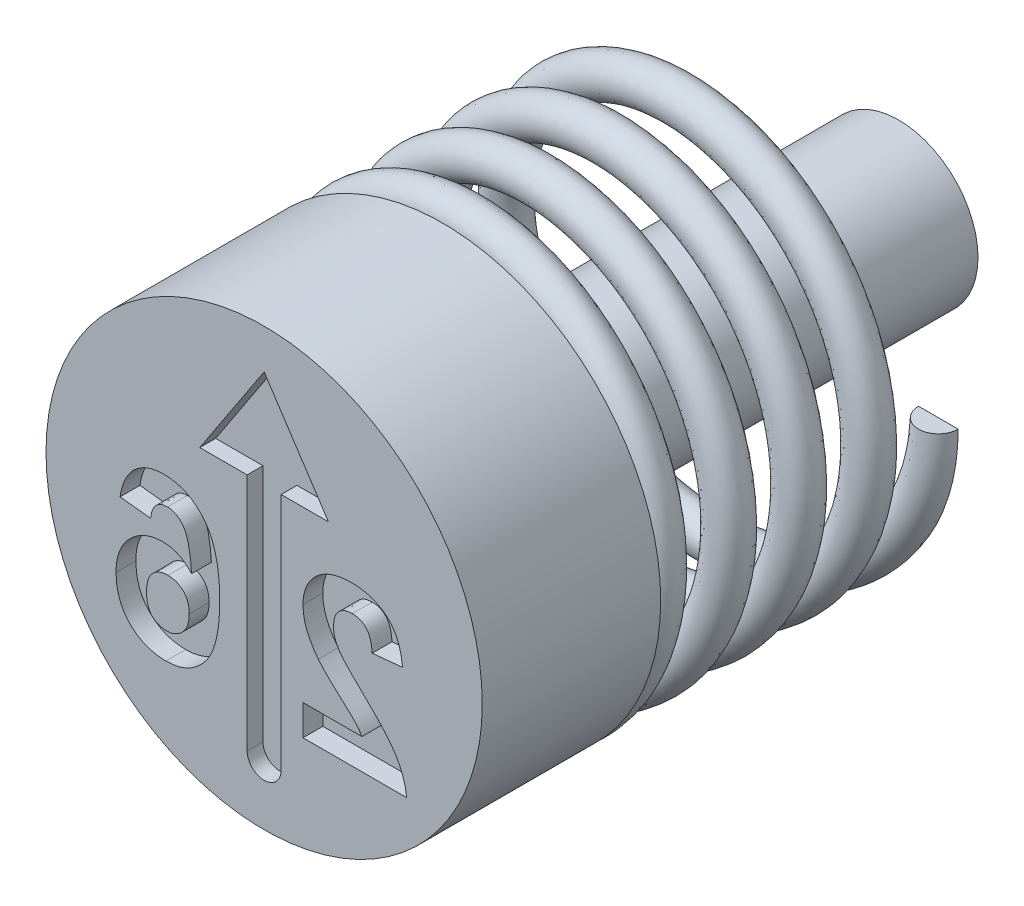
ISO-10303-21;
HEADER;
FILE_DESCRIPTION(('STEP AP214'),'2;1');
FILE_NAME('part.step','',(''),(''),'','','');
FILE_SCHEMA(('AUTOMOTIVE_DESIGN { 1 0 10303 214 1 1 1 1 }'));
ENDSEC;
DATA;
#1=APPLICATION_CONTEXT('core data for automotive mechanical design processes');
#2=APPLICATION_PROTOCOL_DEFINITION('international standard','automotive_design',2000,#1);
#3=PRODUCT_CONTEXT('',#1,'mechanical');
#4=PRODUCT('Part','Part','',(#3));
#5=PRODUCT_RELATED_PRODUCT_CATEGORY('part','',(#4));
#6=PRODUCT_DEFINITION_FORMATION('','',#4);
#7=PRODUCT_DEFINITION_CONTEXT('part definition',#1,'design');
#8=PRODUCT_DEFINITION('design','',#6,#7);
#9=PRODUCT_DEFINITION_SHAPE('','',#8);
#10=(LENGTH_UNIT() NAMED_UNIT(*) SI_UNIT(.MILLI.,.METRE.));
#11=(NAMED_UNIT(*) PLANE_ANGLE_UNIT() SI_UNIT($,.RADIAN.));
#12=(NAMED_UNIT(*) SI_UNIT($,.STERADIAN.) SOLID_ANGLE_UNIT());
#13=UNCERTAINTY_MEASURE_WITH_UNIT(LENGTH_MEASURE(1.E-05),#10,'distance_accuracy_value','');
#14=(GEOMETRIC_REPRESENTATION_CONTEXT(3) GLOBAL_UNCERTAINTY_ASSIGNED_CONTEXT((#13)) GLOBAL_UNIT_ASSIGNED_CONTEXT((#10,
#11,#12)) REPRESENTATION_CONTEXT('',''));
#15=CARTESIAN_POINT('',(0.,0.,0.));
#16=DIRECTION('',(0.,0.,1.));
#17=DIRECTION('',(1.,0.,0.));
#18=AXIS2_PLACEMENT_3D('',#15,#16,#17);
#19=CARTESIAN_POINT('',(5.,0.,-12.5));
#20=DIRECTION('',(0.,-1.,0.));
#21=DIRECTION('',(0.,0.,-1.));
#22=AXIS2_PLACEMENT_3D('',#19,#20,#21);
#23=PLANE('',#22);
#24=CARTESIAN_POINT('',(5.,0.,-12.));
#25=DIRECTION('',(0.,1.,0.));
#26=DIRECTION('',(0.,0.,1.));
#27=AXIS2_PLACEMENT_3D('',#24,#25,#26);
#28=CIRCLE('',#27,0.500000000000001);
#29=CARTESIAN_POINT('',(4.5,0.,-12.));
#30=VERTEX_POINT('',#29);
#31=CARTESIAN_POINT('',(5.5,0.,-12.));
#32=VERTEX_POINT('',#31);
#33=EDGE_CURVE('E92',#30,#32,#28,.T.);
#34=ORIENTED_EDGE('',*,*,#33,.T.);
#35=DIRECTION('',(-1.,0.,0.));
#36=VECTOR('',#35,1.);
#37=CARTESIAN_POINT('',(5.,0.,-12.));
#38=LINE('',#37,#36);
#39=EDGE_CURVE('E79',#32,#30,#38,.T.);
#40=ORIENTED_EDGE('',*,*,#39,.T.);
#41=EDGE_LOOP('',(#34,#40));
#42=FACE_BOUND('',#41,.T.);
#43=ADVANCED_FACE('F53',(#42),#23,.F.);
#44=CARTESIAN_POINT('',(-4.21831895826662E-13,-5.,-4.99999999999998));
#45=DIRECTION('',(-1.,0.,0.));
#46=DIRECTION('',(0.,-1.,0.));
#47=AXIS2_PLACEMENT_3D('',#44,#45,#46);
#48=PLANE('',#47);
#49=DIRECTION('',(0.,-1.,0.));
#50=VECTOR('',#49,1.);
#51=CARTESIAN_POINT('',(-4.21831895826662E-13,-5.,-4.5));
#52=LINE('',#51,#50);
#53=CARTESIAN_POINT('',(-3.79682048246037E-13,-4.5,-4.5));
#54=VERTEX_POINT('',#53);
#55=CARTESIAN_POINT('',(-4.63981743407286E-13,-5.5,-4.5));
#56=VERTEX_POINT('',#55);
#57=EDGE_CURVE('E73',#54,#56,#52,.T.);
#58=ORIENTED_EDGE('',*,*,#57,.F.);
#59=CARTESIAN_POINT('',(-4.21831895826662E-13,-5.,-4.49999999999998));
#60=DIRECTION('',(-1.,0.,0.));
#61=DIRECTION('',(0.,-1.,0.));
#62=AXIS2_PLACEMENT_3D('',#59,#60,#61);
#63=CIRCLE('',#62,0.500000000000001);
#64=EDGE_CURVE('E89',#54,#56,#63,.T.);
#65=ORIENTED_EDGE('',*,*,#64,.T.);
#66=EDGE_LOOP('',(#58,#65));
#67=FACE_BOUND('',#66,.T.);
#68=ADVANCED_FACE('F55',(#67),#48,.T.);
#69=CARTESIAN_POINT('',(5.,0.,-11.5));
#70=CARTESIAN_POINT('',(5.,-1.62459848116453,-11.4117647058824));
#71=CARTESIAN_POINT('',(4.04508497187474,-2.93892626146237,-11.3235294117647));
#72=CARTESIAN_POINT('',(3.09016994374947,-4.2532540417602,-11.2352941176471));
#73=CARTESIAN_POINT('',(1.54508497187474,-4.75528258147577,-11.1470588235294));
#74=CARTESIAN_POINT('',(0.,-5.25731112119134,-11.0588235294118));
#75=CARTESIAN_POINT('',(-1.54508497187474,-4.75528258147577,-10.9705882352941));
#76=CARTESIAN_POINT('',(-3.09016994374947,-4.2532540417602,-10.8823529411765));
#77=CARTESIAN_POINT('',(-4.04508497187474,-2.93892626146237,-10.7941176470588));
#78=CARTESIAN_POINT('',(-5.,-1.62459848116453,-10.7058823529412));
#79=CARTESIAN_POINT('',(-5.,0.,-10.6176470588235));
#80=CARTESIAN_POINT('',(-5.,1.62459848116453,-10.5294117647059));
#81=CARTESIAN_POINT('',(-4.04508497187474,2.93892626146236,-10.4411764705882));
#82=CARTESIAN_POINT('',(-3.09016994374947,4.2532540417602,-10.3529411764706));
#83=CARTESIAN_POINT('',(-1.54508497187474,4.75528258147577,-10.2647058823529));
#84=CARTESIAN_POINT('',(0.,5.25731112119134,-10.1764705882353));
#85=CARTESIAN_POINT('',(1.54508497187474,4.75528258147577,-10.0882352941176));
#86=CARTESIAN_POINT('',(3.09016994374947,4.2532540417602,-10.));
#87=CARTESIAN_POINT('',(4.04508497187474,2.93892626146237,-9.91176470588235));
#88=CARTESIAN_POINT('',(5.,1.62459848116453,-9.8235294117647));
#89=CARTESIAN_POINT('',(5.,0.,-9.73529411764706));
#90=CARTESIAN_POINT('',(5.,-1.62459848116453,-9.64705882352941));
#91=CARTESIAN_POINT('',(4.04508497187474,-2.93892626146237,-9.55882352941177));
#92=CARTESIAN_POINT('',(3.09016994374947,-4.2532540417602,-9.47058823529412));
#93=CARTESIAN_POINT('',(1.54508497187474,-4.75528258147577,-9.38235294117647));
#94=CARTESIAN_POINT('',(0.,-5.25731112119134,-9.29411764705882));
#95=CARTESIAN_POINT('',(-1.54508497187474,-4.75528258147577,-9.20588235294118));
#96=CARTESIAN_POINT('',(-3.09016994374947,-4.2532540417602,-9.11764705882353));
#97=CARTESIAN_POINT('',(-4.04508497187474,-2.93892626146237,-9.02941176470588));
#98=CARTESIAN_POINT('',(-5.,-1.62459848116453,-8.94117647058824));
#99=CARTESIAN_POINT('',(-5.,0.,-8.85294117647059));
#100=CARTESIAN_POINT('',(-5.,1.62459848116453,-8.76470588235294));
#101=CARTESIAN_POINT('',(-4.04508497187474,2.93892626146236,-8.67647058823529));
#102=CARTESIAN_POINT('',(-3.09016994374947,4.2532540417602,-8.58823529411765));
#103=CARTESIAN_POINT('',(-1.54508497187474,4.75528258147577,-8.5));
#104=CARTESIAN_POINT('',(0.,5.25731112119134,-8.41176470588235));
#105=CARTESIAN_POINT('',(1.54508497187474,4.75528258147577,-8.3235294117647));
#106=CARTESIAN_POINT('',(3.09016994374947,4.2532540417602,-8.23529411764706));
#107=CARTESIAN_POINT('',(4.04508497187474,2.93892626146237,-8.14705882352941));
#108=CARTESIAN_POINT('',(5.,1.62459848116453,-8.05882352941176));
#109=CARTESIAN_POINT('',(5.,0.,-7.97058823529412));
#110=CARTESIAN_POINT('',(5.,-1.62459848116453,-7.88235294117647));
#111=CARTESIAN_POINT('',(4.04508497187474,-2.93892626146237,-7.79411764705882));
#112=CARTESIAN_POINT('',(3.09016994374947,-4.2532540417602,-7.70588235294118));
#113=CARTESIAN_POINT('',(1.54508497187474,-4.75528258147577,-7.61764705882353));
#114=CARTESIAN_POINT('',(0.,-5.25731112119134,-7.52941176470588));
#115=CARTESIAN_POINT('',(-1.54508497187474,-4.75528258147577,-7.44117647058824));
#116=CARTESIAN_POINT('',(-3.09016994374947,-4.2532540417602,-7.35294117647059));
#117=CARTESIAN_POINT('',(-4.04508497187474,-2.93892626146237,-7.26470588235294));
#118=CARTESIAN_POINT('',(-5.,-1.62459848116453,-7.17647058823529));
#119=CARTESIAN_POINT('',(-5.,0.,-7.08823529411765));
#120=CARTESIAN_POINT('',(-5.,1.62459848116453,-7.));
#121=CARTESIAN_POINT('',(-4.04508497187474,2.93892626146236,-6.91176470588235));
#122=CARTESIAN_POINT('',(-3.09016994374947,4.2532540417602,-6.82352941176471));
#123=CARTESIAN_POINT('',(-1.54508497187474,4.75528258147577,-6.73529411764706));
#124=CARTESIAN_POINT('',(0.,5.25731112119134,-6.64705882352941));
#125=CARTESIAN_POINT('',(1.54508497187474,4.75528258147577,-6.55882352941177));
#126=CARTESIAN_POINT('',(3.09016994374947,4.2532540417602,-6.47058823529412));
#127=CARTESIAN_POINT('',(4.04508497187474,2.93892626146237,-6.38235294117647));
#128=CARTESIAN_POINT('',(5.,1.62459848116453,-6.29411764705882));
#129=CARTESIAN_POINT('',(5.,0.,-6.20588235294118));
#130=CARTESIAN_POINT('',(5.,-1.62459848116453,-6.11764705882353));
#131=CARTESIAN_POINT('',(4.04508497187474,-2.93892626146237,-6.02941176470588));
#132=CARTESIAN_POINT('',(3.09016994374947,-4.2532540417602,-5.94117647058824));
#133=CARTESIAN_POINT('',(1.54508497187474,-4.75528258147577,-5.85294117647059));
#134=CARTESIAN_POINT('',(0.,-5.25731112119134,-5.76470588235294));
#135=CARTESIAN_POINT('',(-1.54508497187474,-4.75528258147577,-5.6764705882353));
#136=CARTESIAN_POINT('',(-3.09016994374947,-4.2532540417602,-5.58823529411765));
#137=CARTESIAN_POINT('',(-4.04508497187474,-2.93892626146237,-5.5));
#138=CARTESIAN_POINT('',(-5.,-1.62459848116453,-5.41176470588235));
#139=CARTESIAN_POINT('',(-5.,0.,-5.32352941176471));
#140=CARTESIAN_POINT('',(-5.,1.62459848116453,-5.23529411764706));
#141=CARTESIAN_POINT('',(-4.04508497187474,2.93892626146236,-5.14705882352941));
#142=CARTESIAN_POINT('',(-3.09016994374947,4.2532540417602,-5.05882352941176));
#143=CARTESIAN_POINT('',(-1.54508497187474,4.75528258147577,-4.97058823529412));
#144=CARTESIAN_POINT('',(0.,5.25731112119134,-4.88235294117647));
#145=CARTESIAN_POINT('',(1.54508497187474,4.75528258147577,-4.79411764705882));
#146=CARTESIAN_POINT('',(3.09016994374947,4.2532540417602,-4.70588235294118));
#147=CARTESIAN_POINT('',(4.04508497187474,2.93892626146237,-4.61764705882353));
#148=CARTESIAN_POINT('',(5.,1.62459848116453,-4.52941176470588));
#149=CARTESIAN_POINT('',(5.,0.,-4.44117647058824));
#150=CARTESIAN_POINT('',(5.,-1.62459848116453,-4.35294117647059));
#151=CARTESIAN_POINT('',(4.04508497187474,-2.93892626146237,-4.26470588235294));
#152=CARTESIAN_POINT('',(3.09016994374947,-4.2532540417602,-4.1764705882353));
#153=CARTESIAN_POINT('',(1.54508497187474,-4.75528258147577,-4.08823529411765));
#154=CARTESIAN_POINT('',(0.791922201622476,-5.00000000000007,-4.04522436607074));
#155=CARTESIAN_POINT('',(-4.21831895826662E-13,-5.,-3.99999999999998));
#156=CARTESIAN_POINT('',(6.,0.,-11.5));
#157=CARTESIAN_POINT('',(6.,-1.94951817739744,-11.4117647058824));
#158=CARTESIAN_POINT('',(4.85410196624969,-3.52671151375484,-11.3235294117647));
#159=CARTESIAN_POINT('',(3.70820393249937,-5.10390485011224,-11.2352941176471));
#160=CARTESIAN_POINT('',(1.85410196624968,-5.70633909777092,-11.1470588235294));
#161=CARTESIAN_POINT('',(0.,-6.3087733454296,-11.0588235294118));
#162=CARTESIAN_POINT('',(-1.85410196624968,-5.70633909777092,-10.9705882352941));
#163=CARTESIAN_POINT('',(-3.70820393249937,-5.10390485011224,-10.8823529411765));
#164=CARTESIAN_POINT('',(-4.85410196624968,-3.52671151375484,-10.7941176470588));
#165=CARTESIAN_POINT('',(-6.,-1.94951817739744,-10.7058823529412));
#166=CARTESIAN_POINT('',(-6.,0.,-10.6176470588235));
#167=CARTESIAN_POINT('',(-6.,1.94951817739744,-10.5294117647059));
#168=CARTESIAN_POINT('',(-4.85410196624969,3.52671151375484,-10.4411764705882));
#169=CARTESIAN_POINT('',(-3.70820393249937,5.10390485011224,-10.3529411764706));
#170=CARTESIAN_POINT('',(-1.85410196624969,5.70633909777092,-10.2647058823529));
#171=CARTESIAN_POINT('',(0.,6.3087733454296,-10.1764705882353));
#172=CARTESIAN_POINT('',(1.85410196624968,5.70633909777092,-10.0882352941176));
#173=CARTESIAN_POINT('',(3.70820393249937,5.10390485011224,-10.));
#174=CARTESIAN_POINT('',(4.85410196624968,3.52671151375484,-9.91176470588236));
#175=CARTESIAN_POINT('',(6.,1.94951817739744,-9.82352941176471));
#176=CARTESIAN_POINT('',(6.,0.,-9.73529411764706));
#177=CARTESIAN_POINT('',(6.,-1.94951817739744,-9.64705882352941));
#178=CARTESIAN_POINT('',(4.85410196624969,-3.52671151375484,-9.55882352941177));
#179=CARTESIAN_POINT('',(3.70820393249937,-5.10390485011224,-9.47058823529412));
#180=CARTESIAN_POINT('',(1.85410196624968,-5.70633909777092,-9.38235294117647));
#181=CARTESIAN_POINT('',(0.,-6.3087733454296,-9.29411764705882));
#182=CARTESIAN_POINT('',(-1.85410196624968,-5.70633909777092,-9.20588235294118));
#183=CARTESIAN_POINT('',(-3.70820393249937,-5.10390485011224,-9.11764705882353));
#184=CARTESIAN_POINT('',(-4.85410196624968,-3.52671151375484,-9.02941176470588));
#185=CARTESIAN_POINT('',(-6.,-1.94951817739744,-8.94117647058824));
#186=CARTESIAN_POINT('',(-6.,0.,-8.85294117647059));
#187=CARTESIAN_POINT('',(-6.,1.94951817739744,-8.76470588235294));
#188=CARTESIAN_POINT('',(-4.85410196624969,3.52671151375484,-8.6764705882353));
#189=CARTESIAN_POINT('',(-3.70820393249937,5.10390485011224,-8.58823529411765));
#190=CARTESIAN_POINT('',(-1.85410196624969,5.70633909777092,-8.5));
#191=CARTESIAN_POINT('',(0.,6.3087733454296,-8.41176470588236));
#192=CARTESIAN_POINT('',(1.85410196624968,5.70633909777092,-8.32352941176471));
#193=CARTESIAN_POINT('',(3.70820393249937,5.10390485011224,-8.23529411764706));
#194=CARTESIAN_POINT('',(4.85410196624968,3.52671151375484,-8.14705882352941));
#195=CARTESIAN_POINT('',(6.,1.94951817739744,-8.05882352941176));
#196=CARTESIAN_POINT('',(6.,0.,-7.97058823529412));
#197=CARTESIAN_POINT('',(6.,-1.94951817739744,-7.88235294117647));
#198=CARTESIAN_POINT('',(4.85410196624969,-3.52671151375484,-7.79411764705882));
#199=CARTESIAN_POINT('',(3.70820393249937,-5.10390485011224,-7.70588235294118));
#200=CARTESIAN_POINT('',(1.85410196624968,-5.70633909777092,-7.61764705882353));
#201=CARTESIAN_POINT('',(0.,-6.3087733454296,-7.52941176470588));
#202=CARTESIAN_POINT('',(-1.85410196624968,-5.70633909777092,-7.44117647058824));
#203=CARTESIAN_POINT('',(-3.70820393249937,-5.10390485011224,-7.35294117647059));
#204=CARTESIAN_POINT('',(-4.85410196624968,-3.52671151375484,-7.26470588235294));
#205=CARTESIAN_POINT('',(-6.,-1.94951817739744,-7.1764705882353));
#206=CARTESIAN_POINT('',(-6.,0.,-7.08823529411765));
#207=CARTESIAN_POINT('',(-6.,1.94951817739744,-7.));
#208=CARTESIAN_POINT('',(-4.85410196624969,3.52671151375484,-6.91176470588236));
#209=CARTESIAN_POINT('',(-3.70820393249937,5.10390485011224,-6.82352941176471));
#210=CARTESIAN_POINT('',(-1.85410196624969,5.70633909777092,-6.73529411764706));
#211=CARTESIAN_POINT('',(0.,6.3087733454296,-6.64705882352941));
#212=CARTESIAN_POINT('',(1.85410196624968,5.70633909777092,-6.55882352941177));
#213=CARTESIAN_POINT('',(3.70820393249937,5.10390485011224,-6.47058823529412));
#214=CARTESIAN_POINT('',(4.85410196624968,3.52671151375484,-6.38235294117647));
#215=CARTESIAN_POINT('',(6.,1.94951817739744,-6.29411764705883));
#216=CARTESIAN_POINT('',(6.,0.,-6.20588235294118));
#217=CARTESIAN_POINT('',(6.,-1.94951817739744,-6.11764705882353));
#218=CARTESIAN_POINT('',(4.85410196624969,-3.52671151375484,-6.02941176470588));
#219=CARTESIAN_POINT('',(3.70820393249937,-5.10390485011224,-5.94117647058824));
#220=CARTESIAN_POINT('',(1.85410196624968,-5.70633909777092,-5.85294117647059));
#221=CARTESIAN_POINT('',(0.,-6.3087733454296,-5.76470588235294));
#222=CARTESIAN_POINT('',(-1.85410196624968,-5.70633909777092,-5.6764705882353));
#223=CARTESIAN_POINT('',(-3.70820393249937,-5.10390485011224,-5.58823529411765));
#224=CARTESIAN_POINT('',(-4.85410196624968,-3.52671151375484,-5.5));
#225=CARTESIAN_POINT('',(-6.,-1.94951817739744,-5.41176470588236));
#226=CARTESIAN_POINT('',(-6.,0.,-5.32352941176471));
#227=CARTESIAN_POINT('',(-6.,1.94951817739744,-5.23529411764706));
#228=CARTESIAN_POINT('',(-4.85410196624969,3.52671151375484,-5.14705882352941));
#229=CARTESIAN_POINT('',(-3.70820393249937,5.10390485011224,-5.05882352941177));
#230=CARTESIAN_POINT('',(-1.85410196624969,5.70633909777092,-4.97058823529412));
#231=CARTESIAN_POINT('',(0.,6.3087733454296,-4.88235294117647));
#232=CARTESIAN_POINT('',(1.85410196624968,5.70633909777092,-4.79411764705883));
#233=CARTESIAN_POINT('',(3.70820393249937,5.10390485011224,-4.70588235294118));
#234=CARTESIAN_POINT('',(4.85410196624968,3.52671151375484,-4.61764705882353));
#235=CARTESIAN_POINT('',(6.,1.94951817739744,-4.52941176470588));
#236=CARTESIAN_POINT('',(6.,0.,-4.44117647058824));
#237=CARTESIAN_POINT('',(6.,-1.94951817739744,-4.35294117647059));
#238=CARTESIAN_POINT('',(4.85410196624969,-3.52671151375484,-4.26470588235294));
#239=CARTESIAN_POINT('',(3.70820393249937,-5.10390485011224,-4.1764705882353));
#240=CARTESIAN_POINT('',(1.85410196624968,-5.70633909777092,-4.08823529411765));
#241=CARTESIAN_POINT('',(0.950306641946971,-6.00000000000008,-4.04522436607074));
#242=CARTESIAN_POINT('',(-5.06131590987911E-13,-6.,-3.99999999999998));
#243=CARTESIAN_POINT('',(6.,0.,-12.5));
#244=CARTESIAN_POINT('',(6.,-1.94951817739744,-12.4117647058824));
#245=CARTESIAN_POINT('',(4.85410196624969,-3.52671151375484,-12.3235294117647));
#246=CARTESIAN_POINT('',(3.70820393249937,-5.10390485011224,-12.2352941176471));
#247=CARTESIAN_POINT('',(1.85410196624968,-5.70633909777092,-12.1470588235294));
#248=CARTESIAN_POINT('',(0.,-6.3087733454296,-12.0588235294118));
#249=CARTESIAN_POINT('',(-1.85410196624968,-5.70633909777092,-11.9705882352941));
#250=CARTESIAN_POINT('',(-3.70820393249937,-5.10390485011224,-11.8823529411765));
#251=CARTESIAN_POINT('',(-4.85410196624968,-3.52671151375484,-11.7941176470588));
#252=CARTESIAN_POINT('',(-6.,-1.94951817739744,-11.7058823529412));
#253=CARTESIAN_POINT('',(-6.,0.,-11.6176470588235));
#254=CARTESIAN_POINT('',(-6.,1.94951817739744,-11.5294117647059));
#255=CARTESIAN_POINT('',(-4.85410196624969,3.52671151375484,-11.4411764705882));
#256=CARTESIAN_POINT('',(-3.70820393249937,5.10390485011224,-11.3529411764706));
#257=CARTESIAN_POINT('',(-1.85410196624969,5.70633909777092,-11.2647058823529));
#258=CARTESIAN_POINT('',(0.,6.3087733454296,-11.1764705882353));
#259=CARTESIAN_POINT('',(1.85410196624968,5.70633909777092,-11.0882352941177));
#260=CARTESIAN_POINT('',(3.70820393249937,5.10390485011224,-11.));
#261=CARTESIAN_POINT('',(4.85410196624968,3.52671151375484,-10.9117647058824));
#262=CARTESIAN_POINT('',(6.,1.94951817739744,-10.8235294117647));
#263=CARTESIAN_POINT('',(6.,0.,-10.7352941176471));
#264=CARTESIAN_POINT('',(6.,-1.94951817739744,-10.6470588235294));
#265=CARTESIAN_POINT('',(4.85410196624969,-3.52671151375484,-10.5588235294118));
#266=CARTESIAN_POINT('',(3.70820393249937,-5.10390485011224,-10.4705882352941));
#267=CARTESIAN_POINT('',(1.85410196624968,-5.70633909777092,-10.3823529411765));
#268=CARTESIAN_POINT('',(0.,-6.3087733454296,-10.2941176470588));
#269=CARTESIAN_POINT('',(-1.85410196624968,-5.70633909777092,-10.2058823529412));
#270=CARTESIAN_POINT('',(-3.70820393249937,-5.10390485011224,-10.1176470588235));
#271=CARTESIAN_POINT('',(-4.85410196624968,-3.52671151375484,-10.0294117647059));
#272=CARTESIAN_POINT('',(-6.,-1.94951817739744,-9.94117647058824));
#273=CARTESIAN_POINT('',(-6.,0.,-9.85294117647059));
#274=CARTESIAN_POINT('',(-6.,1.94951817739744,-9.76470588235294));
#275=CARTESIAN_POINT('',(-4.85410196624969,3.52671151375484,-9.6764705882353));
#276=CARTESIAN_POINT('',(-3.70820393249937,5.10390485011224,-9.58823529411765));
#277=CARTESIAN_POINT('',(-1.85410196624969,5.70633909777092,-9.5));
#278=CARTESIAN_POINT('',(0.,6.3087733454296,-9.41176470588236));
#279=CARTESIAN_POINT('',(1.85410196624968,5.70633909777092,-9.32352941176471));
#280=CARTESIAN_POINT('',(3.70820393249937,5.10390485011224,-9.23529411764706));
#281=CARTESIAN_POINT('',(4.85410196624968,3.52671151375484,-9.14705882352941));
#282=CARTESIAN_POINT('',(6.,1.94951817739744,-9.05882352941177));
#283=CARTESIAN_POINT('',(6.,0.,-8.97058823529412));
#284=CARTESIAN_POINT('',(6.,-1.94951817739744,-8.88235294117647));
#285=CARTESIAN_POINT('',(4.85410196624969,-3.52671151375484,-8.79411764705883));
#286=CARTESIAN_POINT('',(3.70820393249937,-5.10390485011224,-8.70588235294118));
#287=CARTESIAN_POINT('',(1.85410196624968,-5.70633909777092,-8.61764705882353));
#288=CARTESIAN_POINT('',(0.,-6.3087733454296,-8.52941176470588));
#289=CARTESIAN_POINT('',(-1.85410196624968,-5.70633909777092,-8.44117647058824));
#290=CARTESIAN_POINT('',(-3.70820393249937,-5.10390485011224,-8.35294117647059));
#291=CARTESIAN_POINT('',(-4.85410196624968,-3.52671151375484,-8.26470588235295));
#292=CARTESIAN_POINT('',(-6.,-1.94951817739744,-8.1764705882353));
#293=CARTESIAN_POINT('',(-6.,0.,-8.08823529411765));
#294=CARTESIAN_POINT('',(-6.,1.94951817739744,-8.));
#295=CARTESIAN_POINT('',(-4.85410196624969,3.52671151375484,-7.91176470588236));
#296=CARTESIAN_POINT('',(-3.70820393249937,5.10390485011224,-7.82352941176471));
#297=CARTESIAN_POINT('',(-1.85410196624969,5.70633909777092,-7.73529411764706));
#298=CARTESIAN_POINT('',(0.,6.3087733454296,-7.64705882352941));
#299=CARTESIAN_POINT('',(1.85410196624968,5.70633909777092,-7.55882352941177));
#300=CARTESIAN_POINT('',(3.70820393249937,5.10390485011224,-7.47058823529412));
#301=CARTESIAN_POINT('',(4.85410196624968,3.52671151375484,-7.38235294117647));
#302=CARTESIAN_POINT('',(6.,1.94951817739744,-7.29411764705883));
#303=CARTESIAN_POINT('',(6.,0.,-7.20588235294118));
#304=CARTESIAN_POINT('',(6.,-1.94951817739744,-7.11764705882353));
#305=CARTESIAN_POINT('',(4.85410196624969,-3.52671151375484,-7.02941176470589));
#306=CARTESIAN_POINT('',(3.70820393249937,-5.10390485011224,-6.94117647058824));
#307=CARTESIAN_POINT('',(1.85410196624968,-5.70633909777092,-6.85294117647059));
#308=CARTESIAN_POINT('',(0.,-6.3087733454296,-6.76470588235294));
#309=CARTESIAN_POINT('',(-1.85410196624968,-5.70633909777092,-6.6764705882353));
#310=CARTESIAN_POINT('',(-3.70820393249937,-5.10390485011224,-6.58823529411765));
#311=CARTESIAN_POINT('',(-4.85410196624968,-3.52671151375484,-6.5));
#312=CARTESIAN_POINT('',(-6.,-1.94951817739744,-6.41176470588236));
#313=CARTESIAN_POINT('',(-6.,0.,-6.32352941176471));
#314=CARTESIAN_POINT('',(-6.,1.94951817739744,-6.23529411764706));
#315=CARTESIAN_POINT('',(-4.85410196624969,3.52671151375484,-6.14705882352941));
#316=CARTESIAN_POINT('',(-3.70820393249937,5.10390485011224,-6.05882352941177));
#317=CARTESIAN_POINT('',(-1.85410196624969,5.70633909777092,-5.97058823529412));
#318=CARTESIAN_POINT('',(0.,6.3087733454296,-5.88235294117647));
#319=CARTESIAN_POINT('',(1.85410196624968,5.70633909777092,-5.79411764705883));
#320=CARTESIAN_POINT('',(3.70820393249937,5.10390485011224,-5.70588235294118));
#321=CARTESIAN_POINT('',(4.85410196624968,3.52671151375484,-5.61764705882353));
#322=CARTESIAN_POINT('',(6.,1.94951817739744,-5.52941176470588));
#323=CARTESIAN_POINT('',(6.,0.,-5.44117647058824));
#324=CARTESIAN_POINT('',(6.,-1.94951817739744,-5.35294117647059));
#325=CARTESIAN_POINT('',(4.85410196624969,-3.52671151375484,-5.26470588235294));
#326=CARTESIAN_POINT('',(3.70820393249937,-5.10390485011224,-5.1764705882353));
#327=CARTESIAN_POINT('',(1.85410196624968,-5.70633909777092,-5.08823529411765));
#328=CARTESIAN_POINT('',(0.950306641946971,-6.00000000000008,-5.04522436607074));
#329=CARTESIAN_POINT('',(-5.06131590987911E-13,-6.,-4.99999999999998));
#330=CARTESIAN_POINT('',(5.,0.,-12.5));
#331=CARTESIAN_POINT('',(5.,-1.62459848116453,-12.4117647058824));
#332=CARTESIAN_POINT('',(4.04508497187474,-2.93892626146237,-12.3235294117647));
#333=CARTESIAN_POINT('',(3.09016994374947,-4.2532540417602,-12.2352941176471));
#334=CARTESIAN_POINT('',(1.54508497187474,-4.75528258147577,-12.1470588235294));
#335=CARTESIAN_POINT('',(0.,-5.25731112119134,-12.0588235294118));
#336=CARTESIAN_POINT('',(-1.54508497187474,-4.75528258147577,-11.9705882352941));
#337=CARTESIAN_POINT('',(-3.09016994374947,-4.2532540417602,-11.8823529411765));
#338=CARTESIAN_POINT('',(-4.04508497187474,-2.93892626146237,-11.7941176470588));
#339=CARTESIAN_POINT('',(-5.,-1.62459848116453,-11.7058823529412));
#340=CARTESIAN_POINT('',(-5.,0.,-11.6176470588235));
#341=CARTESIAN_POINT('',(-5.,1.62459848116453,-11.5294117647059));
#342=CARTESIAN_POINT('',(-4.04508497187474,2.93892626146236,-11.4411764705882));
#343=CARTESIAN_POINT('',(-3.09016994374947,4.2532540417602,-11.3529411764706));
#344=CARTESIAN_POINT('',(-1.54508497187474,4.75528258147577,-11.2647058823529));
#345=CARTESIAN_POINT('',(0.,5.25731112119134,-11.1764705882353));
#346=CARTESIAN_POINT('',(1.54508497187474,4.75528258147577,-11.0882352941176));
#347=CARTESIAN_POINT('',(3.09016994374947,4.2532540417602,-11.));
#348=CARTESIAN_POINT('',(4.04508497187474,2.93892626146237,-10.9117647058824));
#349=CARTESIAN_POINT('',(5.,1.62459848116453,-10.8235294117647));
#350=CARTESIAN_POINT('',(5.,0.,-10.7352941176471));
#351=CARTESIAN_POINT('',(5.,-1.62459848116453,-10.6470588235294));
#352=CARTESIAN_POINT('',(4.04508497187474,-2.93892626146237,-10.5588235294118));
#353=CARTESIAN_POINT('',(3.09016994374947,-4.2532540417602,-10.4705882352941));
#354=CARTESIAN_POINT('',(1.54508497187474,-4.75528258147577,-10.3823529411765));
#355=CARTESIAN_POINT('',(0.,-5.25731112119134,-10.2941176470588));
#356=CARTESIAN_POINT('',(-1.54508497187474,-4.75528258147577,-10.2058823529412));
#357=CARTESIAN_POINT('',(-3.09016994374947,-4.2532540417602,-10.1176470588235));
#358=CARTESIAN_POINT('',(-4.04508497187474,-2.93892626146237,-10.0294117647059));
#359=CARTESIAN_POINT('',(-5.,-1.62459848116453,-9.94117647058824));
#360=CARTESIAN_POINT('',(-5.,0.,-9.85294117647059));
#361=CARTESIAN_POINT('',(-5.,1.62459848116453,-9.76470588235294));
#362=CARTESIAN_POINT('',(-4.04508497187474,2.93892626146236,-9.6764705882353));
#363=CARTESIAN_POINT('',(-3.09016994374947,4.2532540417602,-9.58823529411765));
#364=CARTESIAN_POINT('',(-1.54508497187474,4.75528258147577,-9.5));
#365=CARTESIAN_POINT('',(0.,5.25731112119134,-9.41176470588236));
#366=CARTESIAN_POINT('',(1.54508497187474,4.75528258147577,-9.32352941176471));
#367=CARTESIAN_POINT('',(3.09016994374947,4.2532540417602,-9.23529411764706));
#368=CARTESIAN_POINT('',(4.04508497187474,2.93892626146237,-9.14705882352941));
#369=CARTESIAN_POINT('',(5.,1.62459848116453,-9.05882352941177));
#370=CARTESIAN_POINT('',(5.,0.,-8.97058823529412));
#371=CARTESIAN_POINT('',(5.,-1.62459848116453,-8.88235294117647));
#372=CARTESIAN_POINT('',(4.04508497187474,-2.93892626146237,-8.79411764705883));
#373=CARTESIAN_POINT('',(3.09016994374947,-4.2532540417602,-8.70588235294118));
#374=CARTESIAN_POINT('',(1.54508497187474,-4.75528258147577,-8.61764705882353));
#375=CARTESIAN_POINT('',(0.,-5.25731112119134,-8.52941176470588));
#376=CARTESIAN_POINT('',(-1.54508497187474,-4.75528258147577,-8.44117647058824));
#377=CARTESIAN_POINT('',(-3.09016994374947,-4.2532540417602,-8.35294117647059));
#378=CARTESIAN_POINT('',(-4.04508497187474,-2.93892626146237,-8.26470588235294));
#379=CARTESIAN_POINT('',(-5.,-1.62459848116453,-8.1764705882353));
#380=CARTESIAN_POINT('',(-5.,0.,-8.08823529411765));
#381=CARTESIAN_POINT('',(-5.,1.62459848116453,-8.));
#382=CARTESIAN_POINT('',(-4.04508497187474,2.93892626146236,-7.91176470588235));
#383=CARTESIAN_POINT('',(-3.09016994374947,4.2532540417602,-7.82352941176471));
#384=CARTESIAN_POINT('',(-1.54508497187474,4.75528258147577,-7.73529411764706));
#385=CARTESIAN_POINT('',(0.,5.25731112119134,-7.64705882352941));
#386=CARTESIAN_POINT('',(1.54508497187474,4.75528258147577,-7.55882352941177));
#387=CARTESIAN_POINT('',(3.09016994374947,4.2532540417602,-7.47058823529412));
#388=CARTESIAN_POINT('',(4.04508497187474,2.93892626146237,-7.38235294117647));
#389=CARTESIAN_POINT('',(5.,1.62459848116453,-7.29411764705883));
#390=CARTESIAN_POINT('',(5.,0.,-7.20588235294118));
#391=CARTESIAN_POINT('',(5.,-1.62459848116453,-7.11764705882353));
#392=CARTESIAN_POINT('',(4.04508497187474,-2.93892626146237,-7.02941176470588));
#393=CARTESIAN_POINT('',(3.09016994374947,-4.2532540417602,-6.94117647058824));
#394=CARTESIAN_POINT('',(1.54508497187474,-4.75528258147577,-6.85294117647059));
#395=CARTESIAN_POINT('',(0.,-5.25731112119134,-6.76470588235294));
#396=CARTESIAN_POINT('',(-1.54508497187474,-4.75528258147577,-6.6764705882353));
#397=CARTESIAN_POINT('',(-3.09016994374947,-4.2532540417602,-6.58823529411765));
#398=CARTESIAN_POINT('',(-4.04508497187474,-2.93892626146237,-6.5));
#399=CARTESIAN_POINT('',(-5.,-1.62459848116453,-6.41176470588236));
#400=CARTESIAN_POINT('',(-5.,0.,-6.32352941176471));
#401=CARTESIAN_POINT('',(-5.,1.62459848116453,-6.23529411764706));
#402=CARTESIAN_POINT('',(-4.04508497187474,2.93892626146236,-6.14705882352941));
#403=CARTESIAN_POINT('',(-3.09016994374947,4.2532540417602,-6.05882352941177));
#404=CARTESIAN_POINT('',(-1.54508497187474,4.75528258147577,-5.97058823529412));
#405=CARTESIAN_POINT('',(0.,5.25731112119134,-5.88235294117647));
#406=CARTESIAN_POINT('',(1.54508497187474,4.75528258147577,-5.79411764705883));
#407=CARTESIAN_POINT('',(3.09016994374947,4.2532540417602,-5.70588235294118));
#408=CARTESIAN_POINT('',(4.04508497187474,2.93892626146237,-5.61764705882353));
#409=CARTESIAN_POINT('',(5.,1.62459848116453,-5.52941176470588));
#410=CARTESIAN_POINT('',(5.,0.,-5.44117647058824));
#411=CARTESIAN_POINT('',(5.,-1.62459848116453,-5.35294117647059));
#412=CARTESIAN_POINT('',(4.04508497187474,-2.93892626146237,-5.26470588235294));
#413=CARTESIAN_POINT('',(3.09016994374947,-4.2532540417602,-5.1764705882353));
#414=CARTESIAN_POINT('',(1.54508497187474,-4.75528258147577,-5.08823529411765));
#415=CARTESIAN_POINT('',(0.791922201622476,-5.00000000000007,-5.04522436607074));
#416=CARTESIAN_POINT('',(-4.21831895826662E-13,-5.,-4.99999999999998));
#417=CARTESIAN_POINT('',(4.,0.,-12.5));
#418=CARTESIAN_POINT('',(4.,-1.29967878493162,-12.4117647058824));
#419=CARTESIAN_POINT('',(3.23606797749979,-2.35114100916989,-12.3235294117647));
#420=CARTESIAN_POINT('',(2.47213595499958,-3.40260323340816,-12.2352941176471));
#421=CARTESIAN_POINT('',(1.23606797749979,-3.80422606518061,-12.1470588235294));
#422=CARTESIAN_POINT('',(0.,-4.20584889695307,-12.0588235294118));
#423=CARTESIAN_POINT('',(-1.23606797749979,-3.80422606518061,-11.9705882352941));
#424=CARTESIAN_POINT('',(-2.47213595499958,-3.40260323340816,-11.8823529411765));
#425=CARTESIAN_POINT('',(-3.23606797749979,-2.35114100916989,-11.7941176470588));
#426=CARTESIAN_POINT('',(-4.,-1.29967878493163,-11.7058823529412));
#427=CARTESIAN_POINT('',(-4.,0.,-11.6176470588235));
#428=CARTESIAN_POINT('',(-4.,1.29967878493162,-11.5294117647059));
#429=CARTESIAN_POINT('',(-3.23606797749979,2.35114100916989,-11.4411764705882));
#430=CARTESIAN_POINT('',(-2.47213595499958,3.40260323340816,-11.3529411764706));
#431=CARTESIAN_POINT('',(-1.23606797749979,3.80422606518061,-11.2647058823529));
#432=CARTESIAN_POINT('',(0.,4.20584889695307,-11.1764705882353));
#433=CARTESIAN_POINT('',(1.23606797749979,3.80422606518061,-11.0882352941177));
#434=CARTESIAN_POINT('',(2.47213595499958,3.40260323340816,-11.));
#435=CARTESIAN_POINT('',(3.23606797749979,2.35114100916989,-10.9117647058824));
#436=CARTESIAN_POINT('',(4.,1.29967878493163,-10.8235294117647));
#437=CARTESIAN_POINT('',(4.,0.,-10.7352941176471));
#438=CARTESIAN_POINT('',(4.,-1.29967878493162,-10.6470588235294));
#439=CARTESIAN_POINT('',(3.23606797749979,-2.35114100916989,-10.5588235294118));
#440=CARTESIAN_POINT('',(2.47213595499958,-3.40260323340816,-10.4705882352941));
#441=CARTESIAN_POINT('',(1.23606797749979,-3.80422606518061,-10.3823529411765));
#442=CARTESIAN_POINT('',(0.,-4.20584889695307,-10.2941176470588));
#443=CARTESIAN_POINT('',(-1.23606797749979,-3.80422606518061,-10.2058823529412));
#444=CARTESIAN_POINT('',(-2.47213595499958,-3.40260323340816,-10.1176470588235));
#445=CARTESIAN_POINT('',(-3.23606797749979,-2.35114100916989,-10.0294117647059));
#446=CARTESIAN_POINT('',(-4.,-1.29967878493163,-9.94117647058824));
#447=CARTESIAN_POINT('',(-4.,0.,-9.85294117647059));
#448=CARTESIAN_POINT('',(-4.,1.29967878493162,-9.76470588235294));
#449=CARTESIAN_POINT('',(-3.23606797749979,2.35114100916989,-9.6764705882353));
#450=CARTESIAN_POINT('',(-2.47213595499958,3.40260323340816,-9.58823529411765));
#451=CARTESIAN_POINT('',(-1.23606797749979,3.80422606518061,-9.5));
#452=CARTESIAN_POINT('',(0.,4.20584889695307,-9.41176470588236));
#453=CARTESIAN_POINT('',(1.23606797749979,3.80422606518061,-9.32352941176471));
#454=CARTESIAN_POINT('',(2.47213595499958,3.40260323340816,-9.23529411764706));
#455=CARTESIAN_POINT('',(3.23606797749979,2.35114100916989,-9.14705882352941));
#456=CARTESIAN_POINT('',(4.,1.29967878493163,-9.05882352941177));
#457=CARTESIAN_POINT('',(4.,0.,-8.97058823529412));
#458=CARTESIAN_POINT('',(4.,-1.29967878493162,-8.88235294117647));
#459=CARTESIAN_POINT('',(3.23606797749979,-2.35114100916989,-8.79411764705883));
#460=CARTESIAN_POINT('',(2.47213595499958,-3.40260323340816,-8.70588235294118));
#461=CARTESIAN_POINT('',(1.23606797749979,-3.80422606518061,-8.61764705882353));
#462=CARTESIAN_POINT('',(0.,-4.20584889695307,-8.52941176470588));
#463=CARTESIAN_POINT('',(-1.23606797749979,-3.80422606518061,-8.44117647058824));
#464=CARTESIAN_POINT('',(-2.47213595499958,-3.40260323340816,-8.35294117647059));
#465=CARTESIAN_POINT('',(-3.23606797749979,-2.35114100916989,-8.26470588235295));
#466=CARTESIAN_POINT('',(-4.,-1.29967878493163,-8.1764705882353));
#467=CARTESIAN_POINT('',(-4.,0.,-8.08823529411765));
#468=CARTESIAN_POINT('',(-4.,1.29967878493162,-8.));
#469=CARTESIAN_POINT('',(-3.23606797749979,2.35114100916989,-7.91176470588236));
#470=CARTESIAN_POINT('',(-2.47213595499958,3.40260323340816,-7.82352941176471));
#471=CARTESIAN_POINT('',(-1.23606797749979,3.80422606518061,-7.73529411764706));
#472=CARTESIAN_POINT('',(0.,4.20584889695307,-7.64705882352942));
#473=CARTESIAN_POINT('',(1.23606797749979,3.80422606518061,-7.55882352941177));
#474=CARTESIAN_POINT('',(2.47213595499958,3.40260323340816,-7.47058823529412));
#475=CARTESIAN_POINT('',(3.23606797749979,2.35114100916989,-7.38235294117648));
#476=CARTESIAN_POINT('',(4.,1.29967878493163,-7.29411764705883));
#477=CARTESIAN_POINT('',(4.,0.,-7.20588235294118));
#478=CARTESIAN_POINT('',(4.,-1.29967878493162,-7.11764705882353));
#479=CARTESIAN_POINT('',(3.23606797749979,-2.35114100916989,-7.02941176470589));
#480=CARTESIAN_POINT('',(2.47213595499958,-3.40260323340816,-6.94117647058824));
#481=CARTESIAN_POINT('',(1.23606797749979,-3.80422606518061,-6.85294117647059));
#482=CARTESIAN_POINT('',(0.,-4.20584889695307,-6.76470588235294));
#483=CARTESIAN_POINT('',(-1.23606797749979,-3.80422606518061,-6.6764705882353));
#484=CARTESIAN_POINT('',(-2.47213595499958,-3.40260323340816,-6.58823529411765));
#485=CARTESIAN_POINT('',(-3.23606797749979,-2.35114100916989,-6.5));
#486=CARTESIAN_POINT('',(-4.,-1.29967878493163,-6.41176470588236));
#487=CARTESIAN_POINT('',(-4.,0.,-6.32352941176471));
#488=CARTESIAN_POINT('',(-4.,1.29967878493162,-6.23529411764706));
#489=CARTESIAN_POINT('',(-3.23606797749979,2.35114100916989,-6.14705882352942));
#490=CARTESIAN_POINT('',(-2.47213595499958,3.40260323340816,-6.05882352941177));
#491=CARTESIAN_POINT('',(-1.23606797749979,3.80422606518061,-5.97058823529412));
#492=CARTESIAN_POINT('',(0.,4.20584889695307,-5.88235294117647));
#493=CARTESIAN_POINT('',(1.23606797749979,3.80422606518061,-5.79411764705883));
#494=CARTESIAN_POINT('',(2.47213595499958,3.40260323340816,-5.70588235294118));
#495=CARTESIAN_POINT('',(3.23606797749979,2.35114100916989,-5.61764705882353));
#496=CARTESIAN_POINT('',(4.,1.29967878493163,-5.52941176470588));
#497=CARTESIAN_POINT('',(4.,0.,-5.44117647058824));
#498=CARTESIAN_POINT('',(4.,-1.29967878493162,-5.35294117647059));
#499=CARTESIAN_POINT('',(3.23606797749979,-2.35114100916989,-5.26470588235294));
#500=CARTESIAN_POINT('',(2.47213595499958,-3.40260323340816,-5.1764705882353));
#501=CARTESIAN_POINT('',(1.23606797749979,-3.80422606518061,-5.08823529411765));
#502=CARTESIAN_POINT('',(0.633537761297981,-4.00000000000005,-5.04522436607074));
#503=CARTESIAN_POINT('',(-3.37296028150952E-13,-4.,-4.99999999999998));
#504=CARTESIAN_POINT('',(4.,0.,-11.5));
#505=CARTESIAN_POINT('',(4.,-1.29967878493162,-11.4117647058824));
#506=CARTESIAN_POINT('',(3.23606797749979,-2.35114100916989,-11.3235294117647));
#507=CARTESIAN_POINT('',(2.47213595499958,-3.40260323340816,-11.2352941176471));
#508=CARTESIAN_POINT('',(1.23606797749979,-3.80422606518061,-11.1470588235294));
#509=CARTESIAN_POINT('',(0.,-4.20584889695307,-11.0588235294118));
#510=CARTESIAN_POINT('',(-1.23606797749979,-3.80422606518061,-10.9705882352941));
#511=CARTESIAN_POINT('',(-2.47213595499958,-3.40260323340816,-10.8823529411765));
#512=CARTESIAN_POINT('',(-3.23606797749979,-2.35114100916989,-10.7941176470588));
#513=CARTESIAN_POINT('',(-4.,-1.29967878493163,-10.7058823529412));
#514=CARTESIAN_POINT('',(-4.,0.,-10.6176470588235));
#515=CARTESIAN_POINT('',(-4.,1.29967878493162,-10.5294117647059));
#516=CARTESIAN_POINT('',(-3.23606797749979,2.35114100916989,-10.4411764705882));
#517=CARTESIAN_POINT('',(-2.47213595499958,3.40260323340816,-10.3529411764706));
#518=CARTESIAN_POINT('',(-1.23606797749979,3.80422606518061,-10.2647058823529));
#519=CARTESIAN_POINT('',(0.,4.20584889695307,-10.1764705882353));
#520=CARTESIAN_POINT('',(1.23606797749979,3.80422606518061,-10.0882352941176));
#521=CARTESIAN_POINT('',(2.47213595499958,3.40260323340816,-10.));
#522=CARTESIAN_POINT('',(3.23606797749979,2.35114100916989,-9.91176470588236));
#523=CARTESIAN_POINT('',(4.,1.29967878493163,-9.82352941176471));
#524=CARTESIAN_POINT('',(4.,0.,-9.73529411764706));
#525=CARTESIAN_POINT('',(4.,-1.29967878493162,-9.64705882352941));
#526=CARTESIAN_POINT('',(3.23606797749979,-2.35114100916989,-9.55882352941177));
#527=CARTESIAN_POINT('',(2.47213595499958,-3.40260323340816,-9.47058823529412));
#528=CARTESIAN_POINT('',(1.23606797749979,-3.80422606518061,-9.38235294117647));
#529=CARTESIAN_POINT('',(0.,-4.20584889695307,-9.29411764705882));
#530=CARTESIAN_POINT('',(-1.23606797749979,-3.80422606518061,-9.20588235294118));
#531=CARTESIAN_POINT('',(-2.47213595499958,-3.40260323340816,-9.11764705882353));
#532=CARTESIAN_POINT('',(-3.23606797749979,-2.35114100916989,-9.02941176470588));
#533=CARTESIAN_POINT('',(-4.,-1.29967878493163,-8.94117647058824));
#534=CARTESIAN_POINT('',(-4.,0.,-8.85294117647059));
#535=CARTESIAN_POINT('',(-4.,1.29967878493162,-8.76470588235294));
#536=CARTESIAN_POINT('',(-3.23606797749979,2.35114100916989,-8.6764705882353));
#537=CARTESIAN_POINT('',(-2.47213595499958,3.40260323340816,-8.58823529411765));
#538=CARTESIAN_POINT('',(-1.23606797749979,3.80422606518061,-8.5));
#539=CARTESIAN_POINT('',(0.,4.20584889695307,-8.41176470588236));
#540=CARTESIAN_POINT('',(1.23606797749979,3.80422606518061,-8.32352941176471));
#541=CARTESIAN_POINT('',(2.47213595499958,3.40260323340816,-8.23529411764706));
#542=CARTESIAN_POINT('',(3.23606797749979,2.35114100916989,-8.14705882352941));
#543=CARTESIAN_POINT('',(4.,1.29967878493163,-8.05882352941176));
#544=CARTESIAN_POINT('',(4.,0.,-7.97058823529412));
#545=CARTESIAN_POINT('',(4.,-1.29967878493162,-7.88235294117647));
#546=CARTESIAN_POINT('',(3.23606797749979,-2.35114100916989,-7.79411764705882));
#547=CARTESIAN_POINT('',(2.47213595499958,-3.40260323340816,-7.70588235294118));
#548=CARTESIAN_POINT('',(1.23606797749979,-3.80422606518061,-7.61764705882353));
#549=CARTESIAN_POINT('',(0.,-4.20584889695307,-7.52941176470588));
#550=CARTESIAN_POINT('',(-1.23606797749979,-3.80422606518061,-7.44117647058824));
#551=CARTESIAN_POINT('',(-2.47213595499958,-3.40260323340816,-7.35294117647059));
#552=CARTESIAN_POINT('',(-3.23606797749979,-2.35114100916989,-7.26470588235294));
#553=CARTESIAN_POINT('',(-4.,-1.29967878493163,-7.1764705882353));
#554=CARTESIAN_POINT('',(-4.,0.,-7.08823529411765));
#555=CARTESIAN_POINT('',(-4.,1.29967878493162,-7.));
#556=CARTESIAN_POINT('',(-3.23606797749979,2.35114100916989,-6.91176470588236));
#557=CARTESIAN_POINT('',(-2.47213595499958,3.40260323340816,-6.82352941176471));
#558=CARTESIAN_POINT('',(-1.23606797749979,3.80422606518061,-6.73529411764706));
#559=CARTESIAN_POINT('',(0.,4.20584889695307,-6.64705882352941));
#560=CARTESIAN_POINT('',(1.23606797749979,3.80422606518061,-6.55882352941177));
#561=CARTESIAN_POINT('',(2.47213595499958,3.40260323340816,-6.47058823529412));
#562=CARTESIAN_POINT('',(3.23606797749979,2.35114100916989,-6.38235294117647));
#563=CARTESIAN_POINT('',(4.,1.29967878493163,-6.29411764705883));
#564=CARTESIAN_POINT('',(4.,0.,-6.20588235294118));
#565=CARTESIAN_POINT('',(4.,-1.29967878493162,-6.11764705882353));
#566=CARTESIAN_POINT('',(3.23606797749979,-2.35114100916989,-6.02941176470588));
#567=CARTESIAN_POINT('',(2.47213595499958,-3.40260323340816,-5.94117647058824));
#568=CARTESIAN_POINT('',(1.23606797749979,-3.80422606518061,-5.85294117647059));
#569=CARTESIAN_POINT('',(0.,-4.20584889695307,-5.76470588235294));
#570=CARTESIAN_POINT('',(-1.23606797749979,-3.80422606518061,-5.6764705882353));
#571=CARTESIAN_POINT('',(-2.47213595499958,-3.40260323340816,-5.58823529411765));
#572=CARTESIAN_POINT('',(-3.23606797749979,-2.35114100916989,-5.5));
#573=CARTESIAN_POINT('',(-4.,-1.29967878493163,-5.41176470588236));
#574=CARTESIAN_POINT('',(-4.,0.,-5.32352941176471));
#575=CARTESIAN_POINT('',(-4.,1.29967878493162,-5.23529411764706));
#576=CARTESIAN_POINT('',(-3.23606797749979,2.35114100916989,-5.14705882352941));
#577=CARTESIAN_POINT('',(-2.47213595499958,3.40260323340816,-5.05882352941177));
#578=CARTESIAN_POINT('',(-1.23606797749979,3.80422606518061,-4.97058823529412));
#579=CARTESIAN_POINT('',(0.,4.20584889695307,-4.88235294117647));
#580=CARTESIAN_POINT('',(1.23606797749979,3.80422606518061,-4.79411764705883));
#581=CARTESIAN_POINT('',(2.47213595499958,3.40260323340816,-4.70588235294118));
#582=CARTESIAN_POINT('',(3.23606797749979,2.35114100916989,-4.61764705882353));
#583=CARTESIAN_POINT('',(4.,1.29967878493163,-4.52941176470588));
#584=CARTESIAN_POINT('',(4.,0.,-4.44117647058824));
#585=CARTESIAN_POINT('',(4.,-1.29967878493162,-4.35294117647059));
#586=CARTESIAN_POINT('',(3.23606797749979,-2.35114100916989,-4.26470588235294));
#587=CARTESIAN_POINT('',(2.47213595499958,-3.40260323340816,-4.1764705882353));
#588=CARTESIAN_POINT('',(1.23606797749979,-3.80422606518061,-4.08823529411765));
#589=CARTESIAN_POINT('',(0.633537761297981,-4.00000000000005,-4.04522436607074));
#590=CARTESIAN_POINT('',(-3.37296028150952E-13,-4.,-3.99999999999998));
#591=CARTESIAN_POINT('',(5.,0.,-11.5));
#592=CARTESIAN_POINT('',(5.,-1.62459848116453,-11.4117647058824));
#593=CARTESIAN_POINT('',(4.04508497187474,-2.93892626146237,-11.3235294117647));
#594=CARTESIAN_POINT('',(3.09016994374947,-4.2532540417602,-11.2352941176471));
#595=CARTESIAN_POINT('',(1.54508497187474,-4.75528258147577,-11.1470588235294));
#596=CARTESIAN_POINT('',(0.,-5.25731112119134,-11.0588235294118));
#597=CARTESIAN_POINT('',(-1.54508497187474,-4.75528258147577,-10.9705882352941));
#598=CARTESIAN_POINT('',(-3.09016994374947,-4.2532540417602,-10.8823529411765));
#599=CARTESIAN_POINT('',(-4.04508497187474,-2.93892626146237,-10.7941176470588));
#600=CARTESIAN_POINT('',(-5.,-1.62459848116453,-10.7058823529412));
#601=CARTESIAN_POINT('',(-5.,0.,-10.6176470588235));
#602=CARTESIAN_POINT('',(-5.,1.62459848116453,-10.5294117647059));
#603=CARTESIAN_POINT('',(-4.04508497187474,2.93892626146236,-10.4411764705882));
#604=CARTESIAN_POINT('',(-3.09016994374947,4.2532540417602,-10.3529411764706));
#605=CARTESIAN_POINT('',(-1.54508497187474,4.75528258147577,-10.2647058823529));
#606=CARTESIAN_POINT('',(0.,5.25731112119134,-10.1764705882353));
#607=CARTESIAN_POINT('',(1.54508497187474,4.75528258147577,-10.0882352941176));
#608=CARTESIAN_POINT('',(3.09016994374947,4.2532540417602,-10.));
#609=CARTESIAN_POINT('',(4.04508497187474,2.93892626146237,-9.91176470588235));
#610=CARTESIAN_POINT('',(5.,1.62459848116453,-9.8235294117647));
#611=CARTESIAN_POINT('',(5.,0.,-9.73529411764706));
#612=CARTESIAN_POINT('',(5.,-1.62459848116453,-9.64705882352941));
#613=CARTESIAN_POINT('',(4.04508497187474,-2.93892626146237,-9.55882352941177));
#614=CARTESIAN_POINT('',(3.09016994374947,-4.2532540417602,-9.47058823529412));
#615=CARTESIAN_POINT('',(1.54508497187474,-4.75528258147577,-9.38235294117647));
#616=CARTESIAN_POINT('',(0.,-5.25731112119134,-9.29411764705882));
#617=CARTESIAN_POINT('',(-1.54508497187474,-4.75528258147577,-9.20588235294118));
#618=CARTESIAN_POINT('',(-3.09016994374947,-4.2532540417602,-9.11764705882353));
#619=CARTESIAN_POINT('',(-4.04508497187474,-2.93892626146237,-9.02941176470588));
#620=CARTESIAN_POINT('',(-5.,-1.62459848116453,-8.94117647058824));
#621=CARTESIAN_POINT('',(-5.,0.,-8.85294117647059));
#622=CARTESIAN_POINT('',(-5.,1.62459848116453,-8.76470588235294));
#623=CARTESIAN_POINT('',(-4.04508497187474,2.93892626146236,-8.67647058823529));
#624=CARTESIAN_POINT('',(-3.09016994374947,4.2532540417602,-8.58823529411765));
#625=CARTESIAN_POINT('',(-1.54508497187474,4.75528258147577,-8.5));
#626=CARTESIAN_POINT('',(0.,5.25731112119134,-8.41176470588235));
#627=CARTESIAN_POINT('',(1.54508497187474,4.75528258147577,-8.3235294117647));
#628=CARTESIAN_POINT('',(3.09016994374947,4.2532540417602,-8.23529411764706));
#629=CARTESIAN_POINT('',(4.04508497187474,2.93892626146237,-8.14705882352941));
#630=CARTESIAN_POINT('',(5.,1.62459848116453,-8.05882352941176));
#631=CARTESIAN_POINT('',(5.,0.,-7.97058823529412));
#632=CARTESIAN_POINT('',(5.,-1.62459848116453,-7.88235294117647));
#633=CARTESIAN_POINT('',(4.04508497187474,-2.93892626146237,-7.79411764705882));
#634=CARTESIAN_POINT('',(3.09016994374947,-4.2532540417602,-7.70588235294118));
#635=CARTESIAN_POINT('',(1.54508497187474,-4.75528258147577,-7.61764705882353));
#636=CARTESIAN_POINT('',(0.,-5.25731112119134,-7.52941176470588));
#637=CARTESIAN_POINT('',(-1.54508497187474,-4.75528258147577,-7.44117647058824));
#638=CARTESIAN_POINT('',(-3.09016994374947,-4.2532540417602,-7.35294117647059));
#639=CARTESIAN_POINT('',(-4.04508497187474,-2.93892626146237,-7.26470588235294));
#640=CARTESIAN_POINT('',(-5.,-1.62459848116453,-7.17647058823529));
#641=CARTESIAN_POINT('',(-5.,0.,-7.08823529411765));
#642=CARTESIAN_POINT('',(-5.,1.62459848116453,-7.));
#643=CARTESIAN_POINT('',(-4.04508497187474,2.93892626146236,-6.91176470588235));
#644=CARTESIAN_POINT('',(-3.09016994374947,4.2532540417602,-6.82352941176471));
#645=CARTESIAN_POINT('',(-1.54508497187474,4.75528258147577,-6.73529411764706));
#646=CARTESIAN_POINT('',(0.,5.25731112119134,-6.64705882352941));
#647=CARTESIAN_POINT('',(1.54508497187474,4.75528258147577,-6.55882352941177));
#648=CARTESIAN_POINT('',(3.09016994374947,4.2532540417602,-6.47058823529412));
#649=CARTESIAN_POINT('',(4.04508497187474,2.93892626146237,-6.38235294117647));
#650=CARTESIAN_POINT('',(5.,1.62459848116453,-6.29411764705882));
#651=CARTESIAN_POINT('',(5.,0.,-6.20588235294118));
#652=CARTESIAN_POINT('',(5.,-1.62459848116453,-6.11764705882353));
#653=CARTESIAN_POINT('',(4.04508497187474,-2.93892626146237,-6.02941176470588));
#654=CARTESIAN_POINT('',(3.09016994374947,-4.2532540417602,-5.94117647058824));
#655=CARTESIAN_POINT('',(1.54508497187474,-4.75528258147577,-5.85294117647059));
#656=CARTESIAN_POINT('',(0.,-5.25731112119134,-5.76470588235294));
#657=CARTESIAN_POINT('',(-1.54508497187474,-4.75528258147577,-5.6764705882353));
#658=CARTESIAN_POINT('',(-3.09016994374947,-4.2532540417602,-5.58823529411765));
#659=CARTESIAN_POINT('',(-4.04508497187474,-2.93892626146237,-5.5));
#660=CARTESIAN_POINT('',(-5.,-1.62459848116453,-5.41176470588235));
#661=CARTESIAN_POINT('',(-5.,0.,-5.32352941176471));
#662=CARTESIAN_POINT('',(-5.,1.62459848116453,-5.23529411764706));
#663=CARTESIAN_POINT('',(-4.04508497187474,2.93892626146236,-5.14705882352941));
#664=CARTESIAN_POINT('',(-3.09016994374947,4.2532540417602,-5.05882352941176));
#665=CARTESIAN_POINT('',(-1.54508497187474,4.75528258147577,-4.97058823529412));
#666=CARTESIAN_POINT('',(0.,5.25731112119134,-4.88235294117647));
#667=CARTESIAN_POINT('',(1.54508497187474,4.75528258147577,-4.79411764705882));
#668=CARTESIAN_POINT('',(3.09016994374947,4.2532540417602,-4.70588235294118));
#669=CARTESIAN_POINT('',(4.04508497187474,2.93892626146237,-4.61764705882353));
#670=CARTESIAN_POINT('',(5.,1.62459848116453,-4.52941176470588));
#671=CARTESIAN_POINT('',(5.,0.,-4.44117647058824));
#672=CARTESIAN_POINT('',(5.,-1.62459848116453,-4.35294117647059));
#673=CARTESIAN_POINT('',(4.04508497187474,-2.93892626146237,-4.26470588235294));
#674=CARTESIAN_POINT('',(3.09016994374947,-4.2532540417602,-4.1764705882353));
#675=CARTESIAN_POINT('',(1.54508497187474,-4.75528258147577,-4.08823529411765));
#676=CARTESIAN_POINT('',(0.791922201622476,-5.00000000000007,-4.04522436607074));
#677=CARTESIAN_POINT('',(-4.21831895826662E-13,-5.,-3.99999999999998));
#678=(BOUNDED_SURFACE() B_SPLINE_SURFACE(3,2,((#69,#70,#71,#72,#73,#74,#75,#76,#77,#78,#79,#80,
#81,#82,#83,#84,#85,#86,#87,#88,#89,#90,#91,#92,#93,#94,#95,#96,#97,#98,#99,#100,#101,#102,#103,
#104,#105,#106,#107,#108,#109,#110,#111,#112,#113,#114,#115,#116,#117,#118,#119,#120,#121,#122,
#123,#124,#125,#126,#127,#128,#129,#130,#131,#132,#133,#134,#135,#136,#137,#138,#139,#140,#141,
#142,#143,#144,#145,#146,#147,#148,#149,#150,#151,#152,#153,#154,#155),(#156,#157,#158,#159,
#160,#161,#162,#163,#164,#165,#166,#167,#168,#169,#170,#171,#172,#173,#174,#175,#176,#177,#178,
#179,#180,#181,#182,#183,#184,#185,#186,#187,#188,#189,#190,#191,#192,#193,#194,#195,#196,#197,
#198,#199,#200,#201,#202,#203,#204,#205,#206,#207,#208,#209,#210,#211,#212,#213,#214,#215,#216,
#217,#218,#219,#220,#221,#222,#223,#224,#225,#226,#227,#228,#229,#230,#231,#232,#233,#234,#235,
#236,#237,#238,#239,#240,#241,#242),(#243,#244,#245,#246,#247,#248,#249,#250,#251,#252,#253,
#254,#255,#256,#257,#258,#259,#260,#261,#262,#263,#264,#265,#266,#267,#268,#269,#270,#271,#272,
#273,#274,#275,#276,#277,#278,#279,#280,#281,#282,#283,#284,#285,#286,#287,#288,#289,#290,#291,
#292,#293,#294,#295,#296,#297,#298,#299,#300,#301,#302,#303,#304,#305,#306,#307,#308,#309,#310,
#311,#312,#313,#314,#315,#316,#317,#318,#319,#320,#321,#322,#323,#324,#325,#326,#327,#328,#329),
(#330,#331,#332,#333,#334,#335,#336,#337,#338,#339,#340,#341,#342,#343,#344,#345,#346,#347,#348,
#349,#350,#351,#352,#353,#354,#355,#356,#357,#358,#359,#360,#361,#362,#363,#364,#365,#366,#367,
#368,#369,#370,#371,#372,#373,#374,#375,#376,#377,#378,#379,#380,#381,#382,#383,#384,#385,#386,
#387,#388,#389,#390,#391,#392,#393,#394,#395,#396,#397,#398,#399,#400,#401,#402,#403,#404,#405,
#406,#407,#408,#409,#410,#411,#412,#413,#414,#415,#416),(#417,#418,#419,#420,#421,#422,#423,
#424,#425,#426,#427,#428,#429,#430,#431,#432,#433,#434,#435,#436,#437,#438,#439,#440,#441,#442,
#443,#444,#445,#446,#447,#448,#449,#450,#451,#452,#453,#454,#455,#456,#457,#458,#459,#460,#461,
#462,#463,#464,#465,#466,#467,#468,#469,#470,#471,#472,#473,#474,#475,#476,#477,#478,#479,#480,
#481,#482,#483,#484,#485,#486,#487,#488,#489,#490,#491,#492,#493,#494,#495,#496,#497,#498,#499,
#500,#501,#502,#503),(#504,#505,#506,#507,#508,#509,#510,#511,#512,#513,#514,#515,#516,#517,
#518,#519,#520,#521,#522,#523,#524,#525,#526,#527,#528,#529,#530,#531,#532,#533,#534,#535,#536,
#537,#538,#539,#540,#541,#542,#543,#544,#545,#546,#547,#548,#549,#550,#551,#552,#553,#554,#555,
#556,#557,#558,#559,#560,#561,#562,#563,#564,#565,#566,#567,#568,#569,#570,#571,#572,#573,#574,
#575,#576,#577,#578,#579,#580,#581,#582,#583,#584,#585,#586,#587,#588,#589,#590),(#591,#592,
#593,#594,#595,#596,#597,#598,#599,#600,#601,#602,#603,#604,#605,#606,#607,#608,#609,#610,#611,
#612,#613,#614,#615,#616,#617,#618,#619,#620,#621,#622,#623,#624,#625,#626,#627,#628,#629,#630,
#631,#632,#633,#634,#635,#636,#637,#638,#639,#640,#641,#642,#643,#644,#645,#646,#647,#648,#649,
#650,#651,#652,#653,#654,#655,#656,#657,#658,#659,#660,#661,#662,#663,#664,#665,#666,#667,#668,
#669,#670,#671,#672,#673,#674,#675,#676,#677)),.UNSPECIFIED.,.T.,.F.,
.F.) B_SPLINE_SURFACE_WITH_KNOTS((4,3,4),(3,2,2,2,2,2,2,2,2,2,2,2,2,2,2,2,2,2,2,2,2,2,2,2,2,2,2,
2,2,2,2,2,2,2,2,2,2,2,2,2,2,2,2,3),(0.,0.5,1.),(0.,0.02,0.04,0.06,0.08,0.1,0.12,0.14,0.16,0.18,
0.2,0.22,0.24,0.26,0.28,0.3,0.32,0.34,0.36,0.38,0.4,0.42,0.44,0.46,0.48,0.5,0.52,0.54,0.56,0.58,
0.6,0.62,0.64,0.66,0.68,0.7,0.72,0.74,0.76,0.78,0.8,0.82,0.84,0.850000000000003),
.UNSPECIFIED.) GEOMETRIC_REPRESENTATION_ITEM() RATIONAL_B_SPLINE_SURFACE(((1.,0.951056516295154,
1.,0.951056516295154,1.,0.951056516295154,1.,0.951056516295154,1.,0.951056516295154,1.,
0.951056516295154,1.,0.951056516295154,1.,0.951056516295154,1.,0.951056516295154,1.,
0.951056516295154,1.,0.951056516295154,1.,0.951056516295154,1.,0.951056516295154,1.,
0.951056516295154,1.,0.951056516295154,1.,0.951056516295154,1.,0.951056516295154,1.,
0.951056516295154,1.,0.951056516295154,1.,0.951056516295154,1.,0.951056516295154,1.,
0.951056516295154,1.,0.951056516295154,1.,0.951056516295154,1.,0.951056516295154,1.,
0.951056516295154,1.,0.951056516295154,1.,0.951056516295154,1.,0.951056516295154,1.,
0.951056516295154,1.,0.951056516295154,1.,0.951056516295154,1.,0.951056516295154,1.,
0.951056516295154,1.,0.951056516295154,1.,0.951056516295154,1.,0.951056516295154,1.,
0.951056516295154,1.,0.951056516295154,1.,0.951056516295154,1.,0.951056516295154,1.,
0.951056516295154,1.,0.97552825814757,0.975528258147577),(0.333333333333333,0.317018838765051,
0.333333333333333,0.317018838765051,0.333333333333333,0.317018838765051,0.333333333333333,
0.317018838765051,0.333333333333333,0.317018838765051,0.333333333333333,0.317018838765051,
0.333333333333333,0.317018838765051,0.333333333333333,0.317018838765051,0.333333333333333,
0.317018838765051,0.333333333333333,0.317018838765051,0.333333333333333,0.317018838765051,
0.333333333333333,0.317018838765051,0.333333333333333,0.317018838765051,0.333333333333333,
0.317018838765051,0.333333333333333,0.317018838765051,0.333333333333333,0.317018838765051,
0.333333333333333,0.317018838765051,0.333333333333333,0.317018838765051,0.333333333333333,
0.317018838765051,0.333333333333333,0.317018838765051,0.333333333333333,0.317018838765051,
0.333333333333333,0.317018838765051,0.333333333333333,0.317018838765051,0.333333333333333,
0.317018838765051,0.333333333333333,0.317018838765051,0.333333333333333,0.317018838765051,
0.333333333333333,0.317018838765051,0.333333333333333,0.317018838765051,0.333333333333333,
0.317018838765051,0.333333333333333,0.317018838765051,0.333333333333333,0.317018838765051,
0.333333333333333,0.317018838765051,0.333333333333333,0.317018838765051,0.333333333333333,
0.317018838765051,0.333333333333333,0.317018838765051,0.333333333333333,0.317018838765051,
0.333333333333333,0.317018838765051,0.333333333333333,0.317018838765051,0.333333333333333,
0.317018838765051,0.333333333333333,0.317018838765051,0.333333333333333,0.317018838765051,
0.333333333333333,0.317018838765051,0.333333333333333,0.32517608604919,0.325176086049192),
(0.333333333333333,0.317018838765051,0.333333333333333,0.317018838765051,0.333333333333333,
0.317018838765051,0.333333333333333,0.317018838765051,0.333333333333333,0.317018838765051,
0.333333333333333,0.317018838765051,0.333333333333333,0.317018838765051,0.333333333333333,
0.317018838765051,0.333333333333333,0.317018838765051,0.333333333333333,0.317018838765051,
0.333333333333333,0.317018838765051,0.333333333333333,0.317018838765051,0.333333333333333,
0.317018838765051,0.333333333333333,0.317018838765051,0.333333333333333,0.317018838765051,
0.333333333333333,0.317018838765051,0.333333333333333,0.317018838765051,0.333333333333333,
0.317018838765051,0.333333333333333,0.317018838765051,0.333333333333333,0.317018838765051,
0.333333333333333,0.317018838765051,0.333333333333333,0.317018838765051,0.333333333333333,
0.317018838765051,0.333333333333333,0.317018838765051,0.333333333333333,0.317018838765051,
0.333333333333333,0.317018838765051,0.333333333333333,0.317018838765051,0.333333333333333,
0.317018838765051,0.333333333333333,0.317018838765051,0.333333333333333,0.317018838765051,
0.333333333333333,0.317018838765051,0.333333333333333,0.317018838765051,0.333333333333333,
0.317018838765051,0.333333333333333,0.317018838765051,0.333333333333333,0.317018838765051,
0.333333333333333,0.317018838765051,0.333333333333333,0.317018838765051,0.333333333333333,
0.317018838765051,0.333333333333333,0.317018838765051,0.333333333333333,0.317018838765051,
0.333333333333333,0.317018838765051,0.333333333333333,0.317018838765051,0.333333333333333,
0.32517608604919,0.325176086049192),(1.,0.951056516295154,1.,0.951056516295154,1.,
0.951056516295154,1.,0.951056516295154,1.,0.951056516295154,1.,0.951056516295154,1.,
0.951056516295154,1.,0.951056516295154,1.,0.951056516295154,1.,0.951056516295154,1.,
0.951056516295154,1.,0.951056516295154,1.,0.951056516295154,1.,0.951056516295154,1.,
0.951056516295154,1.,0.951056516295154,1.,0.951056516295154,1.,0.951056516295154,1.,
0.951056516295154,1.,0.951056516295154,1.,0.951056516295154,1.,0.951056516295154,1.,
0.951056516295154,1.,0.951056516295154,1.,0.951056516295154,1.,0.951056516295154,1.,
0.951056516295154,1.,0.951056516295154,1.,0.951056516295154,1.,0.951056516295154,1.,
0.951056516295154,1.,0.951056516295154,1.,0.951056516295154,1.,0.951056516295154,1.,
0.951056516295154,1.,0.951056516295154,1.,0.951056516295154,1.,0.951056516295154,1.,
0.951056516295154,1.,0.951056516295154,1.,0.951056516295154,1.,0.951056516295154,1.,
0.97552825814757,0.975528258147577),(0.333333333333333,0.317018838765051,0.333333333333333,
0.317018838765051,0.333333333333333,0.317018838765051,0.333333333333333,0.317018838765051,
0.333333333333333,0.317018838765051,0.333333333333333,0.317018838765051,0.333333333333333,
0.317018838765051,0.333333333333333,0.317018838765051,0.333333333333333,0.317018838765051,
0.333333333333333,0.317018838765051,0.333333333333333,0.317018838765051,0.333333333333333,
0.317018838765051,0.333333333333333,0.317018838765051,0.333333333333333,0.317018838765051,
0.333333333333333,0.317018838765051,0.333333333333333,0.317018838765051,0.333333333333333,
0.317018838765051,0.333333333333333,0.317018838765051,0.333333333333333,0.317018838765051,
0.333333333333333,0.317018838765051,0.333333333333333,0.317018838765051,0.333333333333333,
0.317018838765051,0.333333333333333,0.317018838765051,0.333333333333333,0.317018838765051,
0.333333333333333,0.317018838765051,0.333333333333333,0.317018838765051,0.333333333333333,
0.317018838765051,0.333333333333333,0.317018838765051,0.333333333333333,0.317018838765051,
0.333333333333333,0.317018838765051,0.333333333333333,0.317018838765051,0.333333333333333,
0.317018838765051,0.333333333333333,0.317018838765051,0.333333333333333,0.317018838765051,
0.333333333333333,0.317018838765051,0.333333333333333,0.317018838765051,0.333333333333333,
0.317018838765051,0.333333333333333,0.317018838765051,0.333333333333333,0.317018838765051,
0.333333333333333,0.317018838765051,0.333333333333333,0.317018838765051,0.333333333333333,
0.317018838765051,0.333333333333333,0.32517608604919,0.325176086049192),(0.333333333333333,
0.317018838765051,0.333333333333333,0.317018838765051,0.333333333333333,0.317018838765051,
0.333333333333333,0.317018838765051,0.333333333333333,0.317018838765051,0.333333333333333,
0.317018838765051,0.333333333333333,0.317018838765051,0.333333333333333,0.317018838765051,
0.333333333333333,0.317018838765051,0.333333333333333,0.317018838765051,0.333333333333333,
0.317018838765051,0.333333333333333,0.317018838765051,0.333333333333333,0.317018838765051,
0.333333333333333,0.317018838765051,0.333333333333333,0.317018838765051,0.333333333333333,
0.317018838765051,0.333333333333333,0.317018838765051,0.333333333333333,0.317018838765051,
0.333333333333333,0.317018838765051,0.333333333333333,0.317018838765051,0.333333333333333,
0.317018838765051,0.333333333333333,0.317018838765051,0.333333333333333,0.317018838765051,
0.333333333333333,0.317018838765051,0.333333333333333,0.317018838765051,0.333333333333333,
0.317018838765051,0.333333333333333,0.317018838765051,0.333333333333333,0.317018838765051,
0.333333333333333,0.317018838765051,0.333333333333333,0.317018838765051,0.333333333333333,
0.317018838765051,0.333333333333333,0.317018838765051,0.333333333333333,0.317018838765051,
0.333333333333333,0.317018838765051,0.333333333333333,0.317018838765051,0.333333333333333,
0.317018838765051,0.333333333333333,0.317018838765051,0.333333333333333,0.317018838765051,
0.333333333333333,0.317018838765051,0.333333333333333,0.317018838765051,0.333333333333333,
0.317018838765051,0.333333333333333,0.317018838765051,0.333333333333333,0.32517608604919,
0.325176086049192),(1.,0.951056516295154,1.,0.951056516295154,1.,0.951056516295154,1.,
0.951056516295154,1.,0.951056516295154,1.,0.951056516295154,1.,0.951056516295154,1.,
0.951056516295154,1.,0.951056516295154,1.,0.951056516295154,1.,0.951056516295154,1.,
0.951056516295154,1.,0.951056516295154,1.,0.951056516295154,1.,0.951056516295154,1.,
0.951056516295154,1.,0.951056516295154,1.,0.951056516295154,1.,0.951056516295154,1.,
0.951056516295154,1.,0.951056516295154,1.,0.951056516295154,1.,0.951056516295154,1.,
0.951056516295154,1.,0.951056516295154,1.,0.951056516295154,1.,0.951056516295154,1.,
0.951056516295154,1.,0.951056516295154,1.,0.951056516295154,1.,0.951056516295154,1.,
0.951056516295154,1.,0.951056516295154,1.,0.951056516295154,1.,0.951056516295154,1.,
0.951056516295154,1.,0.951056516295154,1.,0.951056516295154,1.,0.951056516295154,1.,
0.951056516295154,1.,0.951056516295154,1.,0.951056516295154,1.,0.97552825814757,0.975528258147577))) REPRESENTATION_ITEM('') SURFACE());
#679=CARTESIAN_POINT('',(4.5,0.,-12.));
#680=CARTESIAN_POINT('',(4.50001793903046,-0.167352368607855,-12.0000000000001));
#681=CARTESIAN_POINT('',(4.49096849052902,-0.334630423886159,-12.0000000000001));
#682=CARTESIAN_POINT('',(4.45497642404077,-0.667472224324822,-11.9999999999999));
#683=CARTESIAN_POINT('',(4.42801051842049,-0.833033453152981,-11.9999999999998));
#684=CARTESIAN_POINT('',(4.33599404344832,-1.25389223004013,-11.9999999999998));
#685=CARTESIAN_POINT('',(4.25798958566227,-1.50645578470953,-11.9999999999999));
#686=CARTESIAN_POINT('',(4.06060899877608,-1.99514079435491,-12.0000000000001));
#687=CARTESIAN_POINT('',(3.94120136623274,-2.2312495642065,-12.));
#688=CARTESIAN_POINT('',(3.73380744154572,-2.56757242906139,-12.));
#689=CARTESIAN_POINT('',(3.65994773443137,-2.67672335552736,-12.));
#690=CARTESIAN_POINT('',(3.50341774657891,-2.8885563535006,-12.));
#691=CARTESIAN_POINT('',(3.42074713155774,-2.99123817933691,-12.));
#692=CARTESIAN_POINT('',(3.2472866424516,-3.18937828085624,-12.));
#693=CARTESIAN_POINT('',(3.15650156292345,-3.2848407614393,-12.));
#694=CARTESIAN_POINT('',(2.96742135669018,-3.46801584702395,-12.));
#695=CARTESIAN_POINT('',(2.86912611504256,-3.5557283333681,-12.));
#696=CARTESIAN_POINT('',(2.66372542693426,-3.72450466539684,-12.));
#697=CARTESIAN_POINT('',(2.55648487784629,-3.80540412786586,-12.));
#698=CARTESIAN_POINT('',(2.33570985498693,-3.95808006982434,-12.));
#699=CARTESIAN_POINT('',(2.2221756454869,-4.02985693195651,-12.));
#700=CARTESIAN_POINT('',(1.98946941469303,-4.16394602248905,-12.));
#701=CARTESIAN_POINT('',(1.87029142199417,-4.22624791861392,-12.));
#702=CARTESIAN_POINT('',(1.68804965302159,-4.31227483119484,-12.));
#703=CARTESIAN_POINT('',(1.6267136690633,-4.3397164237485,-12.));
#704=CARTESIAN_POINT('',(1.50297304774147,-4.39207245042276,-12.));
#705=CARTESIAN_POINT('',(1.44056845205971,-4.41698698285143,-12.));
#706=CARTESIAN_POINT('',(1.29172845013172,-4.47309114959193,-12.));
#707=CARTESIAN_POINT('',(1.20489221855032,-4.50322071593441,-12.));
#708=CARTESIAN_POINT('',(1.02978142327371,-4.55895275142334,-12.));
#709=CARTESIAN_POINT('',(0.94150683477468,-4.58455514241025,-12.));
#710=CARTESIAN_POINT('',(0.763796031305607,-4.63128584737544,-12.));
#711=CARTESIAN_POINT('',(0.674359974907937,-4.65241476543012,-12.));
#712=CARTESIAN_POINT('',(0.494689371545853,-4.69030355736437,-12.));
#713=CARTESIAN_POINT('',(0.404455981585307,-4.70706894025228,-12.));
#714=CARTESIAN_POINT('',(0.223332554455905,-4.73648876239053,-12.));
#715=CARTESIAN_POINT('',(0.132442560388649,-4.74914346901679,-12.));
#716=CARTESIAN_POINT('',(-0.0497401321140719,-4.77072317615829,-12.));
#717=CARTESIAN_POINT('',(-0.141032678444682,-4.77964948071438,-12.));
#718=CARTESIAN_POINT('',(-0.270589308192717,-4.79022331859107,-12.));
#719=CARTESIAN_POINT('',(-0.308761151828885,-4.7930816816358,-12.));
#720=CARTESIAN_POINT('',(-0.38514332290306,-4.79839630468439,-12.));
#721=CARTESIAN_POINT('',(-0.423353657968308,-4.80085245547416,-12.));
#722=CARTESIAN_POINT('',(-0.499831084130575,-4.80551205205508,-12.));
#723=CARTESIAN_POINT('',(-0.538098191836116,-4.80771522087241,-12.));
#724=CARTESIAN_POINT('',(-0.614563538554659,-4.81211845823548,-12.));
#725=CARTESIAN_POINT('',(-0.652761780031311,-4.8143185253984,-12.));
#726=CARTESIAN_POINT('',(-0.729100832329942,-4.81915062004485,-12.));
#727=CARTESIAN_POINT('',(-0.767241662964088,-4.82178222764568,-12.));
#728=CARTESIAN_POINT('',(-0.824316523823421,-4.82689181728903,-12.));
#729=CARTESIAN_POINT('',(-0.843301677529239,-4.82878647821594,-12.));
#730=CARTESIAN_POINT('',(-0.881186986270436,-4.83328044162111,-12.));
#731=CARTESIAN_POINT('',(-0.900087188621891,-4.83587928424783,-12.));
#732=CARTESIAN_POINT('',(-0.92389339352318,-4.84007912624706,-12.));
#733=CARTESIAN_POINT('',(-0.928914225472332,-4.84101766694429,-12.));
#734=CARTESIAN_POINT('',(-0.938928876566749,-4.84302977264,-12.));
#735=CARTESIAN_POINT('',(-0.943922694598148,-4.84410334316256,-12.));
#736=CARTESIAN_POINT('',(-0.958814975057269,-4.84756559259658,-12.));
#737=CARTESIAN_POINT('',(-0.968658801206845,-4.85020145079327,-12.));
#738=CARTESIAN_POINT('',(-0.985908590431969,-4.85596169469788,-12.));
#739=CARTESIAN_POINT('',(-0.993382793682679,-4.85885842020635,-12.));
#740=CARTESIAN_POINT('',(-1.00414598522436,-4.86425060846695,-12.));
#741=CARTESIAN_POINT('',(-1.00768068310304,-4.86623907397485,-12.));
#742=CARTESIAN_POINT('',(-1.01440299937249,-4.8707219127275,-12.));
#743=CARTESIAN_POINT('',(-1.01759247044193,-4.87321335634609,-12.));
#744=CARTESIAN_POINT('',(-1.02301790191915,-4.87864756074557,-12.));
#745=CARTESIAN_POINT('',(-1.02531639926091,-4.88152294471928,-12.));
#746=CARTESIAN_POINT('',(-1.02881964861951,-4.88796280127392,-12.));
#747=CARTESIAN_POINT('',(-1.03001457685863,-4.89153312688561,-12.));
#748=CARTESIAN_POINT('',(-1.03085104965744,-4.89841728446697,-12.));
#749=CARTESIAN_POINT('',(-1.03065503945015,-4.90171356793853,-12.));
#750=CARTESIAN_POINT('',(-1.02908429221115,-4.90966106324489,-12.));
#751=CARTESIAN_POINT('',(-1.02718115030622,-4.91418874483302,-12.));
#752=CARTESIAN_POINT('',(-1.02254172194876,-4.92252182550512,-12.));
#753=CARTESIAN_POINT('',(-1.01983436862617,-4.92634584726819,-12.));
#754=CARTESIAN_POINT('',(-1.01394472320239,-4.93362183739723,-12.));
#755=CARTESIAN_POINT('',(-1.01076095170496,-4.93707258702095,-12.));
#756=CARTESIAN_POINT('',(-1.00158540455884,-4.94620616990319,-12.));
#757=CARTESIAN_POINT('',(-0.995301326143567,-4.9515880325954,-12.));
#758=CARTESIAN_POINT('',(-0.982311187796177,-4.96178397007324,-12.));
#759=CARTESIAN_POINT('',(-0.975605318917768,-4.96659829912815,-12.));
#760=CARTESIAN_POINT('',(-0.961884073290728,-4.97585297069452,-12.));
#761=CARTESIAN_POINT('',(-0.954867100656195,-4.98029093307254,-12.));
#762=CARTESIAN_POINT('',(-0.940651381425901,-4.98885594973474,-12.));
#763=CARTESIAN_POINT('',(-0.933452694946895,-4.99298310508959,-12.));
#764=CARTESIAN_POINT('',(-0.909784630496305,-5.00603174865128,-12.));
#765=CARTESIAN_POINT('',(-0.893041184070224,-5.01445549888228,-12.));
#766=CARTESIAN_POINT('',(-0.859150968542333,-5.03045431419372,-12.));
#767=CARTESIAN_POINT('',(-0.842003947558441,-5.03802883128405,-12.));
#768=CARTESIAN_POINT('',(-0.790094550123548,-5.05979573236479,-12.));
#769=CARTESIAN_POINT('',(-0.754919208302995,-5.07300315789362,-12.));
#770=CARTESIAN_POINT('',(-0.683925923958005,-5.09754791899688,-12.));
#771=CARTESIAN_POINT('',(-0.648107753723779,-5.10888457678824,-12.));
#772=CARTESIAN_POINT('',(-0.576058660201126,-5.12999432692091,-12.));
#773=CARTESIAN_POINT('',(-0.539828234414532,-5.13976912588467,-11.9999999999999));
#774=CARTESIAN_POINT('',(-0.451348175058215,-5.1618852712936,-11.9999999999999));
#775=CARTESIAN_POINT('',(-0.398921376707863,-5.1735182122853,-12.));
#776=CARTESIAN_POINT('',(-0.293578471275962,-5.19433101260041,-12.));
#777=CARTESIAN_POINT('',(-0.240662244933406,-5.20351025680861,-12.));
#778=CARTESIAN_POINT('',(-0.0812811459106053,-5.22766989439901,-12.));
#779=CARTESIAN_POINT('',(0.0257120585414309,-5.23924720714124,-12.));
#780=CARTESIAN_POINT('',(0.24023903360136,-5.25414999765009,-12.));
#781=CARTESIAN_POINT('',(0.34777277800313,-5.25747587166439,-12.));
#782=CARTESIAN_POINT('',(0.562756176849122,-5.25632174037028,-12.));
#783=CARTESIAN_POINT('',(0.670205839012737,-5.25184256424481,-12.));
#784=CARTESIAN_POINT('',(1.00043542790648,-5.22649541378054,-12.));
#785=CARTESIAN_POINT('',(1.22241692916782,-5.19315056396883,-12.));
#786=CARTESIAN_POINT('',(1.55011393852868,-5.12038683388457,-12.));
#787=CARTESIAN_POINT('',(1.65854109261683,-5.09231355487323,-12.));
#788=CARTESIAN_POINT('',(1.87332492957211,-5.02901534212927,-12.));
#789=CARTESIAN_POINT('',(1.979681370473,-4.99378957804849,-11.9999999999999));
#790=CARTESIAN_POINT('',(2.21268618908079,-4.90797114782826,-11.9999999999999));
#791=CARTESIAN_POINT('',(2.33871935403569,-4.85570258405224,-12.));
#792=CARTESIAN_POINT('',(2.58617475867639,-4.74127727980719,-12.));
#793=CARTESIAN_POINT('',(2.70759792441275,-4.67912253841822,-12.));
#794=CARTESIAN_POINT('',(2.94517923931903,-4.54532648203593,-12.));
#795=CARTESIAN_POINT('',(3.06133507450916,-4.47368105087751,-12.));
#796=CARTESIAN_POINT('',(3.28762255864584,-4.32143264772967,-12.));
#797=CARTESIAN_POINT('',(3.39775257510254,-4.24082726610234,-12.));
#798=CARTESIAN_POINT('',(3.73048823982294,-3.97650271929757,-12.));
#799=CARTESIAN_POINT('',(3.94162514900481,-3.77800082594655,-12.));
#800=CARTESIAN_POINT('',(4.32828326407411,-3.34889004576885,-12.));
#801=CARTESIAN_POINT('',(4.50379555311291,-3.11827314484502,-12.));
#802=CARTESIAN_POINT('',(4.73895758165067,-2.75096701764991,-12.));
#803=CARTESIAN_POINT('',(4.81330820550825,-2.62346236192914,-12.));
#804=CARTESIAN_POINT('',(4.95118170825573,-2.36267812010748,-12.));
#805=CARTESIAN_POINT('',(5.01470387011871,-2.22939815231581,-12.));
#806=CARTESIAN_POINT('',(5.13042663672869,-1.95809555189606,-12.));
#807=CARTESIAN_POINT('',(5.18263307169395,-1.82007540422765,-12.));
#808=CARTESIAN_POINT('',(5.27542427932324,-1.54018179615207,-12.));
#809=CARTESIAN_POINT('',(5.31600720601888,-1.39830772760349,-12.));
#810=CARTESIAN_POINT('',(5.40025355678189,-1.04962126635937,-12.));
#811=CARTESIAN_POINT('',(5.43766585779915,-0.84124731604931,-12.));
#812=CARTESIAN_POINT('',(5.47506809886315,-0.526729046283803,-12.));
#813=CARTESIAN_POINT('',(5.48441614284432,-0.421602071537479,-12.));
#814=CARTESIAN_POINT('',(5.49688097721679,-0.210993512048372,-12.));
#815=CARTESIAN_POINT('',(5.49999861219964,-0.105511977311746,-12.));
#816=CARTESIAN_POINT('',(5.5,0.,-12.));
#817=B_SPLINE_CURVE_WITH_KNOTS('',3,(#679,#680,#681,#682,#683,#684,#685,#686,#687,#688,#689,
#690,#691,#692,#693,#694,#695,#696,#697,#698,#699,#700,#701,#702,#703,#704,#705,#706,#707,#708,
#709,#710,#711,#712,#713,#714,#715,#716,#717,#718,#719,#720,#721,#722,#723,#724,#725,#726,#727,
#728,#729,#730,#731,#732,#733,#734,#735,#736,#737,#738,#739,#740,#741,#742,#743,#744,#745,#746,
#747,#748,#749,#750,#751,#752,#753,#754,#755,#756,#757,#758,#759,#760,#761,#762,#763,#764,#765,
#766,#767,#768,#769,#770,#771,#772,#773,#774,#775,#776,#777,#778,#779,#780,#781,#782,#783,#784,
#785,#786,#787,#788,#789,#790,#791,#792,#793,#794,#795,#796,#797,#798,#799,#800,#801,#802,#803,
#804,#805,#806,#807,#808,#809,#810,#811,#812,#813,#814,#815,#816),.UNSPECIFIED.,.F.,.F.,(4,2,2,
2,2,2,2,2,2,2,2,2,2,2,2,2,2,2,2,2,2,2,2,2,2,2,2,2,2,2,2,2,2,2,2,2,2,2,2,2,2,2,2,2,2,2,2,2,2,2,2,
2,2,2,2,2,2,2,2,2,2,2,2,2,2,2,2,2,4),(0.,0.501670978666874,1.00399530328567,1.79311486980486,
2.58283619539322,2.97782840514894,3.3728356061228,3.76761093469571,4.16239230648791,
4.56492603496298,4.96744287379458,5.37039555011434,5.57193323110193,5.77346306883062,
6.04907695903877,6.32469560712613,6.60027701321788,6.87550878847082,7.15072265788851,
7.42584018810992,7.54067499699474,7.6555409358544,7.77053145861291,7.88531923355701,
7.99999597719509,8.05723115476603,8.1144290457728,8.12975079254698,8.14507316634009,
8.17561309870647,8.19957219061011,8.21171190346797,8.2237828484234,8.23468088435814,
8.24567502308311,8.25540819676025,8.26988982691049,8.28390313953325,8.29796090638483,
8.32272214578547,8.34747224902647,8.37236872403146,8.39725706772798,8.4534439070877,
8.50966679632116,8.62229858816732,8.73497109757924,8.84751963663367,9.00855374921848,
9.16962819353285,9.49209711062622,9.81455054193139,10.13696971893,10.8076729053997,
11.1434948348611,11.4793557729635,11.8882326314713,12.2970269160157,12.7059990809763,
13.1150814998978,13.9801760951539,14.8454869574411,15.2878590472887,15.7302604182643,
16.172433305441,16.6146763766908,17.248081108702,17.5645528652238,17.8809817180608),.UNSPECIFIED.);
#818=EDGE_CURVE('E67',#30,#32,#817,.T.);
#819=CARTESIAN_POINT('',(-3.79682048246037E-13,-4.5,-4.5));
#820=CARTESIAN_POINT('',(0.167239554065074,-4.50003557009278,-4.5));
#821=CARTESIAN_POINT('',(0.334502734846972,-4.49101505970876,-4.5));
#822=CARTESIAN_POINT('',(0.667293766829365,-4.45508991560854,-4.5));
#823=CARTESIAN_POINT('',(0.832819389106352,-4.42816462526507,-4.5));
#824=CARTESIAN_POINT('',(1.12487958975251,-4.36432621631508,-4.5));
#825=CARTESIAN_POINT('',(1.25216345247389,-4.33079326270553,-4.5));
#826=CARTESIAN_POINT('',(1.50345921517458,-4.25309391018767,-4.5));
#827=CARTESIAN_POINT('',(1.62747090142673,-4.20892681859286,-4.5));
#828=CARTESIAN_POINT('',(1.87140739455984,-4.11034346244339,-4.5));
#829=CARTESIAN_POINT('',(1.99133046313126,-4.05592290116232,-4.5));
#830=CARTESIAN_POINT('',(2.22630482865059,-3.9371968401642,-4.5));
#831=CARTESIAN_POINT('',(2.34135199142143,-3.87288315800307,-4.5));
#832=CARTESIAN_POINT('',(2.56588048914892,-3.73476268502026,-4.5));
#833=CARTESIAN_POINT('',(2.67535154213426,-3.66093918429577,-4.5));
#834=CARTESIAN_POINT('',(2.88776028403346,-3.50442500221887,-4.5));
#835=CARTESIAN_POINT('',(2.99069798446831,-3.42173433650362,-4.5));
#836=CARTESIAN_POINT('',(3.18936644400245,-3.24805418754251,-4.5));
#837=CARTESIAN_POINT('',(3.28509493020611,-3.15706210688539,-4.5));
#838=CARTESIAN_POINT('',(3.46863595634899,-2.96747262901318,-4.5));
#839=CARTESIAN_POINT('',(3.55645199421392,-2.86887862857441,-4.5));
#840=CARTESIAN_POINT('',(3.68224436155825,-2.71523925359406,-4.5));
#841=CARTESIAN_POINT('',(3.72339624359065,-2.66276320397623,-4.5));
#842=CARTESIAN_POINT('',(3.80352317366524,-2.55618767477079,-4.5));
#843=CARTESIAN_POINT('',(3.84249854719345,-2.50208843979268,-4.5));
#844=CARTESIAN_POINT('',(3.95601054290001,-2.33758388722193,-4.5));
#845=CARTESIAN_POINT('',(4.02722464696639,-2.22485960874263,-4.5));
#846=CARTESIAN_POINT('',(4.16049968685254,-1.99389572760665,-4.5));
#847=CARTESIAN_POINT('',(4.22254518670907,-1.87564725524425,-4.49999999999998));
#848=CARTESIAN_POINT('',(4.33711202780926,-1.63457863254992,-4.50000000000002));
#849=CARTESIAN_POINT('',(4.38963030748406,-1.51175702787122,-4.50000000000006));
#850=CARTESIAN_POINT('',(4.48724319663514,-1.25647063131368,-4.50000000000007));
#851=CARTESIAN_POINT('',(4.53186517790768,-1.1238251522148,-4.50000000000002));
#852=CARTESIAN_POINT('',(4.61045004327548,-0.855457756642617,-4.49999999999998));
#853=CARTESIAN_POINT('',(4.64441507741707,-0.719736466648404,-4.5));
#854=CARTESIAN_POINT('',(4.70192361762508,-0.446306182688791,-4.5));
#855=CARTESIAN_POINT('',(4.72548183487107,-0.308600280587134,-4.5));
#856=CARTESIAN_POINT('',(4.75346528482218,-0.101108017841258,-4.5));
#857=CARTESIAN_POINT('',(4.76156723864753,-0.0317917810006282,-4.5));
#858=CARTESIAN_POINT('',(4.77568361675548,0.107052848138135,-4.5));
#859=CARTESIAN_POINT('',(4.78169803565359,0.176581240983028,-4.5));
#860=CARTESIAN_POINT('',(4.78977630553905,0.284705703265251,-4.5));
#861=CARTESIAN_POINT('',(4.79240549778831,0.323261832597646,-4.5));
#862=CARTESIAN_POINT('',(4.79726661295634,0.400410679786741,-4.5));
#863=CARTESIAN_POINT('',(4.79949841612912,0.439003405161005,-4.5));
#864=CARTESIAN_POINT('',(4.80372403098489,0.51625000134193,-4.5));
#865=CARTESIAN_POINT('',(4.80571754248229,0.554903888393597,-4.5));
#866=CARTESIAN_POINT('',(4.8097275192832,0.632123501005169,-4.5));
#867=CARTESIAN_POINT('',(4.81174392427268,0.670689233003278,-4.5));
#868=CARTESIAN_POINT('',(4.81625651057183,0.747758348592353,-4.5));
#869=CARTESIAN_POINT('',(4.81875216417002,0.786261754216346,-4.5));
#870=CARTESIAN_POINT('',(4.8237455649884,0.843871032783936,-4.5));
#871=CARTESIAN_POINT('',(4.8256157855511,0.863030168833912,-4.5));
#872=CARTESIAN_POINT('',(4.83011280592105,0.901257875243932,-4.5));
#873=CARTESIAN_POINT('',(4.83273903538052,0.920326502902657,-4.5));
#874=CARTESIAN_POINT('',(4.83701608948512,0.944136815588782,-4.5));
#875=CARTESIAN_POINT('',(4.83794380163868,0.949006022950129,-4.5));
#876=CARTESIAN_POINT('',(4.83993462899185,0.958716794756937,-4.5));
#877=CARTESIAN_POINT('',(4.84099774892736,0.963558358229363,-4.5));
#878=CARTESIAN_POINT('',(4.84442838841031,0.977991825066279,-4.50000000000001));
#879=CARTESIAN_POINT('',(4.84704302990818,0.987527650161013,-4.50000000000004));
#880=CARTESIAN_POINT('',(4.85280769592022,1.00438034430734,-4.50000000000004));
#881=CARTESIAN_POINT('',(4.85574786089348,1.01176138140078,-4.50000000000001));
#882=CARTESIAN_POINT('',(4.86123859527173,1.02235668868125,-4.5));
#883=CARTESIAN_POINT('',(4.86326745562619,1.02583224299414,-4.49999999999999));
#884=CARTESIAN_POINT('',(4.86784367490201,1.03241211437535,-4.50000000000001));
#885=CARTESIAN_POINT('',(4.8703877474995,1.03551859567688,-4.50000000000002));
#886=CARTESIAN_POINT('',(4.87594356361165,1.04075924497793,-4.50000000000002));
#887=CARTESIAN_POINT('',(4.87889095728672,1.04295648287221,-4.50000000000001));
#888=CARTESIAN_POINT('',(4.88543570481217,1.04620925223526,-4.5));
#889=CARTESIAN_POINT('',(4.88903815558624,1.04725534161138,-4.5));
#890=CARTESIAN_POINT('',(4.89594797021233,1.04785882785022,-4.5));
#891=CARTESIAN_POINT('',(4.89924498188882,1.04756532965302,-4.5));
#892=CARTESIAN_POINT('',(4.90744268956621,1.04575084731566,-4.5));
#893=CARTESIAN_POINT('',(4.91218810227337,1.04362630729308,-4.5));
#894=CARTESIAN_POINT('',(4.92101363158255,1.03847170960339,-4.5));
#895=CARTESIAN_POINT('',(4.92509910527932,1.03544957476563,-4.5));
#896=CARTESIAN_POINT('',(4.93286320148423,1.02890504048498,-4.5));
#897=CARTESIAN_POINT('',(4.9365404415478,1.02538102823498,-4.5));
#898=CARTESIAN_POINT('',(4.94641971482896,1.01509228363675,-4.50000000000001));
#899=CARTESIAN_POINT('',(4.95227316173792,1.00800105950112,-4.5));
#900=CARTESIAN_POINT('',(4.96336425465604,0.993346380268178,-4.5));
#901=CARTESIAN_POINT('',(4.96860041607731,0.985781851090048,-4.5));
#902=CARTESIAN_POINT('',(4.97865039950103,0.970326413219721,-4.5));
#903=CARTESIAN_POINT('',(4.98346204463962,0.96243409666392,-4.5));
#904=CARTESIAN_POINT('',(4.99273602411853,0.946462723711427,-4.5));
#905=CARTESIAN_POINT('',(4.99719879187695,0.938383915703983,-4.5));
#906=CARTESIAN_POINT('',(5.01126496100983,0.911893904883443,-4.5));
#907=CARTESIAN_POINT('',(5.02032015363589,0.893191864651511,-4.5));
#908=CARTESIAN_POINT('',(5.03748526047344,0.855356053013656,-4.5));
#909=CARTESIAN_POINT('',(5.04559458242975,0.836222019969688,-4.5));
#910=CARTESIAN_POINT('',(5.06884983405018,0.778299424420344,-4.5));
#911=CARTESIAN_POINT('',(5.08288618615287,0.739065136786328,-4.50000000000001));
#912=CARTESIAN_POINT('',(5.10881054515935,0.659903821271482,-4.49999999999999));
#913=CARTESIAN_POINT('',(5.12069809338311,0.619976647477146,-4.49999999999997));
#914=CARTESIAN_POINT('',(5.14265589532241,0.539680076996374,-4.50000000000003));
#915=CARTESIAN_POINT('',(5.15272833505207,0.499311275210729,-4.50000000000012));
#916=CARTESIAN_POINT('',(5.17456895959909,0.403838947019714,-4.50000000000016));
#917=CARTESIAN_POINT('',(5.185673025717,0.348583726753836,-4.50000000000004));
#918=CARTESIAN_POINT('',(5.20526429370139,0.237603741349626,-4.49999999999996));
#919=CARTESIAN_POINT('',(5.21375089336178,0.181878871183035,-4.49999999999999));
#920=CARTESIAN_POINT('',(5.22826605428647,0.0700329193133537,-4.50000000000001));
#921=CARTESIAN_POINT('',(5.23429118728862,0.0139113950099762,-4.5));
#922=CARTESIAN_POINT('',(5.24409767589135,-0.0985184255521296,-4.5));
#923=CARTESIAN_POINT('',(5.24787914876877,-0.154826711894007,-4.5));
#924=CARTESIAN_POINT('',(5.25597963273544,-0.323943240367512,-4.5));
#925=CARTESIAN_POINT('',(5.2570524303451,-0.436924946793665,-4.5));
#926=CARTESIAN_POINT('',(5.25089844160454,-0.662553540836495,-4.5));
#927=CARTESIAN_POINT('',(5.24367659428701,-0.775200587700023,-4.5));
#928=CARTESIAN_POINT('',(5.20924865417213,-1.11913895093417,-4.5));
#929=CARTESIAN_POINT('',(5.16895896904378,-1.34924049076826,-4.49999999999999));
#930=CARTESIAN_POINT('',(5.05622135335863,-1.80124262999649,-4.50000000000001));
#931=CARTESIAN_POINT('',(4.98378599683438,-2.02314639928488,-4.50000000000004));
#932=CARTESIAN_POINT('',(4.84477798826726,-2.36625287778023,-4.50000000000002));
#933=CARTESIAN_POINT('',(4.78794525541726,-2.49149067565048,-4.50000000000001));
#934=CARTESIAN_POINT('',(4.66429491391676,-2.73697759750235,-4.49999999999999));
#935=CARTESIAN_POINT('',(4.5974761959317,-2.85722616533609,-4.5));
#936=CARTESIAN_POINT('',(4.45430599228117,-3.09201676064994,-4.5));
#937=CARTESIAN_POINT('',(4.37794747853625,-3.20655449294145,-4.5));
#938=CARTESIAN_POINT('',(4.21646944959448,-3.42927638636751,-4.5));
#939=CARTESIAN_POINT('',(4.13134970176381,-3.5374603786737,-4.5));
#940=CARTESIAN_POINT('',(3.94847202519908,-3.75197578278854,-4.5));
#941=CARTESIAN_POINT('',(3.85029787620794,-3.85795280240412,-4.5));
#942=CARTESIAN_POINT('',(3.64556642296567,-4.0614720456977,-4.5));
#943=CARTESIAN_POINT('',(3.53900901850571,-4.1590141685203,-4.5));
#944=CARTESIAN_POINT('',(3.31826898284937,-4.34499964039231,-4.5));
#945=CARTESIAN_POINT('',(3.20408806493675,-4.43344502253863,-4.5));
#946=CARTESIAN_POINT('',(2.96882794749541,-4.60071290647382,-4.5));
#947=CARTESIAN_POINT('',(2.84774632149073,-4.67953199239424,-4.5));
#948=CARTESIAN_POINT('',(2.59633549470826,-4.8289079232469,-4.5));
#949=CARTESIAN_POINT('',(2.46584851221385,-4.89919999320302,-4.5));
#950=CARTESIAN_POINT('',(2.19944337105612,-5.02863712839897,-4.5));
#951=CARTESIAN_POINT('',(2.06352285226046,-5.08777728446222,-4.5));
#952=CARTESIAN_POINT('',(1.64921581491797,-5.24777913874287,-4.5));
#953=CARTESIAN_POINT('',(1.36389405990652,-5.33145305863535,-4.5));
#954=CARTESIAN_POINT('',(0.897156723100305,-5.42722207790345,-4.5));
#955=CARTESIAN_POINT('',(0.718653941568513,-5.45450816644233,-4.5));
#956=CARTESIAN_POINT('',(0.360138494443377,-5.49088670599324,-4.5));
#957=CARTESIAN_POINT('',(0.180129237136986,-5.5000127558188,-4.5));
#958=CARTESIAN_POINT('',(-4.63981743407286E-13,-5.5,-4.5));
#959=B_SPLINE_CURVE_WITH_KNOTS('',3,(#819,#820,#821,#822,#823,#824,#825,#826,#827,#828,#829,
#830,#831,#832,#833,#834,#835,#836,#837,#838,#839,#840,#841,#842,#843,#844,#845,#846,#847,#848,
#849,#850,#851,#852,#853,#854,#855,#856,#857,#858,#859,#860,#861,#862,#863,#864,#865,#866,#867,
#868,#869,#870,#871,#872,#873,#874,#875,#876,#877,#878,#879,#880,#881,#882,#883,#884,#885,#886,
#887,#888,#889,#890,#891,#892,#893,#894,#895,#896,#897,#898,#899,#900,#901,#902,#903,#904,#905,
#906,#907,#908,#909,#910,#911,#912,#913,#914,#915,#916,#917,#918,#919,#920,#921,#922,#923,#924,
#925,#926,#927,#928,#929,#930,#931,#932,#933,#934,#935,#936,#937,#938,#939,#940,#941,#942,#943,
#944,#945,#946,#947,#948,#949,#950,#951,#952,#953,#954,#955,#956,#957,#958),.UNSPECIFIED.,.F.,
.F.,(4,2,2,2,2,2,2,2,2,2,2,2,2,2,2,2,2,2,2,2,2,2,2,2,2,2,2,2,2,2,2,2,2,2,2,2,2,2,2,2,2,2,2,2,2,
2,2,2,2,2,2,2,2,2,2,2,2,2,2,2,2,2,2,2,2,2,2,2,2,4),(0.,0.501526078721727,1.00363177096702,
1.39806058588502,1.79251510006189,2.18713527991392,2.58208361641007,2.97773564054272,
3.37338696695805,3.76916251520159,4.16476223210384,4.36477524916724,4.56475827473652,
4.96429128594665,5.36448945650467,5.76481600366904,6.18420671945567,6.60351276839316,
7.02222417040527,7.231559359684,7.44089508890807,7.55683042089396,7.67280062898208,
7.78891542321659,7.90477415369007,8.02050603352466,8.0782531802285,8.13595687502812,
8.15082556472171,8.16569477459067,8.19532650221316,8.21906573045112,8.23110932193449,
8.24307838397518,8.2539489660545,8.26490806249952,8.27467899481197,8.29001111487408,
8.30521173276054,8.32046234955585,8.34798118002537,8.37556489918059,8.4032827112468,
8.43096552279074,8.49325610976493,8.55558549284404,8.68049361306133,8.80542836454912,
8.93021163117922,9.09921805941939,9.26826334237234,9.43754327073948,9.60681435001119,
9.94541140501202,10.2838069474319,10.9819756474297,11.6798714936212,12.092057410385,
12.5042891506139,12.9168263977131,13.3293746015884,13.7622653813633,14.1951613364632,
14.627960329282,15.0609124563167,15.5050046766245,15.949291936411,16.8365237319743,
17.3774454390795,17.9173654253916),.UNSPECIFIED.);
#960=EDGE_CURVE('E12',#54,#56,#959,.T.);
#961=ORIENTED_EDGE('',*,*,#33,.F.);
#962=ORIENTED_EDGE('',*,*,#818,.T.);
#963=EDGE_LOOP('',(#961,#962));
#964=FACE_BOUND('',#963,.T.);
#965=ORIENTED_EDGE('',*,*,#64,.F.);
#966=ORIENTED_EDGE('',*,*,#960,.T.);
#967=EDGE_LOOP('',(#965,#966));
#968=FACE_BOUND('',#967,.T.);
#969=ADVANCED_FACE('F91',(#964,#968),#678,.F.);
#970=CARTESIAN_POINT('',(-6.59534880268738,-5.78304223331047,-12.));
#971=DIRECTION('',(0.,0.,1.));
#972=DIRECTION('',(1.,0.,0.));
#973=AXIS2_PLACEMENT_3D('',#970,#971,#972);
#974=PLANE('',#973);
#975=ORIENTED_EDGE('',*,*,#818,.F.);
#976=ORIENTED_EDGE('',*,*,#39,.F.);
#977=EDGE_LOOP('',(#975,#976));
#978=FACE_BOUND('',#977,.T.);
#979=ADVANCED_FACE('F105',(#978),#974,.F.);
#980=CARTESIAN_POINT('',(5.5,-5.78304223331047,-4.5));
#981=DIRECTION('',(0.,0.,-1.));
#982=DIRECTION('',(-1.,0.,0.));
#983=AXIS2_PLACEMENT_3D('',#980,#981,#982);
#984=PLANE('',#983);
#985=ORIENTED_EDGE('',*,*,#57,.T.);
#986=ORIENTED_EDGE('',*,*,#960,.F.);
#987=EDGE_LOOP('',(#985,#986));
#988=FACE_BOUND('',#987,.T.);
#989=ADVANCED_FACE('F84',(#988),#984,.F.);
#990=CLOSED_SHELL('',(#43,#68,#969,#979,#989));
#991=MANIFOLD_SOLID_BREP('B2',#990);
#992=CARTESIAN_POINT('',(0.,0.,0.));
#993=DIRECTION('',(0.,0.,1.));
#994=DIRECTION('',(1.,0.,0.));
#995=AXIS2_PLACEMENT_3D('',#992,#993,#994);
#996=PLANE('',#995);
#997=CARTESIAN_POINT('',(-2.53403846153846,1.,0.));
#998=CARTESIAN_POINT('',(-2.57013952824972,0.999350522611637,0.));
#999=CARTESIAN_POINT('',(-2.64071249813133,0.998080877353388,0.));
#1000=CARTESIAN_POINT('',(-2.74414734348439,0.984598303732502,0.));
#1001=CARTESIAN_POINT('',(-2.84282322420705,0.963981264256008,0.));
#1002=CARTESIAN_POINT('',(-2.93699876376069,0.935442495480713,0.));
#1003=CARTESIAN_POINT('',(-3.0260109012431,0.897223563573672,0.));
#1004=CARTESIAN_POINT('',(-3.11021310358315,0.850664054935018,0.));
#1005=CARTESIAN_POINT('',(-3.18988844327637,0.79589006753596,0.));
#1006=CARTESIAN_POINT('',(-3.26462236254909,0.733254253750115,0.));
#1007=CARTESIAN_POINT('',(-3.33381337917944,0.66256704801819,0.));
#1008=CARTESIAN_POINT('',(-3.39629126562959,0.583668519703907,0.));
#1009=CARTESIAN_POINT('',(-3.4524697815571,0.497510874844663,0.));
#1010=CARTESIAN_POINT('',(-3.50259479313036,0.404165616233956,0.));
#1011=CARTESIAN_POINT('',(-3.54463882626,0.302738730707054,0.));
#1012=CARTESIAN_POINT('',(-3.58078261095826,0.194027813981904,0.));
#1013=CARTESIAN_POINT('',(-3.61050835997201,0.0777993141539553,0.));
#1014=CARTESIAN_POINT('',(-3.62459117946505,-0.00282783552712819,0.));
#1015=CARTESIAN_POINT('',(-3.63179487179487,-0.0440705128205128,0.));
#1016=B_SPLINE_CURVE_WITH_KNOTS('',3,(#997,#998,#999,#1000,#1001,#1002,#1003,#1004,#1005,#1006,
#1007,#1008,#1009,#1010,#1011,#1012,#1013,#1014,#1015),.UNSPECIFIED.,.F.,.F.,(4,1,1,1,1,1,1,1,1,
1,1,1,1,1,1,1,4),(0.,0.0647517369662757,0.126581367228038,0.186839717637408,0.245514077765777,
0.302849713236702,0.360345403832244,0.417912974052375,0.476091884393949,0.535068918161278,
0.59510381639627,0.656390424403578,0.719434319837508,0.784953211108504,0.853160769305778,
0.924888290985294,1.),.UNSPECIFIED.);
#1017=CARTESIAN_POINT('',(-2.53403846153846,1.,0.));
#1018=VERTEX_POINT('',#1017);
#1019=CARTESIAN_POINT('',(-3.63179487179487,-0.0440705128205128,0.));
#1020=VERTEX_POINT('',#1019);
#1021=EDGE_CURVE('E181',#1018,#1020,#1016,.T.);
#1022=ORIENTED_EDGE('',*,*,#1021,.F.);
#1023=CARTESIAN_POINT('',(-1.11897435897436,-1.0536858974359,0.));
#1024=CARTESIAN_POINT('',(-1.12017030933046,-0.966043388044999,0.));
#1025=CARTESIAN_POINT('',(-1.12248117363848,-0.796696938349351,0.));
#1026=CARTESIAN_POINT('',(-1.1410764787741,-0.552183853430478,0.));
#1027=CARTESIAN_POINT('',(-1.17061348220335,-0.326386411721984,0.));
#1028=CARTESIAN_POINT('',(-1.21364152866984,-0.119813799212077,0.));
#1029=CARTESIAN_POINT('',(-1.26867772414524,0.0679626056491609,0.));
#1030=CARTESIAN_POINT('',(-1.33540021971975,0.237320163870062,0.));
#1031=CARTESIAN_POINT('',(-1.4154852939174,0.387645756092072,0.));
#1032=CARTESIAN_POINT('',(-1.50859672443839,0.518450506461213,0.));
#1033=CARTESIAN_POINT('',(-1.61104613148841,0.632154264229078,0.));
#1034=CARTESIAN_POINT('',(-1.72112846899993,0.730299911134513,0.));
#1035=CARTESIAN_POINT('',(-1.8384234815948,0.813836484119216,0.));
#1036=CARTESIAN_POINT('',(-1.96292835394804,0.882553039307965,0.));
#1037=CARTESIAN_POINT('',(-2.09566516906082,0.934646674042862,0.));
#1038=CARTESIAN_POINT('',(-2.23537487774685,0.972264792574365,0.));
#1039=CARTESIAN_POINT('',(-2.382292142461,0.996441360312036,0.));
#1040=CARTESIAN_POINT('',(-2.48292814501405,0.998801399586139,0.));
#1041=CARTESIAN_POINT('',(-2.53403846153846,1.,0.));
#1042=B_SPLINE_CURVE_WITH_KNOTS('',3,(#1023,#1024,#1025,#1026,#1027,#1028,#1029,#1030,#1031,
#1032,#1033,#1034,#1035,#1036,#1037,#1038,#1039,#1040,#1041),.UNSPECIFIED.,.F.,.F.,(4,1,1,1,1,1,
1,1,1,1,1,1,1,1,1,1,4),(0.,0.0932311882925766,0.180145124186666,0.260720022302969,
0.335343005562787,0.40439372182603,0.46866345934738,0.528671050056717,0.585123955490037,
0.639046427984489,0.691174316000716,0.741714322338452,0.79194664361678,0.842075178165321,
0.893016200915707,0.945665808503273,1.),.UNSPECIFIED.);
#1043=CARTESIAN_POINT('',(-1.11897435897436,-1.0536858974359,0.));
#1044=VERTEX_POINT('',#1043);
#1045=EDGE_CURVE('E512',#1044,#1018,#1042,.T.);
#1046=ORIENTED_EDGE('',*,*,#1045,.F.);
#1047=CARTESIAN_POINT('',(-2.47634615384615,-3.05128205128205,0.));
#1048=CARTESIAN_POINT('',(-2.42792361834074,-3.04992732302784,0.));
#1049=CARTESIAN_POINT('',(-2.3327162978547,-3.04726368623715,0.));
#1050=CARTESIAN_POINT('',(-2.19334335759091,-3.02534330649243,0.));
#1051=CARTESIAN_POINT('',(-2.06083943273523,-2.98825749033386,0.));
#1052=CARTESIAN_POINT('',(-1.93522098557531,-2.93646556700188,0.));
#1053=CARTESIAN_POINT('',(-1.8154439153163,-2.87131934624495,0.));
#1054=CARTESIAN_POINT('',(-1.70262043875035,-2.7903958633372,0.));
#1055=CARTESIAN_POINT('',(-1.59704953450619,-2.69446682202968,0.));
#1056=CARTESIAN_POINT('',(-1.49733485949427,-2.58483132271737,0.));
#1057=CARTESIAN_POINT('',(-1.40659717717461,-2.4581936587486,0.));
#1058=CARTESIAN_POINT('',(-1.3293241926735,-2.31182715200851,0.));
#1059=CARTESIAN_POINT('',(-1.26378895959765,-2.14733480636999,0.));
#1060=CARTESIAN_POINT('',(-1.2104336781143,-1.96429476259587,0.));
#1061=CARTESIAN_POINT('',(-1.16924725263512,-1.7627215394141,0.));
#1062=CARTESIAN_POINT('',(-1.14050829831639,-1.54259823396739,0.));
#1063=CARTESIAN_POINT('',(-1.12141962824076,-1.30428887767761,0.));
#1064=CARTESIAN_POINT('',(-1.11980872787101,-1.13919604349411,0.));
#1065=CARTESIAN_POINT('',(-1.11897435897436,-1.0536858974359,0.));
#1066=B_SPLINE_CURVE_WITH_KNOTS('',3,(#1047,#1048,#1049,#1050,#1051,#1052,#1053,#1054,#1055,
#1056,#1057,#1058,#1059,#1060,#1061,#1062,#1063,#1064,#1065),.UNSPECIFIED.,.F.,.F.,(4,1,1,1,1,1,
1,1,1,1,1,1,1,1,1,1,4),(0.,0.0532594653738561,0.104717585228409,0.154775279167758,
0.20433007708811,0.25391362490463,0.304476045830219,0.356706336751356,0.41059695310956,
0.467274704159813,0.52762561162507,0.59224090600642,0.661798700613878,0.737130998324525,
0.818387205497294,0.905933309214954,1.),.UNSPECIFIED.);
#1067=CARTESIAN_POINT('',(-2.47634615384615,-3.05128205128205,0.));
#1068=VERTEX_POINT('',#1067);
#1069=EDGE_CURVE('E504',#1068,#1044,#1066,.T.);
#1070=ORIENTED_EDGE('',*,*,#1069,.F.);
#1071=CARTESIAN_POINT('',(-3.73435897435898,-1.74679487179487,0.));
#1072=CARTESIAN_POINT('',(-3.73324865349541,-1.79491230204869,0.));
#1073=CARTESIAN_POINT('',(-3.73108326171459,-1.88875282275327,0.));
#1074=CARTESIAN_POINT('',(-3.71514446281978,-2.02618448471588,0.));
#1075=CARTESIAN_POINT('',(-3.68698977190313,-2.15590450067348,0.));
#1076=CARTESIAN_POINT('',(-3.64852438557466,-2.27895362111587,0.));
#1077=CARTESIAN_POINT('',(-3.5987705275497,-2.39435681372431,0.));
#1078=CARTESIAN_POINT('',(-3.53849776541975,-2.5030651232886,0.));
#1079=CARTESIAN_POINT('',(-3.46566642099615,-2.60322081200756,0.));
#1080=CARTESIAN_POINT('',(-3.38358174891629,-2.69617111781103,0.));
#1081=CARTESIAN_POINT('',(-3.29207358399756,-2.77911723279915,0.));
#1082=CARTESIAN_POINT('',(-3.19455186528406,-2.85256699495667,0.));
#1083=CARTESIAN_POINT('',(-3.08993493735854,-2.91362363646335,0.));
#1084=CARTESIAN_POINT('',(-2.97976916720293,-2.96501325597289,0.));
#1085=CARTESIAN_POINT('',(-2.8621623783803,-3.00272649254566,0.));
#1086=CARTESIAN_POINT('',(-2.7391879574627,-3.03100952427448,0.));
#1087=CARTESIAN_POINT('',(-2.60984596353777,-3.04825964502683,0.));
#1088=CARTESIAN_POINT('',(-2.52153832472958,-3.05025891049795,0.));
#1089=CARTESIAN_POINT('',(-2.47634615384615,-3.05128205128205,0.));
#1090=B_SPLINE_CURVE_WITH_KNOTS('',3,(#1071,#1072,#1073,#1074,#1075,#1076,#1077,#1078,#1079,
#1080,#1081,#1082,#1083,#1084,#1085,#1086,#1087,#1088,#1089),.UNSPECIFIED.,.F.,.F.,(4,1,1,1,1,1,
1,1,1,1,1,1,1,1,1,1,4),(0.,0.0708046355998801,0.13808600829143,0.203231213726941,
0.265884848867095,0.327509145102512,0.387868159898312,0.448411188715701,0.509386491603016,
0.570040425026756,0.629864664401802,0.68871511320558,0.747985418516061,0.80839432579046,
0.870086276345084,0.933515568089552,1.),.UNSPECIFIED.);
#1091=CARTESIAN_POINT('',(-3.73435897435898,-1.74679487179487,0.));
#1092=VERTEX_POINT('',#1091);
#1093=EDGE_CURVE('E496',#1092,#1068,#1090,.T.);
#1094=ORIENTED_EDGE('',*,*,#1093,.F.);
#1095=CARTESIAN_POINT('',(-2.55246794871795,-0.487179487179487,0.));
#1096=CARTESIAN_POINT('',(-2.59231083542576,-0.488326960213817,0.));
#1097=CARTESIAN_POINT('',(-2.67098638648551,-0.490592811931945,0.));
#1098=CARTESIAN_POINT('',(-2.78689373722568,-0.506485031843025,0.));
#1099=CARTESIAN_POINT('',(-2.89811445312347,-0.535062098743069,0.));
#1100=CARTESIAN_POINT('',(-3.00515167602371,-0.573719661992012,0.));
#1101=CARTESIAN_POINT('',(-3.10853443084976,-0.622399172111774,0.));
#1102=CARTESIAN_POINT('',(-3.20628511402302,-0.68402016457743,0.));
#1103=CARTESIAN_POINT('',(-3.2999381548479,-0.755867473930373,0.));
#1104=CARTESIAN_POINT('',(-3.38820554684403,-0.837952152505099,0.));
#1105=CARTESIAN_POINT('',(-3.46930205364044,-0.928320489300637,0.));
#1106=CARTESIAN_POINT('',(-3.54090224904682,-1.02592544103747,0.));
#1107=CARTESIAN_POINT('',(-3.59982685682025,-1.13106507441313,0.));
#1108=CARTESIAN_POINT('',(-3.65020033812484,-1.24138546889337,0.));
#1109=CARTESIAN_POINT('',(-3.68768013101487,-1.35906447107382,0.));
#1110=CARTESIAN_POINT('',(-3.71488649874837,-1.4824086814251,0.));
#1111=CARTESIAN_POINT('',(-3.73112678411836,-1.61255029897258,0.));
#1112=CARTESIAN_POINT('',(-3.73326462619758,-1.70134262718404,0.));
#1113=CARTESIAN_POINT('',(-3.73435897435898,-1.74679487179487,0.));
#1114=B_SPLINE_CURVE_WITH_KNOTS('',3,(#1095,#1096,#1097,#1098,#1099,#1100,#1101,#1102,#1103,
#1104,#1105,#1106,#1107,#1108,#1109,#1110,#1111,#1112,#1113),.UNSPECIFIED.,.F.,.F.,(4,1,1,1,1,1,
1,1,1,1,1,1,1,1,1,1,4),(0.,0.061959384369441,0.122347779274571,0.181484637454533,
0.24021748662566,0.299114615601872,0.358819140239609,0.419550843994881,0.482449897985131,
0.545990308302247,0.608137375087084,0.670271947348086,0.733113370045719,0.796428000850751,
0.8619364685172,0.9293261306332,1.),.UNSPECIFIED.);
#1115=CARTESIAN_POINT('',(-2.55246794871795,-0.487179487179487,0.));
#1116=VERTEX_POINT('',#1115);
#1117=EDGE_CURVE('E488',#1116,#1092,#1114,.T.);
#1118=ORIENTED_EDGE('',*,*,#1117,.F.);
#1119=CARTESIAN_POINT('',(-1.82971153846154,-0.822115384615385,0.));
#1120=CARTESIAN_POINT('',(-1.8542962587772,-0.795413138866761,0.));
#1121=CARTESIAN_POINT('',(-1.90250430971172,-0.743052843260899,0.));
#1122=CARTESIAN_POINT('',(-1.98249668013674,-0.674787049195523,0.));
#1123=CARTESIAN_POINT('',(-2.0663005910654,-0.616424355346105,0.));
#1124=CARTESIAN_POINT('',(-2.15482794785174,-0.568542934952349,0.));
#1125=CARTESIAN_POINT('',(-2.24856196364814,-0.532910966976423,0.));
#1126=CARTESIAN_POINT('',(-2.34580472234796,-0.505856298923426,0.));
#1127=CARTESIAN_POINT('',(-2.44782913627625,-0.490701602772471,0.));
#1128=CARTESIAN_POINT('',(-2.51716449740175,-0.488367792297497,0.));
#1129=CARTESIAN_POINT('',(-2.55246794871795,-0.487179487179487,0.));
#1130=B_SPLINE_CURVE_WITH_KNOTS('',3,(#1119,#1120,#1121,#1122,#1123,#1124,#1125,#1126,#1127,
#1128,#1129),.UNSPECIFIED.,.F.,.F.,(4,1,1,1,1,1,1,1,4),(0.,0.132218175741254,0.259265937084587,
0.382426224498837,0.503963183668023,0.625109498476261,0.747226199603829,0.871295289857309,1.),.UNSPECIFIED.);
#1131=CARTESIAN_POINT('',(-1.82971153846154,-0.822115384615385,0.));
#1132=VERTEX_POINT('',#1131);
#1133=EDGE_CURVE('E480',#1132,#1116,#1130,.T.);
#1134=ORIENTED_EDGE('',*,*,#1133,.F.);
#1135=CARTESIAN_POINT('',(-2.43548076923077,0.333333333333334,0.));
#1136=CARTESIAN_POINT('',(-2.41618863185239,0.332861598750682,0.));
#1137=CARTESIAN_POINT('',(-2.37779825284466,0.331922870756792,0.));
#1138=CARTESIAN_POINT('',(-2.32187800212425,0.320004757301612,0.));
#1139=CARTESIAN_POINT('',(-2.26796415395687,0.302318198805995,0.));
#1140=CARTESIAN_POINT('',(-2.21649672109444,0.277268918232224,0.));
#1141=CARTESIAN_POINT('',(-2.16721890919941,0.244947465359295,0.));
#1142=CARTESIAN_POINT('',(-2.12087985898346,0.204967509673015,0.));
#1143=CARTESIAN_POINT('',(-2.07534917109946,0.159436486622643,0.));
#1144=CARTESIAN_POINT('',(-2.03330674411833,0.104455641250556,0.));
#1145=CARTESIAN_POINT('',(-1.99297192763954,0.0393544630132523,0.));
#1146=CARTESIAN_POINT('',(-1.95824201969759,-0.0403416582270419,0.));
#1147=CARTESIAN_POINT('',(-1.9272872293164,-0.134558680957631,0.));
#1148=CARTESIAN_POINT('',(-1.90078330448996,-0.243758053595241,0.));
#1149=CARTESIAN_POINT('',(-1.87673126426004,-0.367246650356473,0.));
#1150=CARTESIAN_POINT('',(-1.85701542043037,-0.505524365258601,0.));
#1151=CARTESIAN_POINT('',(-1.84123891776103,-0.658715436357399,0.));
#1152=CARTESIAN_POINT('',(-1.83367031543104,-0.765999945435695,0.));
#1153=CARTESIAN_POINT('',(-1.82971153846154,-0.822115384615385,0.));
#1154=B_SPLINE_CURVE_WITH_KNOTS('',3,(#1135,#1136,#1137,#1138,#1139,#1140,#1141,#1142,#1143,
#1144,#1145,#1146,#1147,#1148,#1149,#1150,#1151,#1152,#1153),.UNSPECIFIED.,.F.,.F.,(4,1,1,1,1,1,
1,1,1,1,1,1,1,1,1,1,4),(0.,0.0401536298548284,0.0799036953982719,0.118642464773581,
0.158240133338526,0.198858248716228,0.241137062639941,0.285631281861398,0.332856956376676,
0.385095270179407,0.444912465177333,0.513585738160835,0.591645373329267,0.679009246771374,
0.775790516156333,0.882726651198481,1.),.UNSPECIFIED.);
#1155=CARTESIAN_POINT('',(-2.43548076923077,0.333333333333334,0.));
#1156=VERTEX_POINT('',#1155);
#1157=EDGE_CURVE('E472',#1156,#1132,#1154,.T.);
#1158=ORIENTED_EDGE('',*,*,#1157,.F.);
#1159=CARTESIAN_POINT('',(-2.8625641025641,-0.128205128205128,0.));
#1160=CARTESIAN_POINT('',(-2.85741050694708,-0.0911555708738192,0.));
#1161=CARTESIAN_POINT('',(-2.84771238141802,-0.0214350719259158,0.));
#1162=CARTESIAN_POINT('',(-2.81898703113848,0.0747791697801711,0.));
#1163=CARTESIAN_POINT('',(-2.77899809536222,0.155719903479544,0.));
#1164=CARTESIAN_POINT('',(-2.72766841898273,0.221500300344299,0.));
#1165=CARTESIAN_POINT('',(-2.66652936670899,0.272127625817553,0.));
#1166=CARTESIAN_POINT('',(-2.59686471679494,0.308101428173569,0.));
#1167=CARTESIAN_POINT('',(-2.51871874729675,0.329456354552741,0.));
#1168=CARTESIAN_POINT('',(-2.46392988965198,0.332008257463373,0.));
#1169=CARTESIAN_POINT('',(-2.43548076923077,0.333333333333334,0.));
#1170=B_SPLINE_CURVE_WITH_KNOTS('',3,(#1159,#1160,#1161,#1162,#1163,#1164,#1165,#1166,#1167,
#1168,#1169),.UNSPECIFIED.,.F.,.F.,(4,1,1,1,1,1,1,1,4),(0.,0.160089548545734,0.301259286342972,
0.428171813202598,0.544692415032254,0.656041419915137,0.765564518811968,0.878269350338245,1.),.UNSPECIFIED.);
#1171=CARTESIAN_POINT('',(-2.8625641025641,-0.128205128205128,0.));
#1172=VERTEX_POINT('',#1171);
#1173=EDGE_CURVE('E467',#1172,#1156,#1170,.T.);
#1174=ORIENTED_EDGE('',*,*,#1173,.F.);
#1175=DIRECTION('',(0.994071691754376,-0.108726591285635,0.));
#1176=VECTOR('',#1175,1.);
#1177=CARTESIAN_POINT('',(-3.63179487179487,-0.0440705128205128,0.));
#1178=LINE('',#1177,#1176);
#1179=EDGE_CURVE('E461',#1020,#1172,#1178,.T.);
#1180=ORIENTED_EDGE('',*,*,#1179,.F.);
#1181=EDGE_LOOP('',(#1022,#1046,#1070,#1094,#1118,#1134,#1158,#1174,#1180));
#1182=FACE_BOUND('',#1181,.T.);
#1183=DIRECTION('',(-1.,0.,0.));
#1184=VECTOR('',#1183,1.);
#1185=CARTESIAN_POINT('',(2.46586538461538,-2.23076923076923,0.));
#1186=LINE('',#1185,#1184);
#1187=CARTESIAN_POINT('',(2.46586538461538,-2.23076923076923,0.));
#1188=VERTEX_POINT('',#1187);
#1189=CARTESIAN_POINT('',(0.97948717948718,-2.23076923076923,0.));
#1190=VERTEX_POINT('',#1189);
#1191=EDGE_CURVE('E526',#1188,#1190,#1186,.T.);
#1192=ORIENTED_EDGE('',*,*,#1191,.F.);
#1193=CARTESIAN_POINT('',(1.36730769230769,-1.09134615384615,0.));
#1194=CARTESIAN_POINT('',(1.37947406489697,-1.10666973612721,0.));
#1195=CARTESIAN_POINT('',(1.40553161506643,-1.13948929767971,0.));
#1196=CARTESIAN_POINT('',(1.44986235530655,-1.18981301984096,0.));
#1197=CARTESIAN_POINT('',(1.50123787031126,-1.24478238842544,0.));
#1198=CARTESIAN_POINT('',(1.55893250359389,-1.30542630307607,0.));
#1199=CARTESIAN_POINT('',(1.62485202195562,-1.36959719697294,0.));
#1200=CARTESIAN_POINT('',(1.69662463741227,-1.43997864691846,0.));
#1201=CARTESIAN_POINT('',(1.77740855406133,-1.51297040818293,0.));
#1202=CARTESIAN_POINT('',(1.86108111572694,-1.59039327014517,0.));
#1203=CARTESIAN_POINT('',(1.9451173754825,-1.6657478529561,0.));
#1204=CARTESIAN_POINT('',(2.02235881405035,-1.73731800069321,0.));
#1205=CARTESIAN_POINT('',(2.09251974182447,-1.80064220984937,0.));
#1206=CARTESIAN_POINT('',(2.15233263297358,-1.85921626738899,0.));
#1207=CARTESIAN_POINT('',(2.20531566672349,-1.90904253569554,0.));
#1208=CARTESIAN_POINT('',(2.24955915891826,-1.95267604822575,0.));
#1209=CARTESIAN_POINT('',(2.28589101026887,-1.98906047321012,0.));
#1210=CARTESIAN_POINT('',(2.33595396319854,-2.04577456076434,0.));
#1211=CARTESIAN_POINT('',(2.39965338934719,-2.12248038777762,0.));
#1212=CARTESIAN_POINT('',(2.44446854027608,-2.19577497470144,0.));
#1213=CARTESIAN_POINT('',(2.46586538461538,-2.23076923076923,0.));
#1214=B_SPLINE_CURVE_WITH_KNOTS('',3,(#1193,#1194,#1195,#1196,#1197,#1198,#1199,#1200,#1201,
#1202,#1203,#1204,#1205,#1206,#1207,#1208,#1209,#1210,#1211,#1212,#1213),.UNSPECIFIED.,.F.,.F.,
(4,1,1,1,1,1,1,1,1,1,1,1,1,1,1,1,1,1,4),(0.,0.0369753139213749,0.0791925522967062,
0.126700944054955,0.17918407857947,0.23736864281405,0.300558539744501,0.369153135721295,
0.443112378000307,0.516018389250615,0.582473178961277,0.642136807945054,0.694619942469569,
0.740679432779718,0.779589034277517,0.812073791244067,0.837814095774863,0.922564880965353,1.),.UNSPECIFIED.);
#1215=CARTESIAN_POINT('',(1.36730769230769,-1.09134615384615,0.));
#1216=VERTEX_POINT('',#1215);
#1217=EDGE_CURVE('E546',#1216,#1188,#1214,.T.);
#1218=ORIENTED_EDGE('',*,*,#1217,.F.);
#1219=CARTESIAN_POINT('',(0.97948717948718,-0.0881410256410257,0.));
#1220=CARTESIAN_POINT('',(0.980465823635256,-0.131742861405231,0.));
#1221=CARTESIAN_POINT('',(0.982407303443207,-0.218242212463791,0.));
#1222=CARTESIAN_POINT('',(1.00099553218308,-0.346114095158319,0.));
#1223=CARTESIAN_POINT('',(1.02939472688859,-0.471037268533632,0.));
#1224=CARTESIAN_POINT('',(1.07136650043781,-0.593317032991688,0.));
#1225=CARTESIAN_POINT('',(1.12456898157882,-0.71588659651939,0.));
#1226=CARTESIAN_POINT('',(1.19314825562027,-0.839021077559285,0.));
#1227=CARTESIAN_POINT('',(1.27277397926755,-0.966433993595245,0.));
#1228=CARTESIAN_POINT('',(1.3351177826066,-1.04881200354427,0.));
#1229=CARTESIAN_POINT('',(1.36730769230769,-1.09134615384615,0.));
#1230=B_SPLINE_CURVE_WITH_KNOTS('',3,(#1219,#1220,#1221,#1222,#1223,#1224,#1225,#1226,#1227,
#1228,#1229),.UNSPECIFIED.,.F.,.F.,(4,1,1,1,1,1,1,1,4),(0.,0.119176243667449,0.236427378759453,
0.352663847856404,0.469086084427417,0.589462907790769,0.717601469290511,0.854189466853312,1.),.UNSPECIFIED.);
#1231=CARTESIAN_POINT('',(0.97948717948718,-0.0881410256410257,0.));
#1232=VERTEX_POINT('',#1231);
#1233=EDGE_CURVE('E738',#1232,#1216,#1230,.T.);
#1234=ORIENTED_EDGE('',*,*,#1233,.F.);
#1235=CARTESIAN_POINT('',(2.20705128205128,1.,0.));
#1236=CARTESIAN_POINT('',(2.16054251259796,0.999106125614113,0.));
#1237=CARTESIAN_POINT('',(2.06996084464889,0.997365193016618,0.));
#1238=CARTESIAN_POINT('',(1.93772769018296,0.982988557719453,0.));
#1239=CARTESIAN_POINT('',(1.81350414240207,0.957920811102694,0.));
#1240=CARTESIAN_POINT('',(1.69620415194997,0.924715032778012,0.));
#1241=CARTESIAN_POINT('',(1.58703232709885,0.880382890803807,0.));
#1242=CARTESIAN_POINT('',(1.48507894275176,0.826787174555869,0.));
#1243=CARTESIAN_POINT('',(1.39194856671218,0.761893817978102,0.));
#1244=CARTESIAN_POINT('',(1.30625296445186,0.689241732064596,0.));
#1245=CARTESIAN_POINT('',(1.22964795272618,0.609347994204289,0.));
#1246=CARTESIAN_POINT('',(1.16254889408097,0.524127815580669,0.));
#1247=CARTESIAN_POINT('',(1.10633352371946,0.433640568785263,0.));
#1248=CARTESIAN_POINT('',(1.05916019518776,0.338989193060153,0.));
#1249=CARTESIAN_POINT('',(1.02413431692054,0.23865061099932,0.));
#1250=CARTESIAN_POINT('',(0.9986129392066,0.13401223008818,0.));
#1251=CARTESIAN_POINT('',(0.98169123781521,0.024585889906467,0.));
#1252=CARTESIAN_POINT('',(0.980229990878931,-0.0501498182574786,0.));
#1253=CARTESIAN_POINT('',(0.97948717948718,-0.0881410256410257,0.));
#1254=B_SPLINE_CURVE_WITH_KNOTS('',3,(#1235,#1236,#1237,#1238,#1239,#1240,#1241,#1242,#1243,
#1244,#1245,#1246,#1247,#1248,#1249,#1250,#1251,#1252,#1253),.UNSPECIFIED.,.F.,.F.,(4,1,1,1,1,1,
1,1,1,1,1,1,1,1,1,1,4),(0.,0.0756723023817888,0.147381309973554,0.216084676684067,
0.281698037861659,0.345459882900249,0.407485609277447,0.46873129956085,0.529782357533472,
0.590032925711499,0.648548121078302,0.70595351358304,0.763101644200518,0.820289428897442,
0.878479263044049,0.938226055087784,1.),.UNSPECIFIED.);
#1255=CARTESIAN_POINT('',(2.20705128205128,1.,0.));
#1256=VERTEX_POINT('',#1255);
#1257=EDGE_CURVE('E746',#1256,#1232,#1254,.T.);
#1258=ORIENTED_EDGE('',*,*,#1257,.F.);
#1259=CARTESIAN_POINT('',(3.49230769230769,-0.206730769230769,0.));
#1260=CARTESIAN_POINT('',(3.48612319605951,-0.15479799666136,0.));
#1261=CARTESIAN_POINT('',(3.47413244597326,-0.0541086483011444,0.));
#1262=CARTESIAN_POINT('',(3.44420932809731,0.0905159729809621,0.));
#1263=CARTESIAN_POINT('',(3.40631280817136,0.223938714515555,0.));
#1264=CARTESIAN_POINT('',(3.35863623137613,0.345911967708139,0.));
#1265=CARTESIAN_POINT('',(3.30315012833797,0.457211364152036,0.));
#1266=CARTESIAN_POINT('',(3.2370242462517,0.556166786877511,0.));
#1267=CARTESIAN_POINT('',(3.16256909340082,0.643874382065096,0.));
#1268=CARTESIAN_POINT('',(3.07972032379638,0.720287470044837,0.));
#1269=CARTESIAN_POINT('',(2.9890046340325,0.785649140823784,0.));
#1270=CARTESIAN_POINT('',(2.89381479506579,0.843994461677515,0.));
#1271=CARTESIAN_POINT('',(2.79229053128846,0.891856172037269,0.));
#1272=CARTESIAN_POINT('',(2.68554962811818,0.931301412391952,0.));
#1273=CARTESIAN_POINT('',(2.57364032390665,0.962825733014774,0.));
#1274=CARTESIAN_POINT('',(2.45604502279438,0.983669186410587,0.));
#1275=CARTESIAN_POINT('',(2.33348947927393,0.998330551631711,0.));
#1276=CARTESIAN_POINT('',(2.24983255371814,0.999435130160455,0.));
#1277=CARTESIAN_POINT('',(2.20705128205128,1.,0.));
#1278=B_SPLINE_CURVE_WITH_KNOTS('',3,(#1259,#1260,#1261,#1262,#1263,#1264,#1265,#1266,#1267,
#1268,#1269,#1270,#1271,#1272,#1273,#1274,#1275,#1276,#1277),.UNSPECIFIED.,.F.,.F.,(4,1,1,1,1,1,
1,1,1,1,1,1,1,1,1,1,4),(0.,0.0794357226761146,0.154013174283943,0.224141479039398,
0.289934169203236,0.352732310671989,0.412725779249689,0.470302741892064,0.527168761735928,
0.583502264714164,0.639948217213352,0.696584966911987,0.753726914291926,0.812707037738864,
0.872963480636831,0.93503486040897,1.),.UNSPECIFIED.);
#1279=CARTESIAN_POINT('',(3.49230769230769,-0.206730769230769,0.));
#1280=VERTEX_POINT('',#1279);
#1281=EDGE_CURVE('E754',#1280,#1256,#1278,.T.);
#1282=ORIENTED_EDGE('',*,*,#1281,.F.);
#1283=DIRECTION('',(0.995240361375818,0.0974506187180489,0.));
#1284=VECTOR('',#1283,1.);
#1285=CARTESIAN_POINT('',(2.72307692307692,-0.282051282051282,0.));
#1286=LINE('',#1285,#1284);
#1287=CARTESIAN_POINT('',(2.72307692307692,-0.282051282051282,0.));
#1288=VERTEX_POINT('',#1287);
#1289=EDGE_CURVE('E762',#1288,#1280,#1286,.T.);
#1290=ORIENTED_EDGE('',*,*,#1289,.F.);
#1291=CARTESIAN_POINT('',(2.22307692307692,0.333333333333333,0.));
#1292=CARTESIAN_POINT('',(2.25796587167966,0.331752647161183,0.));
#1293=CARTESIAN_POINT('',(2.32536378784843,0.328699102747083,0.));
#1294=CARTESIAN_POINT('',(2.42115085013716,0.302023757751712,0.));
#1295=CARTESIAN_POINT('',(2.50494685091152,0.255845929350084,0.));
#1296=CARTESIAN_POINT('',(2.56466433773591,0.203221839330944,0.));
#1297=CARTESIAN_POINT('',(2.60500633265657,0.152048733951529,0.));
#1298=CARTESIAN_POINT('',(2.63249396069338,0.107454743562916,0.));
#1299=CARTESIAN_POINT('',(2.656186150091,0.0567822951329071,0.));
#1300=CARTESIAN_POINT('',(2.67717940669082,0.000601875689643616,0.));
#1301=CARTESIAN_POINT('',(2.69376170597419,-0.0617301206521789,0.));
#1302=CARTESIAN_POINT('',(2.70711605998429,-0.129738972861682,0.));
#1303=CARTESIAN_POINT('',(2.71787773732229,-0.20379066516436,0.));
#1304=CARTESIAN_POINT('',(2.72130014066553,-0.255306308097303,0.));
#1305=CARTESIAN_POINT('',(2.72307692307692,-0.282051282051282,0.));
#1306=B_SPLINE_CURVE_WITH_KNOTS('',3,(#1291,#1292,#1293,#1294,#1295,#1296,#1297,#1298,#1299,
#1300,#1301,#1302,#1303,#1304,#1305),.UNSPECIFIED.,.F.,.F.,(4,1,1,1,1,1,1,1,1,1,1,1,4),(0.,
0.116899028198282,0.225823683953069,0.330086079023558,0.435451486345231,0.490306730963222,
0.548244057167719,0.610766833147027,0.677675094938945,0.749188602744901,0.826858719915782,
0.910111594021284,1.),.UNSPECIFIED.);
#1307=CARTESIAN_POINT('',(2.22307692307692,0.333333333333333,0.));
#1308=VERTEX_POINT('',#1307);
#1309=EDGE_CURVE('E768',#1308,#1288,#1306,.T.);
#1310=ORIENTED_EDGE('',*,*,#1309,.F.);
#1311=CARTESIAN_POINT('',(1.74871794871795,-0.19150641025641,0.));
#1312=CARTESIAN_POINT('',(1.75015861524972,-0.151596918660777,0.));
#1313=CARTESIAN_POINT('',(1.75288424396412,-0.0760912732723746,0.));
#1314=CARTESIAN_POINT('',(1.77573911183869,0.0304611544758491,0.));
#1315=CARTESIAN_POINT('',(1.81626851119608,0.122058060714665,0.));
#1316=CARTESIAN_POINT('',(1.8720700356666,0.198980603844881,0.));
#1317=CARTESIAN_POINT('',(1.94263117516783,0.259249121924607,0.));
#1318=CARTESIAN_POINT('',(2.02511919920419,0.303781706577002,0.));
#1319=CARTESIAN_POINT('',(2.12074160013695,0.328402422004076,0.));
#1320=CARTESIAN_POINT('',(2.18795066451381,0.331640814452,0.));
#1321=CARTESIAN_POINT('',(2.22307692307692,0.333333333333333,0.));
#1322=B_SPLINE_CURVE_WITH_KNOTS('',3,(#1311,#1312,#1313,#1314,#1315,#1316,#1317,#1318,#1319,
#1320,#1321),.UNSPECIFIED.,.F.,.F.,(4,1,1,1,1,1,1,1,4),(0.,0.149140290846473,0.282161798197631,
0.404655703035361,0.521109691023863,0.634416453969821,0.748796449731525,0.868710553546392,1.),.UNSPECIFIED.);
#1323=CARTESIAN_POINT('',(1.74871794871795,-0.19150641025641,0.));
#1324=VERTEX_POINT('',#1323);
#1325=EDGE_CURVE('E773',#1324,#1308,#1322,.T.);
#1326=ORIENTED_EDGE('',*,*,#1325,.F.);
#1327=CARTESIAN_POINT('',(1.90096153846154,-0.653846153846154,0.));
#1328=CARTESIAN_POINT('',(1.87780173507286,-0.615375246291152,0.));
#1329=CARTESIAN_POINT('',(1.83312915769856,-0.541169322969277,0.));
#1330=CARTESIAN_POINT('',(1.78414197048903,-0.424479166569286,0.));
#1331=CARTESIAN_POINT('',(1.75473803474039,-0.307813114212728,0.));
#1332=CARTESIAN_POINT('',(1.75070301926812,-0.229857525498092,0.));
#1333=CARTESIAN_POINT('',(1.74871794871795,-0.19150641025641,0.));
#1334=B_SPLINE_CURVE_WITH_KNOTS('',3,(#1327,#1328,#1329,#1330,#1331,#1332,#1333),.UNSPECIFIED.,
.F.,.F.,(4,1,1,1,4),(0.,0.272795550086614,0.526191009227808,0.766904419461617,1.),.UNSPECIFIED.);
#1335=CARTESIAN_POINT('',(1.90096153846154,-0.653846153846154,0.));
#1336=VERTEX_POINT('',#1335);
#1337=EDGE_CURVE('E781',#1336,#1324,#1334,.T.);
#1338=ORIENTED_EDGE('',*,*,#1337,.F.);
#1339=CARTESIAN_POINT('',(2.51314102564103,-1.29967948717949,0.));
#1340=CARTESIAN_POINT('',(2.47359290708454,-1.26150472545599,0.));
#1341=CARTESIAN_POINT('',(2.39830493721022,-1.18883122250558,0.));
#1342=CARTESIAN_POINT('',(2.29109472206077,-1.08476571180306,0.));
#1343=CARTESIAN_POINT('',(2.19684589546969,-0.989099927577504,0.));
#1344=CARTESIAN_POINT('',(2.11358784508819,-0.904312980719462,0.));
#1345=CARTESIAN_POINT('',(2.04324394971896,-0.828245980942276,0.));
#1346=CARTESIAN_POINT('',(1.98488889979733,-0.76209354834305,0.));
#1347=CARTESIAN_POINT('',(1.93778363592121,-0.705586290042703,0.));
#1348=CARTESIAN_POINT('',(1.91227138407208,-0.669738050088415,0.));
#1349=CARTESIAN_POINT('',(1.90096153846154,-0.653846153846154,0.));
#1350=B_SPLINE_CURVE_WITH_KNOTS('',3,(#1339,#1340,#1341,#1342,#1343,#1344,#1345,#1346,#1347,
#1348,#1349),.UNSPECIFIED.,.F.,.F.,(4,1,1,1,1,1,1,1,4),(0.,0.18509006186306,0.352356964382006,
0.503079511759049,0.637279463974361,0.752473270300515,0.851885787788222,0.934339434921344,1.),.UNSPECIFIED.);
#1351=CARTESIAN_POINT('',(2.51314102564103,-1.29967948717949,0.));
#1352=VERTEX_POINT('',#1351);
#1353=EDGE_CURVE('E789',#1352,#1336,#1350,.T.);
#1354=ORIENTED_EDGE('',*,*,#1353,.F.);
#1355=CARTESIAN_POINT('',(3.5948717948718,-3.,0.));
#1356=CARTESIAN_POINT('',(3.58601670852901,-2.93425806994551,0.));
#1357=CARTESIAN_POINT('',(3.56831150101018,-2.80281107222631,0.));
#1358=CARTESIAN_POINT('',(3.51357332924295,-2.61080009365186,0.));
#1359=CARTESIAN_POINT('',(3.4405166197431,-2.42343018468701,0.));
#1360=CARTESIAN_POINT('',(3.36122743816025,-2.2709565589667,0.));
#1361=CARTESIAN_POINT('',(3.28236556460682,-2.14822053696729,0.));
#1362=CARTESIAN_POINT('',(3.21081418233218,-2.04764969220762,0.));
#1363=CARTESIAN_POINT('',(3.12545601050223,-1.94064663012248,0.));
#1364=CARTESIAN_POINT('',(3.02752968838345,-1.82634753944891,0.));
#1365=CARTESIAN_POINT('',(2.91757639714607,-1.70439512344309,0.));
#1366=CARTESIAN_POINT('',(2.79477581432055,-1.57524277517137,0.));
#1367=CARTESIAN_POINT('',(2.6585421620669,-1.43950878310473,0.));
#1368=CARTESIAN_POINT('',(2.562699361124,-1.34733872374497,0.));
#1369=CARTESIAN_POINT('',(2.51314102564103,-1.29967948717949,0.));
#1370=B_SPLINE_CURVE_WITH_KNOTS('',3,(#1355,#1356,#1357,#1358,#1359,#1360,#1361,#1362,#1363,
#1364,#1365,#1366,#1367,#1368,#1369),.UNSPECIFIED.,.F.,.F.,(4,1,1,1,1,1,1,1,1,1,1,1,4),(0.,
0.0963574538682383,0.192660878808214,0.289454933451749,0.388479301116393,0.441921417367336,
0.501521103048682,0.567882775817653,0.640891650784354,0.72037065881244,0.806636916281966,
0.900015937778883,1.),.UNSPECIFIED.);
#1371=CARTESIAN_POINT('',(3.5948717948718,-3.,0.));
#1372=VERTEX_POINT('',#1371);
#1373=EDGE_CURVE('E797',#1372,#1352,#1370,.T.);
#1374=ORIENTED_EDGE('',*,*,#1373,.F.);
#1375=DIRECTION('',(1.,0.,0.));
#1376=VECTOR('',#1375,1.);
#1377=CARTESIAN_POINT('',(0.97948717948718,-3.,0.));
#1378=LINE('',#1377,#1376);
#1379=CARTESIAN_POINT('',(0.97948717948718,-3.,0.));
#1380=VERTEX_POINT('',#1379);
#1381=EDGE_CURVE('E805',#1380,#1372,#1378,.T.);
#1382=ORIENTED_EDGE('',*,*,#1381,.F.);
#1383=DIRECTION('',(0.,-1.,0.));
#1384=VECTOR('',#1383,1.);
#1385=CARTESIAN_POINT('',(0.97948717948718,-2.23076923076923,0.));
#1386=LINE('',#1385,#1384);
#1387=EDGE_CURVE('E811',#1190,#1380,#1386,.T.);
#1388=ORIENTED_EDGE('',*,*,#1387,.F.);
#1389=EDGE_LOOP('',(#1192,#1218,#1234,#1258,#1282,#1290,#1310,#1326,#1338,#1354,#1374,#1382,#1388));
#1390=FACE_BOUND('',#1389,.T.);
#1391=DIRECTION('',(1.,0.,0.));
#1392=VECTOR('',#1391,1.);
#1393=CARTESIAN_POINT('',(0.428009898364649,2.03665157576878,0.));
#1394=LINE('',#1393,#1392);
#1395=CARTESIAN_POINT('',(0.428009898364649,2.03665157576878,0.));
#1396=VERTEX_POINT('',#1395);
#1397=CARTESIAN_POINT('',(1.6222126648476,2.03665157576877,0.));
#1398=VERTEX_POINT('',#1397);
#1399=EDGE_CURVE('E685',#1396,#1398,#1394,.T.);
#1400=ORIENTED_EDGE('',*,*,#1399,.F.);
#1401=DIRECTION('',(0.,1.,0.));
#1402=VECTOR('',#1401,1.);
#1403=CARTESIAN_POINT('',(0.42800989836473,-3.99119224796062,0.));
#1404=LINE('',#1403,#1402);
#1405=CARTESIAN_POINT('',(0.42800989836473,-3.99119224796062,0.));
#1406=VERTEX_POINT('',#1405);
#1407=EDGE_CURVE('E666',#1406,#1396,#1404,.T.);
#1408=ORIENTED_EDGE('',*,*,#1407,.F.);
#1409=CARTESIAN_POINT('',(0.,-3.99119224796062,0.));
#1410=DIRECTION('',(0.,0.,1.));
#1411=DIRECTION('',(1.,0.,0.));
#1412=AXIS2_PLACEMENT_3D('',#1409,#1410,#1411);
#1413=CIRCLE('',#1412,0.42800989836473);
#1414=CARTESIAN_POINT('',(-0.42800989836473,-3.99119224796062,0.));
#1415=VERTEX_POINT('',#1414);
#1416=EDGE_CURVE('E670',#1415,#1406,#1413,.T.);
#1417=ORIENTED_EDGE('',*,*,#1416,.F.);
#1418=DIRECTION('',(0.,-1.,0.));
#1419=VECTOR('',#1418,1.);
#1420=CARTESIAN_POINT('',(-0.42800989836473,-3.99119224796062,0.));
#1421=LINE('',#1420,#1419);
#1422=CARTESIAN_POINT('',(-0.428009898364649,2.03665157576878,0.));
#1423=VERTEX_POINT('',#1422);
#1424=EDGE_CURVE('E673',#1423,#1415,#1421,.T.);
#1425=ORIENTED_EDGE('',*,*,#1424,.F.);
#1426=DIRECTION('',(1.,0.,0.));
#1427=VECTOR('',#1426,1.);
#1428=CARTESIAN_POINT('',(-0.428009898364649,2.03665157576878,0.));
#1429=LINE('',#1428,#1427);
#1430=CARTESIAN_POINT('',(-1.6222126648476,2.03665157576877,0.));
#1431=VERTEX_POINT('',#1430);
#1432=EDGE_CURVE('E676',#1431,#1423,#1429,.T.);
#1433=ORIENTED_EDGE('',*,*,#1432,.F.);
#1434=DIRECTION('',(-0.550159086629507,-0.835059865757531,0.));
#1435=VECTOR('',#1434,1.);
#1436=CARTESIAN_POINT('',(-1.6222126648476,2.03665157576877,0.));
#1437=LINE('',#1436,#1435);
#1438=CARTESIAN_POINT('',(0.,4.49892971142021,0.));
#1439=VERTEX_POINT('',#1438);
#1440=EDGE_CURVE('E679',#1439,#1431,#1437,.T.);
#1441=ORIENTED_EDGE('',*,*,#1440,.F.);
#1442=DIRECTION('',(-0.550159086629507,0.835059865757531,0.));
#1443=VECTOR('',#1442,1.);
#1444=CARTESIAN_POINT('',(1.6222126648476,2.03665157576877,0.));
#1445=LINE('',#1444,#1443);
#1446=EDGE_CURVE('E682',#1398,#1439,#1445,.T.);
#1447=ORIENTED_EDGE('',*,*,#1446,.F.);
#1448=EDGE_LOOP('',(#1400,#1408,#1417,#1425,#1433,#1441,#1447));
#1449=FACE_BOUND('',#1448,.T.);
#1450=CARTESIAN_POINT('',(0.,0.,0.));
#1451=DIRECTION('',(0.,0.,1.));
#1452=DIRECTION('',(1.,0.,0.));
#1453=AXIS2_PLACEMENT_3D('',#1450,#1451,#1452);
#1454=CIRCLE('',#1453,5.5);
#1455=CARTESIAN_POINT('',(5.5,0.,0.));
#1456=VERTEX_POINT('',#1455);
#1457=EDGE_CURVE('E51',#1456,#1456,#1454,.T.);
#1458=ORIENTED_EDGE('',*,*,#1457,.T.);
#1459=EDGE_LOOP('',(#1458));
#1460=FACE_BOUND('',#1459,.T.);
#1461=ADVANCED_FACE('F166',(#1182,#1390,#1449,#1460),#996,.T.);
#1462=CARTESIAN_POINT('',(0.,0.,0.));
#1463=DIRECTION('',(0.,0.,1.));
#1464=DIRECTION('',(1.,0.,0.));
#1465=AXIS2_PLACEMENT_3D('',#1462,#1463,#1464);
#1466=CYLINDRICAL_SURFACE('',#1465,5.5);
#1467=CARTESIAN_POINT('',(0.,0.,-4.5));
#1468=DIRECTION('',(0.,0.,1.));
#1469=DIRECTION('',(1.,0.,0.));
#1470=AXIS2_PLACEMENT_3D('',#1467,#1468,#1469);
#1471=CIRCLE('',#1470,5.5);
#1472=CARTESIAN_POINT('',(5.5,0.,-4.5));
#1473=VERTEX_POINT('',#1472);
#1474=EDGE_CURVE('E174',#1473,#1473,#1471,.T.);
#1475=ORIENTED_EDGE('',*,*,#1474,.T.);
#1476=EDGE_LOOP('',(#1475));
#1477=FACE_BOUND('',#1476,.T.);
#1478=ORIENTED_EDGE('',*,*,#1457,.F.);
#1479=EDGE_LOOP('',(#1478));
#1480=FACE_BOUND('',#1479,.T.);
#1481=ADVANCED_FACE('F629',(#1477,#1480),#1466,.T.);
#1482=CARTESIAN_POINT('',(5.5,0.,-4.5));
#1483=DIRECTION('',(0.,0.,-1.));
#1484=DIRECTION('',(-1.,0.,0.));
#1485=AXIS2_PLACEMENT_3D('',#1482,#1483,#1484);
#1486=PLANE('',#1485);
#1487=CARTESIAN_POINT('',(0.,0.,-4.5));
#1488=DIRECTION('',(0.,0.,1.));
#1489=DIRECTION('',(1.,0.,0.));
#1490=AXIS2_PLACEMENT_3D('',#1487,#1488,#1489);
#1491=CIRCLE('',#1490,2.);
#1492=CARTESIAN_POINT('',(2.,0.,-4.5));
#1493=VERTEX_POINT('',#1492);
#1494=EDGE_CURVE('E643',#1493,#1493,#1491,.T.);
#1495=ORIENTED_EDGE('',*,*,#1494,.T.);
#1496=EDGE_LOOP('',(#1495));
#1497=FACE_BOUND('',#1496,.T.);
#1498=ORIENTED_EDGE('',*,*,#1474,.F.);
#1499=EDGE_LOOP('',(#1498));
#1500=FACE_BOUND('',#1499,.T.);
#1501=ADVANCED_FACE('F626',(#1497,#1500),#1486,.T.);
#1502=CARTESIAN_POINT('',(0.,0.,0.));
#1503=DIRECTION('',(0.,0.,1.));
#1504=DIRECTION('',(1.,0.,0.));
#1505=AXIS2_PLACEMENT_3D('',#1502,#1503,#1504);
#1506=CYLINDRICAL_SURFACE('',#1505,2.);
#1507=CARTESIAN_POINT('',(0.,0.,-16.));
#1508=DIRECTION('',(0.,0.,1.));
#1509=DIRECTION('',(1.,0.,0.));
#1510=AXIS2_PLACEMENT_3D('',#1507,#1508,#1509);
#1511=CIRCLE('',#1510,2.);
#1512=CARTESIAN_POINT('',(2.,0.,-16.));
#1513=VERTEX_POINT('',#1512);
#1514=EDGE_CURVE('E645',#1513,#1513,#1511,.T.);
#1515=ORIENTED_EDGE('',*,*,#1514,.T.);
#1516=EDGE_LOOP('',(#1515));
#1517=FACE_BOUND('',#1516,.T.);
#1518=ORIENTED_EDGE('',*,*,#1494,.F.);
#1519=EDGE_LOOP('',(#1518));
#1520=FACE_BOUND('',#1519,.T.);
#1521=ADVANCED_FACE('F622',(#1517,#1520),#1506,.T.);
#1522=CARTESIAN_POINT('',(2.,0.,-16.));
#1523=DIRECTION('',(0.,0.,-1.));
#1524=DIRECTION('',(-1.,0.,0.));
#1525=AXIS2_PLACEMENT_3D('',#1522,#1523,#1524);
#1526=PLANE('',#1525);
#1527=ORIENTED_EDGE('',*,*,#1514,.F.);
#1528=EDGE_LOOP('',(#1527));
#1529=FACE_BOUND('',#1528,.T.);
#1530=ADVANCED_FACE('F618',(#1529),#1526,.T.);
#1531=CARTESIAN_POINT('',(0.428009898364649,2.03665157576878,-0.4));
#1532=DIRECTION('',(0.,-1.,0.));
#1533=DIRECTION('',(1.,0.,0.));
#1534=AXIS2_PLACEMENT_3D('',#1531,#1532,#1533);
#1535=PLANE('',#1534);
#1536=ORIENTED_EDGE('',*,*,#1399,.T.);
#1537=DIRECTION('',(0.,0.,1.));
#1538=VECTOR('',#1537,1.);
#1539=CARTESIAN_POINT('',(1.6222126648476,2.03665157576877,-0.4));
#1540=LINE('',#1539,#1538);
#1541=CARTESIAN_POINT('',(1.6222126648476,2.03665157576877,-0.4));
#1542=VERTEX_POINT('',#1541);
#1543=EDGE_CURVE('E651',#1542,#1398,#1540,.T.);
#1544=ORIENTED_EDGE('',*,*,#1543,.F.);
#1545=DIRECTION('',(1.,0.,0.));
#1546=VECTOR('',#1545,1.);
#1547=CARTESIAN_POINT('',(0.428009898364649,2.03665157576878,-0.4));
#1548=LINE('',#1547,#1546);
#1549=CARTESIAN_POINT('',(0.428009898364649,2.03665157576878,-0.4));
#1550=VERTEX_POINT('',#1549);
#1551=EDGE_CURVE('E669',#1550,#1542,#1548,.T.);
#1552=ORIENTED_EDGE('',*,*,#1551,.F.);
#1553=DIRECTION('',(0.,0.,1.));
#1554=VECTOR('',#1553,1.);
#1555=CARTESIAN_POINT('',(0.428009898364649,2.03665157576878,-0.4));
#1556=LINE('',#1555,#1554);
#1557=EDGE_CURVE('E650',#1550,#1396,#1556,.T.);
#1558=ORIENTED_EDGE('',*,*,#1557,.T.);
#1559=EDGE_LOOP('',(#1536,#1544,#1552,#1558));
#1560=FACE_BOUND('',#1559,.T.);
#1561=ADVANCED_FACE('F596',(#1560),#1535,.F.);
#1562=CARTESIAN_POINT('',(0.42800989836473,-3.99119224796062,-0.4));
#1563=DIRECTION('',(1.,0.,0.));
#1564=DIRECTION('',(0.,1.,0.));
#1565=AXIS2_PLACEMENT_3D('',#1562,#1563,#1564);
#1566=PLANE('',#1565);
#1567=ORIENTED_EDGE('',*,*,#1407,.T.);
#1568=ORIENTED_EDGE('',*,*,#1557,.F.);
#1569=DIRECTION('',(0.,1.,0.));
#1570=VECTOR('',#1569,1.);
#1571=CARTESIAN_POINT('',(0.42800989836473,-3.99119224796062,-0.4));
#1572=LINE('',#1571,#1570);
#1573=CARTESIAN_POINT('',(0.42800989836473,-3.99119224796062,-0.4));
#1574=VERTEX_POINT('',#1573);
#1575=EDGE_CURVE('E655',#1574,#1550,#1572,.T.);
#1576=ORIENTED_EDGE('',*,*,#1575,.F.);
#1577=DIRECTION('',(0.,0.,1.));
#1578=VECTOR('',#1577,1.);
#1579=CARTESIAN_POINT('',(0.42800989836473,-3.99119224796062,-0.4));
#1580=LINE('',#1579,#1578);
#1581=EDGE_CURVE('E663',#1574,#1406,#1580,.T.);
#1582=ORIENTED_EDGE('',*,*,#1581,.T.);
#1583=EDGE_LOOP('',(#1567,#1568,#1576,#1582));
#1584=FACE_BOUND('',#1583,.T.);
#1585=ADVANCED_FACE('F592',(#1584),#1566,.F.);
#1586=CARTESIAN_POINT('',(0.,-3.99119224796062,-0.4));
#1587=DIRECTION('',(0.,0.,1.));
#1588=DIRECTION('',(1.,0.,0.));
#1589=AXIS2_PLACEMENT_3D('',#1586,#1587,#1588);
#1590=CYLINDRICAL_SURFACE('',#1589,0.42800989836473);
#1591=ORIENTED_EDGE('',*,*,#1416,.T.);
#1592=ORIENTED_EDGE('',*,*,#1581,.F.);
#1593=CARTESIAN_POINT('',(0.,-3.99119224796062,-0.4));
#1594=DIRECTION('',(0.,0.,1.));
#1595=DIRECTION('',(1.,0.,0.));
#1596=AXIS2_PLACEMENT_3D('',#1593,#1594,#1595);
#1597=CIRCLE('',#1596,0.42800989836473);
#1598=CARTESIAN_POINT('',(-0.42800989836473,-3.99119224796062,-0.4));
#1599=VERTEX_POINT('',#1598);
#1600=EDGE_CURVE('E690',#1599,#1574,#1597,.T.);
#1601=ORIENTED_EDGE('',*,*,#1600,.F.);
#1602=DIRECTION('',(0.,0.,1.));
#1603=VECTOR('',#1602,1.);
#1604=CARTESIAN_POINT('',(-0.42800989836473,-3.99119224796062,-0.4));
#1605=LINE('',#1604,#1603);
#1606=EDGE_CURVE('E661',#1599,#1415,#1605,.T.);
#1607=ORIENTED_EDGE('',*,*,#1606,.T.);
#1608=EDGE_LOOP('',(#1591,#1592,#1601,#1607));
#1609=FACE_BOUND('',#1608,.T.);
#1610=ADVANCED_FACE('F595',(#1609),#1590,.F.);
#1611=CARTESIAN_POINT('',(-0.42800989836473,-3.99119224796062,-0.4));
#1612=DIRECTION('',(-1.,0.,0.));
#1613=DIRECTION('',(0.,-1.,0.));
#1614=AXIS2_PLACEMENT_3D('',#1611,#1612,#1613);
#1615=PLANE('',#1614);
#1616=ORIENTED_EDGE('',*,*,#1424,.T.);
#1617=ORIENTED_EDGE('',*,*,#1606,.F.);
#1618=DIRECTION('',(0.,-1.,0.));
#1619=VECTOR('',#1618,1.);
#1620=CARTESIAN_POINT('',(-0.42800989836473,-3.99119224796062,-0.4));
#1621=LINE('',#1620,#1619);
#1622=CARTESIAN_POINT('',(-0.428009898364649,2.03665157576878,-0.4));
#1623=VERTEX_POINT('',#1622);
#1624=EDGE_CURVE('E693',#1623,#1599,#1621,.T.);
#1625=ORIENTED_EDGE('',*,*,#1624,.F.);
#1626=DIRECTION('',(0.,0.,1.));
#1627=VECTOR('',#1626,1.);
#1628=CARTESIAN_POINT('',(-0.428009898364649,2.03665157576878,-0.4));
#1629=LINE('',#1628,#1627);
#1630=EDGE_CURVE('E659',#1623,#1423,#1629,.T.);
#1631=ORIENTED_EDGE('',*,*,#1630,.T.);
#1632=EDGE_LOOP('',(#1616,#1617,#1625,#1631));
#1633=FACE_BOUND('',#1632,.T.);
#1634=ADVANCED_FACE('F600',(#1633),#1615,.F.);
#1635=CARTESIAN_POINT('',(-0.428009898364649,2.03665157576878,-0.4));
#1636=DIRECTION('',(0.,-1.,0.));
#1637=DIRECTION('',(1.,0.,0.));
#1638=AXIS2_PLACEMENT_3D('',#1635,#1636,#1637);
#1639=PLANE('',#1638);
#1640=ORIENTED_EDGE('',*,*,#1432,.T.);
#1641=ORIENTED_EDGE('',*,*,#1630,.F.);
#1642=DIRECTION('',(1.,0.,0.));
#1643=VECTOR('',#1642,1.);
#1644=CARTESIAN_POINT('',(-0.428009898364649,2.03665157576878,-0.4));
#1645=LINE('',#1644,#1643);
#1646=CARTESIAN_POINT('',(-1.6222126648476,2.03665157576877,-0.4));
#1647=VERTEX_POINT('',#1646);
#1648=EDGE_CURVE('E696',#1647,#1623,#1645,.T.);
#1649=ORIENTED_EDGE('',*,*,#1648,.F.);
#1650=DIRECTION('',(0.,0.,1.));
#1651=VECTOR('',#1650,1.);
#1652=CARTESIAN_POINT('',(-1.6222126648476,2.03665157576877,-0.4));
#1653=LINE('',#1652,#1651);
#1654=EDGE_CURVE('E657',#1647,#1431,#1653,.T.);
#1655=ORIENTED_EDGE('',*,*,#1654,.T.);
#1656=EDGE_LOOP('',(#1640,#1641,#1649,#1655));
#1657=FACE_BOUND('',#1656,.T.);
#1658=ADVANCED_FACE('F604',(#1657),#1639,.F.);
#1659=CARTESIAN_POINT('',(-1.6222126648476,2.03665157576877,-0.4));
#1660=DIRECTION('',(-0.835059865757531,0.550159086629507,0.));
#1661=DIRECTION('',(-0.550159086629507,-0.835059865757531,0.));
#1662=AXIS2_PLACEMENT_3D('',#1659,#1660,#1661);
#1663=PLANE('',#1662);
#1664=ORIENTED_EDGE('',*,*,#1440,.T.);
#1665=ORIENTED_EDGE('',*,*,#1654,.F.);
#1666=DIRECTION('',(-0.550159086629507,-0.835059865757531,0.));
#1667=VECTOR('',#1666,1.);
#1668=CARTESIAN_POINT('',(-1.6222126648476,2.03665157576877,-0.4));
#1669=LINE('',#1668,#1667);
#1670=CARTESIAN_POINT('',(0.,4.49892971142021,-0.4));
#1671=VERTEX_POINT('',#1670);
#1672=EDGE_CURVE('E699',#1671,#1647,#1669,.T.);
#1673=ORIENTED_EDGE('',*,*,#1672,.F.);
#1674=DIRECTION('',(0.,0.,1.));
#1675=VECTOR('',#1674,1.);
#1676=CARTESIAN_POINT('',(0.,4.49892971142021,-0.4));
#1677=LINE('',#1676,#1675);
#1678=EDGE_CURVE('E654',#1671,#1439,#1677,.T.);
#1679=ORIENTED_EDGE('',*,*,#1678,.T.);
#1680=EDGE_LOOP('',(#1664,#1665,#1673,#1679));
#1681=FACE_BOUND('',#1680,.T.);
#1682=ADVANCED_FACE('F608',(#1681),#1663,.F.);
#1683=CARTESIAN_POINT('',(1.6222126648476,2.03665157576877,-0.4));
#1684=DIRECTION('',(0.835059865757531,0.550159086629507,0.));
#1685=DIRECTION('',(-0.550159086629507,0.835059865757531,0.));
#1686=AXIS2_PLACEMENT_3D('',#1683,#1684,#1685);
#1687=PLANE('',#1686);
#1688=ORIENTED_EDGE('',*,*,#1446,.T.);
#1689=ORIENTED_EDGE('',*,*,#1678,.F.);
#1690=DIRECTION('',(-0.550159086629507,0.835059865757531,0.));
#1691=VECTOR('',#1690,1.);
#1692=CARTESIAN_POINT('',(1.6222126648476,2.03665157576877,-0.4));
#1693=LINE('',#1692,#1691);
#1694=EDGE_CURVE('E702',#1542,#1671,#1693,.T.);
#1695=ORIENTED_EDGE('',*,*,#1694,.F.);
#1696=ORIENTED_EDGE('',*,*,#1543,.T.);
#1697=EDGE_LOOP('',(#1688,#1689,#1695,#1696));
#1698=FACE_BOUND('',#1697,.T.);
#1699=ADVANCED_FACE('F590',(#1698),#1687,.F.);
#1700=CARTESIAN_POINT('',(0.,-3.99119224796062,-0.4));
#1701=DIRECTION('',(0.,0.,1.));
#1702=DIRECTION('',(1.,0.,0.));
#1703=AXIS2_PLACEMENT_3D('',#1700,#1701,#1702);
#1704=PLANE('',#1703);
#1705=ORIENTED_EDGE('',*,*,#1551,.T.);
#1706=ORIENTED_EDGE('',*,*,#1694,.T.);
#1707=ORIENTED_EDGE('',*,*,#1672,.T.);
#1708=ORIENTED_EDGE('',*,*,#1648,.T.);
#1709=ORIENTED_EDGE('',*,*,#1624,.T.);
#1710=ORIENTED_EDGE('',*,*,#1600,.T.);
#1711=ORIENTED_EDGE('',*,*,#1575,.T.);
#1712=EDGE_LOOP('',(#1705,#1706,#1707,#1708,#1709,#1710,#1711));
#1713=FACE_BOUND('',#1712,.T.);
#1714=ADVANCED_FACE('F586',(#1713),#1704,.T.);
#1715=CARTESIAN_POINT('',(2.46586538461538,-2.23076923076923,-0.5));
#1716=DIRECTION('',(0.,1.,0.));
#1717=DIRECTION('',(0.,0.,1.));
#1718=AXIS2_PLACEMENT_3D('',#1715,#1716,#1717);
#1719=PLANE('',#1718);
#1720=ORIENTED_EDGE('',*,*,#1191,.T.);
#1721=DIRECTION('',(0.,0.,1.));
#1722=VECTOR('',#1721,1.);
#1723=CARTESIAN_POINT('',(0.97948717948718,-2.23076923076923,-0.5));
#1724=LINE('',#1723,#1722);
#1725=CARTESIAN_POINT('',(0.97948717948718,-2.23076923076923,-0.5));
#1726=VERTEX_POINT('',#1725);
#1727=EDGE_CURVE('E707',#1726,#1190,#1724,.T.);
#1728=ORIENTED_EDGE('',*,*,#1727,.F.);
#1729=DIRECTION('',(-1.,0.,0.));
#1730=VECTOR('',#1729,1.);
#1731=CARTESIAN_POINT('',(2.46586538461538,-2.23076923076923,-0.5));
#1732=LINE('',#1731,#1730);
#1733=CARTESIAN_POINT('',(2.46586538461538,-2.23076923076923,-0.5));
#1734=VERTEX_POINT('',#1733);
#1735=EDGE_CURVE('E542',#1734,#1726,#1732,.T.);
#1736=ORIENTED_EDGE('',*,*,#1735,.F.);
#1737=DIRECTION('',(0.,0.,1.));
#1738=VECTOR('',#1737,1.);
#1739=CARTESIAN_POINT('',(2.46586538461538,-2.23076923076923,-0.5));
#1740=LINE('',#1739,#1738);
#1741=EDGE_CURVE('E687',#1734,#1188,#1740,.T.);
#1742=ORIENTED_EDGE('',*,*,#1741,.T.);
#1743=EDGE_LOOP('',(#1720,#1728,#1736,#1742));
#1744=FACE_BOUND('',#1743,.T.);
#1745=ADVANCED_FACE('F582',(#1744),#1719,.F.);
#1746=CARTESIAN_POINT('',(1.36730769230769,-1.09134615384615,-0.5));
#1747=CARTESIAN_POINT('',(1.37947406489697,-1.10666973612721,-0.5));
#1748=CARTESIAN_POINT('',(1.40553161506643,-1.13948929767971,-0.5));
#1749=CARTESIAN_POINT('',(1.44986235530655,-1.18981301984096,-0.5));
#1750=CARTESIAN_POINT('',(1.50123787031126,-1.24478238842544,-0.5));
#1751=CARTESIAN_POINT('',(1.55893250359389,-1.30542630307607,-0.5));
#1752=CARTESIAN_POINT('',(1.62485202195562,-1.36959719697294,-0.5));
#1753=CARTESIAN_POINT('',(1.69662463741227,-1.43997864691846,-0.5));
#1754=CARTESIAN_POINT('',(1.77740855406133,-1.51297040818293,-0.5));
#1755=CARTESIAN_POINT('',(1.86108111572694,-1.59039327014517,-0.5));
#1756=CARTESIAN_POINT('',(1.9451173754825,-1.6657478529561,-0.5));
#1757=CARTESIAN_POINT('',(2.02235881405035,-1.73731800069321,-0.5));
#1758=CARTESIAN_POINT('',(2.09251974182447,-1.80064220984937,-0.5));
#1759=CARTESIAN_POINT('',(2.15233263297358,-1.85921626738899,-0.5));
#1760=CARTESIAN_POINT('',(2.20531566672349,-1.90904253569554,-0.5));
#1761=CARTESIAN_POINT('',(2.24955915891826,-1.95267604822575,-0.5));
#1762=CARTESIAN_POINT('',(2.28589101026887,-1.98906047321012,-0.5));
#1763=CARTESIAN_POINT('',(2.33595396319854,-2.04577456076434,-0.5));
#1764=CARTESIAN_POINT('',(2.39965338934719,-2.12248038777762,-0.5));
#1765=CARTESIAN_POINT('',(2.44446854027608,-2.19577497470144,-0.5));
#1766=CARTESIAN_POINT('',(2.46586538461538,-2.23076923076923,-0.5));
#1767=B_SPLINE_CURVE_WITH_KNOTS('',3,(#1746,#1747,#1748,#1749,#1750,#1751,#1752,#1753,#1754,
#1755,#1756,#1757,#1758,#1759,#1760,#1761,#1762,#1763,#1764,#1765,#1766),.UNSPECIFIED.,.F.,.F.,
(4,1,1,1,1,1,1,1,1,1,1,1,1,1,1,1,1,1,4),(0.,0.0369753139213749,0.0791925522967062,
0.126700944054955,0.17918407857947,0.23736864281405,0.300558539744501,0.369153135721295,
0.443112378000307,0.516018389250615,0.582473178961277,0.642136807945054,0.694619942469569,
0.740679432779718,0.779589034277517,0.812073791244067,0.837814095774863,0.922564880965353,1.),.UNSPECIFIED.);
#1768=DIRECTION('',(0.,0.,1.));
#1769=VECTOR('',#1768,1.);
#1770=SURFACE_OF_LINEAR_EXTRUSION('',#1767,#1769);
#1771=ORIENTED_EDGE('',*,*,#1217,.T.);
#1772=ORIENTED_EDGE('',*,*,#1741,.F.);
#1773=CARTESIAN_POINT('',(1.36730769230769,-1.09134615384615,-0.5));
#1774=VERTEX_POINT('',#1773);
#1775=EDGE_CURVE('E711',#1774,#1734,#1767,.T.);
#1776=ORIENTED_EDGE('',*,*,#1775,.F.);
#1777=DIRECTION('',(0.,0.,1.));
#1778=VECTOR('',#1777,1.);
#1779=CARTESIAN_POINT('',(1.36730769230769,-1.09134615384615,-0.5));
#1780=LINE('',#1779,#1778);
#1781=EDGE_CURVE('E731',#1774,#1216,#1780,.T.);
#1782=ORIENTED_EDGE('',*,*,#1781,.T.);
#1783=EDGE_LOOP('',(#1771,#1772,#1776,#1782));
#1784=FACE_BOUND('',#1783,.T.);
#1785=ADVANCED_FACE('F585',(#1784),#1770,.F.);
#1786=CARTESIAN_POINT('',(0.97948717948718,-0.0881410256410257,-0.5));
#1787=CARTESIAN_POINT('',(0.980465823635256,-0.131742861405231,-0.5));
#1788=CARTESIAN_POINT('',(0.982407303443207,-0.218242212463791,-0.5));
#1789=CARTESIAN_POINT('',(1.00099553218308,-0.346114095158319,-0.5));
#1790=CARTESIAN_POINT('',(1.02939472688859,-0.471037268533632,-0.5));
#1791=CARTESIAN_POINT('',(1.07136650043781,-0.593317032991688,-0.5));
#1792=CARTESIAN_POINT('',(1.12456898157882,-0.71588659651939,-0.5));
#1793=CARTESIAN_POINT('',(1.19314825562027,-0.839021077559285,-0.5));
#1794=CARTESIAN_POINT('',(1.27277397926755,-0.966433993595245,-0.5));
#1795=CARTESIAN_POINT('',(1.3351177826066,-1.04881200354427,-0.5));
#1796=CARTESIAN_POINT('',(1.36730769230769,-1.09134615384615,-0.5));
#1797=B_SPLINE_CURVE_WITH_KNOTS('',3,(#1786,#1787,#1788,#1789,#1790,#1791,#1792,#1793,#1794,
#1795,#1796),.UNSPECIFIED.,.F.,.F.,(4,1,1,1,1,1,1,1,4),(0.,0.119176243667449,0.236427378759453,
0.352663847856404,0.469086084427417,0.589462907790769,0.717601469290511,0.854189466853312,1.),.UNSPECIFIED.);
#1798=DIRECTION('',(0.,0.,1.));
#1799=VECTOR('',#1798,1.);
#1800=SURFACE_OF_LINEAR_EXTRUSION('',#1797,#1799);
#1801=ORIENTED_EDGE('',*,*,#1233,.T.);
#1802=ORIENTED_EDGE('',*,*,#1781,.F.);
#1803=CARTESIAN_POINT('',(0.97948717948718,-0.0881410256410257,-0.5));
#1804=VERTEX_POINT('',#1803);
#1805=EDGE_CURVE('E820',#1804,#1774,#1797,.T.);
#1806=ORIENTED_EDGE('',*,*,#1805,.F.);
#1807=DIRECTION('',(0.,0.,1.));
#1808=VECTOR('',#1807,1.);
#1809=CARTESIAN_POINT('',(0.97948717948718,-0.0881410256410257,-0.5));
#1810=LINE('',#1809,#1808);
#1811=EDGE_CURVE('E729',#1804,#1232,#1810,.T.);
#1812=ORIENTED_EDGE('',*,*,#1811,.T.);
#1813=EDGE_LOOP('',(#1801,#1802,#1806,#1812));
#1814=FACE_BOUND('',#1813,.T.);
#1815=ADVANCED_FACE('F832',(#1814),#1800,.F.);
#1816=CARTESIAN_POINT('',(2.20705128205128,1.,-0.5));
#1817=CARTESIAN_POINT('',(2.16054251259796,0.999106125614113,-0.5));
#1818=CARTESIAN_POINT('',(2.06996084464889,0.997365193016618,-0.5));
#1819=CARTESIAN_POINT('',(1.93772769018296,0.982988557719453,-0.5));
#1820=CARTESIAN_POINT('',(1.81350414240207,0.957920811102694,-0.5));
#1821=CARTESIAN_POINT('',(1.69620415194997,0.924715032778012,-0.5));
#1822=CARTESIAN_POINT('',(1.58703232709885,0.880382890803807,-0.5));
#1823=CARTESIAN_POINT('',(1.48507894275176,0.826787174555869,-0.5));
#1824=CARTESIAN_POINT('',(1.39194856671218,0.761893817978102,-0.5));
#1825=CARTESIAN_POINT('',(1.30625296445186,0.689241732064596,-0.5));
#1826=CARTESIAN_POINT('',(1.22964795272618,0.609347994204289,-0.5));
#1827=CARTESIAN_POINT('',(1.16254889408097,0.524127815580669,-0.5));
#1828=CARTESIAN_POINT('',(1.10633352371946,0.433640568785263,-0.5));
#1829=CARTESIAN_POINT('',(1.05916019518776,0.338989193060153,-0.5));
#1830=CARTESIAN_POINT('',(1.02413431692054,0.23865061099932,-0.5));
#1831=CARTESIAN_POINT('',(0.9986129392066,0.13401223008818,-0.5));
#1832=CARTESIAN_POINT('',(0.98169123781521,0.024585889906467,-0.5));
#1833=CARTESIAN_POINT('',(0.980229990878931,-0.0501498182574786,-0.5));
#1834=CARTESIAN_POINT('',(0.97948717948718,-0.0881410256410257,-0.5));
#1835=B_SPLINE_CURVE_WITH_KNOTS('',3,(#1816,#1817,#1818,#1819,#1820,#1821,#1822,#1823,#1824,
#1825,#1826,#1827,#1828,#1829,#1830,#1831,#1832,#1833,#1834),.UNSPECIFIED.,.F.,.F.,(4,1,1,1,1,1,
1,1,1,1,1,1,1,1,1,1,4),(0.,0.0756723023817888,0.147381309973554,0.216084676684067,
0.281698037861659,0.345459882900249,0.407485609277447,0.46873129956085,0.529782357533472,
0.590032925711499,0.648548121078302,0.70595351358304,0.763101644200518,0.820289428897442,
0.878479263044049,0.938226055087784,1.),.UNSPECIFIED.);
#1836=DIRECTION('',(0.,0.,1.));
#1837=VECTOR('',#1836,1.);
#1838=SURFACE_OF_LINEAR_EXTRUSION('',#1835,#1837);
#1839=ORIENTED_EDGE('',*,*,#1257,.T.);
#1840=ORIENTED_EDGE('',*,*,#1811,.F.);
#1841=CARTESIAN_POINT('',(2.20705128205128,1.,-0.5));
#1842=VERTEX_POINT('',#1841);
#1843=EDGE_CURVE('E845',#1842,#1804,#1835,.T.);
#1844=ORIENTED_EDGE('',*,*,#1843,.F.);
#1845=DIRECTION('',(0.,0.,1.));
#1846=VECTOR('',#1845,1.);
#1847=CARTESIAN_POINT('',(2.20705128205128,1.,-0.5));
#1848=LINE('',#1847,#1846);
#1849=EDGE_CURVE('E727',#1842,#1256,#1848,.T.);
#1850=ORIENTED_EDGE('',*,*,#1849,.T.);
#1851=EDGE_LOOP('',(#1839,#1840,#1844,#1850));
#1852=FACE_BOUND('',#1851,.T.);
#1853=ADVANCED_FACE('F837',(#1852),#1838,.F.);
#1854=CARTESIAN_POINT('',(3.49230769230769,-0.206730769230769,-0.5));
#1855=CARTESIAN_POINT('',(3.48612319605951,-0.15479799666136,-0.5));
#1856=CARTESIAN_POINT('',(3.47413244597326,-0.0541086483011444,-0.5));
#1857=CARTESIAN_POINT('',(3.44420932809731,0.0905159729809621,-0.5));
#1858=CARTESIAN_POINT('',(3.40631280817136,0.223938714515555,-0.5));
#1859=CARTESIAN_POINT('',(3.35863623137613,0.345911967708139,-0.5));
#1860=CARTESIAN_POINT('',(3.30315012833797,0.457211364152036,-0.5));
#1861=CARTESIAN_POINT('',(3.2370242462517,0.556166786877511,-0.5));
#1862=CARTESIAN_POINT('',(3.16256909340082,0.643874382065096,-0.5));
#1863=CARTESIAN_POINT('',(3.07972032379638,0.720287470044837,-0.5));
#1864=CARTESIAN_POINT('',(2.9890046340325,0.785649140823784,-0.5));
#1865=CARTESIAN_POINT('',(2.89381479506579,0.843994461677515,-0.5));
#1866=CARTESIAN_POINT('',(2.79229053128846,0.891856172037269,-0.5));
#1867=CARTESIAN_POINT('',(2.68554962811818,0.931301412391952,-0.5));
#1868=CARTESIAN_POINT('',(2.57364032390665,0.962825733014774,-0.5));
#1869=CARTESIAN_POINT('',(2.45604502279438,0.983669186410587,-0.5));
#1870=CARTESIAN_POINT('',(2.33348947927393,0.998330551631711,-0.5));
#1871=CARTESIAN_POINT('',(2.24983255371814,0.999435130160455,-0.5));
#1872=CARTESIAN_POINT('',(2.20705128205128,1.,-0.5));
#1873=B_SPLINE_CURVE_WITH_KNOTS('',3,(#1854,#1855,#1856,#1857,#1858,#1859,#1860,#1861,#1862,
#1863,#1864,#1865,#1866,#1867,#1868,#1869,#1870,#1871,#1872),.UNSPECIFIED.,.F.,.F.,(4,1,1,1,1,1,
1,1,1,1,1,1,1,1,1,1,4),(0.,0.0794357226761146,0.154013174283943,0.224141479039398,
0.289934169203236,0.352732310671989,0.412725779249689,0.470302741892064,0.527168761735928,
0.583502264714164,0.639948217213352,0.696584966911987,0.753726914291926,0.812707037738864,
0.872963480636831,0.93503486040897,1.),.UNSPECIFIED.);
#1874=DIRECTION('',(0.,0.,1.));
#1875=VECTOR('',#1874,1.);
#1876=SURFACE_OF_LINEAR_EXTRUSION('',#1873,#1875);
#1877=ORIENTED_EDGE('',*,*,#1281,.T.);
#1878=ORIENTED_EDGE('',*,*,#1849,.F.);
#1879=CARTESIAN_POINT('',(3.49230769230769,-0.206730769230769,-0.5));
#1880=VERTEX_POINT('',#1879);
#1881=EDGE_CURVE('E850',#1880,#1842,#1873,.T.);
#1882=ORIENTED_EDGE('',*,*,#1881,.F.);
#1883=DIRECTION('',(0.,0.,1.));
#1884=VECTOR('',#1883,1.);
#1885=CARTESIAN_POINT('',(3.49230769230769,-0.206730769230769,-0.5));
#1886=LINE('',#1885,#1884);
#1887=EDGE_CURVE('E725',#1880,#1280,#1886,.T.);
#1888=ORIENTED_EDGE('',*,*,#1887,.T.);
#1889=EDGE_LOOP('',(#1877,#1878,#1882,#1888));
#1890=FACE_BOUND('',#1889,.T.);
#1891=ADVANCED_FACE('F841',(#1890),#1876,.F.);
#1892=CARTESIAN_POINT('',(2.72307692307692,-0.282051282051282,-0.5));
#1893=DIRECTION('',(0.0974506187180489,-0.995240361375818,0.));
#1894=DIRECTION('',(0.995240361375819,0.0974506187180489,0.));
#1895=AXIS2_PLACEMENT_3D('',#1892,#1893,#1894);
#1896=PLANE('',#1895);
#1897=ORIENTED_EDGE('',*,*,#1289,.T.);
#1898=ORIENTED_EDGE('',*,*,#1887,.F.);
#1899=DIRECTION('',(0.995240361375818,0.0974506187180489,0.));
#1900=VECTOR('',#1899,1.);
#1901=CARTESIAN_POINT('',(2.72307692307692,-0.282051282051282,-0.5));
#1902=LINE('',#1901,#1900);
#1903=CARTESIAN_POINT('',(2.72307692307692,-0.282051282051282,-0.5));
#1904=VERTEX_POINT('',#1903);
#1905=EDGE_CURVE('E859',#1904,#1880,#1902,.T.);
#1906=ORIENTED_EDGE('',*,*,#1905,.F.);
#1907=DIRECTION('',(0.,0.,1.));
#1908=VECTOR('',#1907,1.);
#1909=CARTESIAN_POINT('',(2.72307692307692,-0.282051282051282,-0.5));
#1910=LINE('',#1909,#1908);
#1911=EDGE_CURVE('E723',#1904,#1288,#1910,.T.);
#1912=ORIENTED_EDGE('',*,*,#1911,.T.);
#1913=EDGE_LOOP('',(#1897,#1898,#1906,#1912));
#1914=FACE_BOUND('',#1913,.T.);
#1915=ADVANCED_FACE('F883',(#1914),#1896,.F.);
#1916=CARTESIAN_POINT('',(2.22307692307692,0.333333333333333,-0.5));
#1917=CARTESIAN_POINT('',(2.25796587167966,0.331752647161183,-0.5));
#1918=CARTESIAN_POINT('',(2.32536378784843,0.328699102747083,-0.5));
#1919=CARTESIAN_POINT('',(2.42115085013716,0.302023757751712,-0.5));
#1920=CARTESIAN_POINT('',(2.50494685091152,0.255845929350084,-0.5));
#1921=CARTESIAN_POINT('',(2.56466433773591,0.203221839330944,-0.5));
#1922=CARTESIAN_POINT('',(2.60500633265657,0.152048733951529,-0.5));
#1923=CARTESIAN_POINT('',(2.63249396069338,0.107454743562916,-0.5));
#1924=CARTESIAN_POINT('',(2.656186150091,0.0567822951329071,-0.5));
#1925=CARTESIAN_POINT('',(2.67717940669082,0.000601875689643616,-0.5));
#1926=CARTESIAN_POINT('',(2.69376170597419,-0.0617301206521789,-0.5));
#1927=CARTESIAN_POINT('',(2.70711605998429,-0.129738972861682,-0.5));
#1928=CARTESIAN_POINT('',(2.71787773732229,-0.20379066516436,-0.5));
#1929=CARTESIAN_POINT('',(2.72130014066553,-0.255306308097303,-0.5));
#1930=CARTESIAN_POINT('',(2.72307692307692,-0.282051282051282,-0.5));
#1931=B_SPLINE_CURVE_WITH_KNOTS('',3,(#1916,#1917,#1918,#1919,#1920,#1921,#1922,#1923,#1924,
#1925,#1926,#1927,#1928,#1929,#1930),.UNSPECIFIED.,.F.,.F.,(4,1,1,1,1,1,1,1,1,1,1,1,4),(0.,
0.116899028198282,0.225823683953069,0.330086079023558,0.435451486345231,0.490306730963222,
0.548244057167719,0.610766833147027,0.677675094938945,0.749188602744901,0.826858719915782,
0.910111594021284,1.),.UNSPECIFIED.);
#1932=DIRECTION('',(0.,0.,1.));
#1933=VECTOR('',#1932,1.);
#1934=SURFACE_OF_LINEAR_EXTRUSION('',#1931,#1933);
#1935=ORIENTED_EDGE('',*,*,#1309,.T.);
#1936=ORIENTED_EDGE('',*,*,#1911,.F.);
#1937=CARTESIAN_POINT('',(2.22307692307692,0.333333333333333,-0.5));
#1938=VERTEX_POINT('',#1937);
#1939=EDGE_CURVE('E865',#1938,#1904,#1931,.T.);
#1940=ORIENTED_EDGE('',*,*,#1939,.F.);
#1941=DIRECTION('',(0.,0.,1.));
#1942=VECTOR('',#1941,1.);
#1943=CARTESIAN_POINT('',(2.22307692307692,0.333333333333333,-0.5));
#1944=LINE('',#1943,#1942);
#1945=EDGE_CURVE('E721',#1938,#1308,#1944,.T.);
#1946=ORIENTED_EDGE('',*,*,#1945,.T.);
#1947=EDGE_LOOP('',(#1935,#1936,#1940,#1946));
#1948=FACE_BOUND('',#1947,.T.);
#1949=ADVANCED_FACE('F879',(#1948),#1934,.F.);
#1950=CARTESIAN_POINT('',(1.74871794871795,-0.19150641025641,-0.5));
#1951=CARTESIAN_POINT('',(1.75015861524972,-0.151596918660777,-0.5));
#1952=CARTESIAN_POINT('',(1.75288424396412,-0.0760912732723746,-0.5));
#1953=CARTESIAN_POINT('',(1.77573911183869,0.0304611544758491,-0.5));
#1954=CARTESIAN_POINT('',(1.81626851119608,0.122058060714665,-0.5));
#1955=CARTESIAN_POINT('',(1.8720700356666,0.198980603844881,-0.5));
#1956=CARTESIAN_POINT('',(1.94263117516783,0.259249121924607,-0.5));
#1957=CARTESIAN_POINT('',(2.02511919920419,0.303781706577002,-0.5));
#1958=CARTESIAN_POINT('',(2.12074160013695,0.328402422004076,-0.5));
#1959=CARTESIAN_POINT('',(2.18795066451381,0.331640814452,-0.5));
#1960=CARTESIAN_POINT('',(2.22307692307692,0.333333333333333,-0.5));
#1961=B_SPLINE_CURVE_WITH_KNOTS('',3,(#1950,#1951,#1952,#1953,#1954,#1955,#1956,#1957,#1958,
#1959,#1960),.UNSPECIFIED.,.F.,.F.,(4,1,1,1,1,1,1,1,4),(0.,0.149140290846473,0.282161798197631,
0.404655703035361,0.521109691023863,0.634416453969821,0.748796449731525,0.868710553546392,1.),.UNSPECIFIED.);
#1962=DIRECTION('',(0.,0.,1.));
#1963=VECTOR('',#1962,1.);
#1964=SURFACE_OF_LINEAR_EXTRUSION('',#1961,#1963);
#1965=ORIENTED_EDGE('',*,*,#1325,.T.);
#1966=ORIENTED_EDGE('',*,*,#1945,.F.);
#1967=CARTESIAN_POINT('',(1.74871794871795,-0.19150641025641,-0.5));
#1968=VERTEX_POINT('',#1967);
#1969=EDGE_CURVE('E871',#1968,#1938,#1961,.T.);
#1970=ORIENTED_EDGE('',*,*,#1969,.F.);
#1971=DIRECTION('',(0.,0.,1.));
#1972=VECTOR('',#1971,1.);
#1973=CARTESIAN_POINT('',(1.74871794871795,-0.19150641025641,-0.5));
#1974=LINE('',#1973,#1972);
#1975=EDGE_CURVE('E719',#1968,#1324,#1974,.T.);
#1976=ORIENTED_EDGE('',*,*,#1975,.T.);
#1977=EDGE_LOOP('',(#1965,#1966,#1970,#1976));
#1978=FACE_BOUND('',#1977,.T.);
#1979=ADVANCED_FACE('F882',(#1978),#1964,.F.);
#1980=CARTESIAN_POINT('',(1.90096153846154,-0.653846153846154,-0.5));
#1981=CARTESIAN_POINT('',(1.87780173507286,-0.615375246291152,-0.5));
#1982=CARTESIAN_POINT('',(1.83312915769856,-0.541169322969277,-0.5));
#1983=CARTESIAN_POINT('',(1.78414197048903,-0.424479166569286,-0.5));
#1984=CARTESIAN_POINT('',(1.75473803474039,-0.307813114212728,-0.5));
#1985=CARTESIAN_POINT('',(1.75070301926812,-0.229857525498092,-0.5));
#1986=CARTESIAN_POINT('',(1.74871794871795,-0.19150641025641,-0.5));
#1987=B_SPLINE_CURVE_WITH_KNOTS('',3,(#1980,#1981,#1982,#1983,#1984,#1985,#1986),.UNSPECIFIED.,
.F.,.F.,(4,1,1,1,4),(0.,0.272795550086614,0.526191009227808,0.766904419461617,1.),.UNSPECIFIED.);
#1988=DIRECTION('',(0.,0.,1.));
#1989=VECTOR('',#1988,1.);
#1990=SURFACE_OF_LINEAR_EXTRUSION('',#1987,#1989);
#1991=ORIENTED_EDGE('',*,*,#1337,.T.);
#1992=ORIENTED_EDGE('',*,*,#1975,.F.);
#1993=CARTESIAN_POINT('',(1.90096153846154,-0.653846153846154,-0.5));
#1994=VERTEX_POINT('',#1993);
#1995=EDGE_CURVE('E890',#1994,#1968,#1987,.T.);
#1996=ORIENTED_EDGE('',*,*,#1995,.F.);
#1997=DIRECTION('',(0.,0.,1.));
#1998=VECTOR('',#1997,1.);
#1999=CARTESIAN_POINT('',(1.90096153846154,-0.653846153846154,-0.5));
#2000=LINE('',#1999,#1998);
#2001=EDGE_CURVE('E717',#1994,#1336,#2000,.T.);
#2002=ORIENTED_EDGE('',*,*,#2001,.T.);
#2003=EDGE_LOOP('',(#1991,#1992,#1996,#2002));
#2004=FACE_BOUND('',#2003,.T.);
#2005=ADVANCED_FACE('F886',(#2004),#1990,.F.);
#2006=CARTESIAN_POINT('',(2.51314102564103,-1.29967948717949,-0.5));
#2007=CARTESIAN_POINT('',(2.47359290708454,-1.26150472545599,-0.5));
#2008=CARTESIAN_POINT('',(2.39830493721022,-1.18883122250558,-0.5));
#2009=CARTESIAN_POINT('',(2.29109472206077,-1.08476571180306,-0.5));
#2010=CARTESIAN_POINT('',(2.19684589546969,-0.989099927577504,-0.5));
#2011=CARTESIAN_POINT('',(2.11358784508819,-0.904312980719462,-0.5));
#2012=CARTESIAN_POINT('',(2.04324394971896,-0.828245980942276,-0.5));
#2013=CARTESIAN_POINT('',(1.98488889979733,-0.76209354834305,-0.5));
#2014=CARTESIAN_POINT('',(1.93778363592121,-0.705586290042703,-0.5));
#2015=CARTESIAN_POINT('',(1.91227138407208,-0.669738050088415,-0.5));
#2016=CARTESIAN_POINT('',(1.90096153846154,-0.653846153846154,-0.5));
#2017=B_SPLINE_CURVE_WITH_KNOTS('',3,(#2006,#2007,#2008,#2009,#2010,#2011,#2012,#2013,#2014,
#2015,#2016),.UNSPECIFIED.,.F.,.F.,(4,1,1,1,1,1,1,1,4),(0.,0.18509006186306,0.352356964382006,
0.503079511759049,0.637279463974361,0.752473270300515,0.851885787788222,0.934339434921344,1.),.UNSPECIFIED.);
#2018=DIRECTION('',(0.,0.,1.));
#2019=VECTOR('',#2018,1.);
#2020=SURFACE_OF_LINEAR_EXTRUSION('',#2017,#2019);
#2021=ORIENTED_EDGE('',*,*,#1353,.T.);
#2022=ORIENTED_EDGE('',*,*,#2001,.F.);
#2023=CARTESIAN_POINT('',(2.51314102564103,-1.29967948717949,-0.5));
#2024=VERTEX_POINT('',#2023);
#2025=EDGE_CURVE('E558',#2024,#1994,#2017,.T.);
#2026=ORIENTED_EDGE('',*,*,#2025,.F.);
#2027=DIRECTION('',(0.,0.,1.));
#2028=VECTOR('',#2027,1.);
#2029=CARTESIAN_POINT('',(2.51314102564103,-1.29967948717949,-0.5));
#2030=LINE('',#2029,#2028);
#2031=EDGE_CURVE('E715',#2024,#1352,#2030,.T.);
#2032=ORIENTED_EDGE('',*,*,#2031,.T.);
#2033=EDGE_LOOP('',(#2021,#2022,#2026,#2032));
#2034=FACE_BOUND('',#2033,.T.);
#2035=ADVANCED_FACE('F572',(#2034),#2020,.F.);
#2036=CARTESIAN_POINT('',(3.5948717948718,-3.,-0.5));
#2037=CARTESIAN_POINT('',(3.58601670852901,-2.93425806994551,-0.5));
#2038=CARTESIAN_POINT('',(3.56831150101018,-2.80281107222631,-0.5));
#2039=CARTESIAN_POINT('',(3.51357332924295,-2.61080009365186,-0.5));
#2040=CARTESIAN_POINT('',(3.4405166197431,-2.42343018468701,-0.5));
#2041=CARTESIAN_POINT('',(3.36122743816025,-2.2709565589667,-0.5));
#2042=CARTESIAN_POINT('',(3.28236556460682,-2.14822053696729,-0.5));
#2043=CARTESIAN_POINT('',(3.21081418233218,-2.04764969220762,-0.5));
#2044=CARTESIAN_POINT('',(3.12545601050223,-1.94064663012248,-0.5));
#2045=CARTESIAN_POINT('',(3.02752968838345,-1.82634753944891,-0.5));
#2046=CARTESIAN_POINT('',(2.91757639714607,-1.70439512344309,-0.5));
#2047=CARTESIAN_POINT('',(2.79477581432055,-1.57524277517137,-0.5));
#2048=CARTESIAN_POINT('',(2.6585421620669,-1.43950878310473,-0.5));
#2049=CARTESIAN_POINT('',(2.562699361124,-1.34733872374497,-0.5));
#2050=CARTESIAN_POINT('',(2.51314102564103,-1.29967948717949,-0.5));
#2051=B_SPLINE_CURVE_WITH_KNOTS('',3,(#2036,#2037,#2038,#2039,#2040,#2041,#2042,#2043,#2044,
#2045,#2046,#2047,#2048,#2049,#2050),.UNSPECIFIED.,.F.,.F.,(4,1,1,1,1,1,1,1,1,1,1,1,4),(0.,
0.0963574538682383,0.192660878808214,0.289454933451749,0.388479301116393,0.441921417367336,
0.501521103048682,0.567882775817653,0.640891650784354,0.72037065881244,0.806636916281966,
0.900015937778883,1.),.UNSPECIFIED.);
#2052=DIRECTION('',(0.,0.,1.));
#2053=VECTOR('',#2052,1.);
#2054=SURFACE_OF_LINEAR_EXTRUSION('',#2051,#2053);
#2055=ORIENTED_EDGE('',*,*,#1373,.T.);
#2056=ORIENTED_EDGE('',*,*,#2031,.F.);
#2057=CARTESIAN_POINT('',(3.5948717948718,-3.,-0.5));
#2058=VERTEX_POINT('',#2057);
#2059=EDGE_CURVE('E552',#2058,#2024,#2051,.T.);
#2060=ORIENTED_EDGE('',*,*,#2059,.F.);
#2061=DIRECTION('',(0.,0.,1.));
#2062=VECTOR('',#2061,1.);
#2063=CARTESIAN_POINT('',(3.5948717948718,-3.,-0.5));
#2064=LINE('',#2063,#2062);
#2065=EDGE_CURVE('E713',#2058,#1372,#2064,.T.);
#2066=ORIENTED_EDGE('',*,*,#2065,.T.);
#2067=EDGE_LOOP('',(#2055,#2056,#2060,#2066));
#2068=FACE_BOUND('',#2067,.T.);
#2069=ADVANCED_FACE('F567',(#2068),#2054,.F.);
#2070=CARTESIAN_POINT('',(0.97948717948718,-3.,-0.5));
#2071=DIRECTION('',(0.,-1.,0.));
#2072=DIRECTION('',(0.,0.,-1.));
#2073=AXIS2_PLACEMENT_3D('',#2070,#2071,#2072);
#2074=PLANE('',#2073);
#2075=ORIENTED_EDGE('',*,*,#1381,.T.);
#2076=ORIENTED_EDGE('',*,*,#2065,.F.);
#2077=DIRECTION('',(1.,0.,0.));
#2078=VECTOR('',#2077,1.);
#2079=CARTESIAN_POINT('',(0.97948717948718,-3.,-0.5));
#2080=LINE('',#2079,#2078);
#2081=CARTESIAN_POINT('',(0.97948717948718,-3.,-0.5));
#2082=VERTEX_POINT('',#2081);
#2083=EDGE_CURVE('E549',#2082,#2058,#2080,.T.);
#2084=ORIENTED_EDGE('',*,*,#2083,.F.);
#2085=DIRECTION('',(0.,0.,1.));
#2086=VECTOR('',#2085,1.);
#2087=CARTESIAN_POINT('',(0.97948717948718,-3.,-0.5));
#2088=LINE('',#2087,#2086);
#2089=EDGE_CURVE('E710',#2082,#1380,#2088,.T.);
#2090=ORIENTED_EDGE('',*,*,#2089,.T.);
#2091=EDGE_LOOP('',(#2075,#2076,#2084,#2090));
#2092=FACE_BOUND('',#2091,.T.);
#2093=ADVANCED_FACE('F571',(#2092),#2074,.F.);
#2094=CARTESIAN_POINT('',(0.97948717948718,-2.23076923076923,-0.5));
#2095=DIRECTION('',(-1.,0.,0.));
#2096=DIRECTION('',(0.,0.,1.));
#2097=AXIS2_PLACEMENT_3D('',#2094,#2095,#2096);
#2098=PLANE('',#2097);
#2099=ORIENTED_EDGE('',*,*,#1387,.T.);
#2100=ORIENTED_EDGE('',*,*,#2089,.F.);
#2101=DIRECTION('',(0.,-1.,0.));
#2102=VECTOR('',#2101,1.);
#2103=CARTESIAN_POINT('',(0.97948717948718,-2.23076923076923,-0.5));
#2104=LINE('',#2103,#2102);
#2105=EDGE_CURVE('E545',#1726,#2082,#2104,.T.);
#2106=ORIENTED_EDGE('',*,*,#2105,.F.);
#2107=ORIENTED_EDGE('',*,*,#1727,.T.);
#2108=EDGE_LOOP('',(#2099,#2100,#2106,#2107));
#2109=FACE_BOUND('',#2108,.T.);
#2110=ADVANCED_FACE('F577',(#2109),#2098,.F.);
#2111=CARTESIAN_POINT('',(3.21454371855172,-2.05459347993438,-0.5));
#2112=DIRECTION('',(0.,0.,-1.));
#2113=DIRECTION('',(-1.,0.,0.));
#2114=AXIS2_PLACEMENT_3D('',#2111,#2112,#2113);
#2115=PLANE('',#2114);
#2116=ORIENTED_EDGE('',*,*,#1735,.T.);
#2117=ORIENTED_EDGE('',*,*,#2105,.T.);
#2118=ORIENTED_EDGE('',*,*,#2083,.T.);
#2119=ORIENTED_EDGE('',*,*,#2059,.T.);
#2120=ORIENTED_EDGE('',*,*,#2025,.T.);
#2121=ORIENTED_EDGE('',*,*,#1995,.T.);
#2122=ORIENTED_EDGE('',*,*,#1969,.T.);
#2123=ORIENTED_EDGE('',*,*,#1939,.T.);
#2124=ORIENTED_EDGE('',*,*,#1905,.T.);
#2125=ORIENTED_EDGE('',*,*,#1881,.T.);
#2126=ORIENTED_EDGE('',*,*,#1843,.T.);
#2127=ORIENTED_EDGE('',*,*,#1805,.T.);
#2128=ORIENTED_EDGE('',*,*,#1775,.T.);
#2129=EDGE_LOOP('',(#2116,#2117,#2118,#2119,#2120,#2121,#2122,#2123,#2124,#2125,#2126,#2127,#2128));
#2130=FACE_BOUND('',#2129,.T.);
#2131=ADVANCED_FACE('F433',(#2130),#2115,.F.);
#2132=CARTESIAN_POINT('',(-3.29200021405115,0.704631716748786,-0.5));
#2133=DIRECTION('',(0.,0.,-1.));
#2134=DIRECTION('',(-1.,0.,0.));
#2135=AXIS2_PLACEMENT_3D('',#2132,#2133,#2134);
#2136=PLANE('',#2135);
#2137=CARTESIAN_POINT('',(-2.53403846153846,1.,-0.5));
#2138=CARTESIAN_POINT('',(-2.57013952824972,0.999350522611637,-0.5));
#2139=CARTESIAN_POINT('',(-2.64071249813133,0.998080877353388,-0.5));
#2140=CARTESIAN_POINT('',(-2.74414734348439,0.984598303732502,-0.5));
#2141=CARTESIAN_POINT('',(-2.84282322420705,0.963981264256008,-0.5));
#2142=CARTESIAN_POINT('',(-2.93699876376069,0.935442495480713,-0.5));
#2143=CARTESIAN_POINT('',(-3.0260109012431,0.897223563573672,-0.5));
#2144=CARTESIAN_POINT('',(-3.11021310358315,0.850664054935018,-0.5));
#2145=CARTESIAN_POINT('',(-3.18988844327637,0.79589006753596,-0.5));
#2146=CARTESIAN_POINT('',(-3.26462236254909,0.733254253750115,-0.5));
#2147=CARTESIAN_POINT('',(-3.33381337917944,0.66256704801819,-0.5));
#2148=CARTESIAN_POINT('',(-3.39629126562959,0.583668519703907,-0.5));
#2149=CARTESIAN_POINT('',(-3.4524697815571,0.497510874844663,-0.5));
#2150=CARTESIAN_POINT('',(-3.50259479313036,0.404165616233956,-0.5));
#2151=CARTESIAN_POINT('',(-3.54463882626,0.302738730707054,-0.5));
#2152=CARTESIAN_POINT('',(-3.58078261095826,0.194027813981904,-0.5));
#2153=CARTESIAN_POINT('',(-3.61050835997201,0.0777993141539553,-0.5));
#2154=CARTESIAN_POINT('',(-3.62459117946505,-0.00282783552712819,-0.5));
#2155=CARTESIAN_POINT('',(-3.63179487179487,-0.0440705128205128,-0.5));
#2156=B_SPLINE_CURVE_WITH_KNOTS('',3,(#2137,#2138,#2139,#2140,#2141,#2142,#2143,#2144,#2145,
#2146,#2147,#2148,#2149,#2150,#2151,#2152,#2153,#2154,#2155),.UNSPECIFIED.,.F.,.F.,(4,1,1,1,1,1,
1,1,1,1,1,1,1,1,1,1,4),(0.,0.0647517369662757,0.126581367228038,0.186839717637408,
0.245514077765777,0.302849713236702,0.360345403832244,0.417912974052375,0.476091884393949,
0.535068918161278,0.59510381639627,0.656390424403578,0.719434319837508,0.784953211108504,
0.853160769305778,0.924888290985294,1.),.UNSPECIFIED.);
#2157=CARTESIAN_POINT('',(-2.53403846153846,1.,-0.5));
#2158=VERTEX_POINT('',#2157);
#2159=CARTESIAN_POINT('',(-3.63179487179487,-0.0440705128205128,-0.5));
#2160=VERTEX_POINT('',#2159);
#2161=EDGE_CURVE('E520',#2158,#2160,#2156,.T.);
#2162=ORIENTED_EDGE('',*,*,#2161,.T.);
#2163=DIRECTION('',(0.994071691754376,-0.108726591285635,0.));
#2164=VECTOR('',#2163,1.);
#2165=CARTESIAN_POINT('',(-3.63179487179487,-0.0440705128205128,-0.5));
#2166=LINE('',#2165,#2164);
#2167=CARTESIAN_POINT('',(-2.8625641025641,-0.128205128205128,-0.5));
#2168=VERTEX_POINT('',#2167);
#2169=EDGE_CURVE('E1363',#2160,#2168,#2166,.T.);
#2170=ORIENTED_EDGE('',*,*,#2169,.T.);
#2171=CARTESIAN_POINT('',(-2.8625641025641,-0.128205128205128,-0.5));
#2172=CARTESIAN_POINT('',(-2.85741050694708,-0.0911555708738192,-0.5));
#2173=CARTESIAN_POINT('',(-2.84771238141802,-0.0214350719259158,-0.5));
#2174=CARTESIAN_POINT('',(-2.81898703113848,0.0747791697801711,-0.5));
#2175=CARTESIAN_POINT('',(-2.77899809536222,0.155719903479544,-0.5));
#2176=CARTESIAN_POINT('',(-2.72766841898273,0.221500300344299,-0.5));
#2177=CARTESIAN_POINT('',(-2.66652936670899,0.272127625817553,-0.5));
#2178=CARTESIAN_POINT('',(-2.59686471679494,0.308101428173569,-0.5));
#2179=CARTESIAN_POINT('',(-2.51871874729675,0.329456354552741,-0.5));
#2180=CARTESIAN_POINT('',(-2.46392988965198,0.332008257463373,-0.5));
#2181=CARTESIAN_POINT('',(-2.43548076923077,0.333333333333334,-0.5));
#2182=B_SPLINE_CURVE_WITH_KNOTS('',3,(#2171,#2172,#2173,#2174,#2175,#2176,#2177,#2178,#2179,
#2180,#2181),.UNSPECIFIED.,.F.,.F.,(4,1,1,1,1,1,1,1,4),(0.,0.160089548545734,0.301259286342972,
0.428171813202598,0.544692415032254,0.656041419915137,0.765564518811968,0.878269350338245,1.),.UNSPECIFIED.);
#2183=CARTESIAN_POINT('',(-2.43548076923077,0.333333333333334,-0.5));
#2184=VERTEX_POINT('',#2183);
#2185=EDGE_CURVE('E1369',#2168,#2184,#2182,.T.);
#2186=ORIENTED_EDGE('',*,*,#2185,.T.);
#2187=CARTESIAN_POINT('',(-2.43548076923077,0.333333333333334,-0.5));
#2188=CARTESIAN_POINT('',(-2.41618863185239,0.332861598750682,-0.5));
#2189=CARTESIAN_POINT('',(-2.37779825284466,0.331922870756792,-0.5));
#2190=CARTESIAN_POINT('',(-2.32187800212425,0.320004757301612,-0.5));
#2191=CARTESIAN_POINT('',(-2.26796415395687,0.302318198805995,-0.5));
#2192=CARTESIAN_POINT('',(-2.21649672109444,0.277268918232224,-0.5));
#2193=CARTESIAN_POINT('',(-2.16721890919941,0.244947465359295,-0.5));
#2194=CARTESIAN_POINT('',(-2.12087985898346,0.204967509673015,-0.5));
#2195=CARTESIAN_POINT('',(-2.07534917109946,0.159436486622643,-0.5));
#2196=CARTESIAN_POINT('',(-2.03330674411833,0.104455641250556,-0.5));
#2197=CARTESIAN_POINT('',(-1.99297192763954,0.0393544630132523,-0.5));
#2198=CARTESIAN_POINT('',(-1.95824201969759,-0.0403416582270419,-0.5));
#2199=CARTESIAN_POINT('',(-1.9272872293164,-0.134558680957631,-0.5));
#2200=CARTESIAN_POINT('',(-1.90078330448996,-0.243758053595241,-0.5));
#2201=CARTESIAN_POINT('',(-1.87673126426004,-0.367246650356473,-0.5));
#2202=CARTESIAN_POINT('',(-1.85701542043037,-0.505524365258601,-0.5));
#2203=CARTESIAN_POINT('',(-1.84123891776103,-0.658715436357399,-0.5));
#2204=CARTESIAN_POINT('',(-1.83367031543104,-0.765999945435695,-0.5));
#2205=CARTESIAN_POINT('',(-1.82971153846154,-0.822115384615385,-0.5));
#2206=B_SPLINE_CURVE_WITH_KNOTS('',3,(#2187,#2188,#2189,#2190,#2191,#2192,#2193,#2194,#2195,
#2196,#2197,#2198,#2199,#2200,#2201,#2202,#2203,#2204,#2205),.UNSPECIFIED.,.F.,.F.,(4,1,1,1,1,1,
1,1,1,1,1,1,1,1,1,1,4),(0.,0.0401536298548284,0.0799036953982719,0.118642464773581,
0.158240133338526,0.198858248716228,0.241137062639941,0.285631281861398,0.332856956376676,
0.385095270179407,0.444912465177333,0.513585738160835,0.591645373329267,0.679009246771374,
0.775790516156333,0.882726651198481,1.),.UNSPECIFIED.);
#2207=CARTESIAN_POINT('',(-1.82971153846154,-0.822115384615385,-0.5));
#2208=VERTEX_POINT('',#2207);
#2209=EDGE_CURVE('E1374',#2184,#2208,#2206,.T.);
#2210=ORIENTED_EDGE('',*,*,#2209,.T.);
#2211=CARTESIAN_POINT('',(-1.82971153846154,-0.822115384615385,-0.5));
#2212=CARTESIAN_POINT('',(-1.8542962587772,-0.795413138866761,-0.5));
#2213=CARTESIAN_POINT('',(-1.90250430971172,-0.743052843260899,-0.5));
#2214=CARTESIAN_POINT('',(-1.98249668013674,-0.674787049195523,-0.5));
#2215=CARTESIAN_POINT('',(-2.0663005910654,-0.616424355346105,-0.5));
#2216=CARTESIAN_POINT('',(-2.15482794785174,-0.568542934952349,-0.5));
#2217=CARTESIAN_POINT('',(-2.24856196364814,-0.532910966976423,-0.5));
#2218=CARTESIAN_POINT('',(-2.34580472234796,-0.505856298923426,-0.5));
#2219=CARTESIAN_POINT('',(-2.44782913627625,-0.490701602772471,-0.5));
#2220=CARTESIAN_POINT('',(-2.51716449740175,-0.488367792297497,-0.5));
#2221=CARTESIAN_POINT('',(-2.55246794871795,-0.487179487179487,-0.5));
#2222=B_SPLINE_CURVE_WITH_KNOTS('',3,(#2211,#2212,#2213,#2214,#2215,#2216,#2217,#2218,#2219,
#2220,#2221),.UNSPECIFIED.,.F.,.F.,(4,1,1,1,1,1,1,1,4),(0.,0.132218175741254,0.259265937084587,
0.382426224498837,0.503963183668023,0.625109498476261,0.747226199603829,0.871295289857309,1.),.UNSPECIFIED.);
#2223=CARTESIAN_POINT('',(-2.55246794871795,-0.487179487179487,-0.5));
#2224=VERTEX_POINT('',#2223);
#2225=EDGE_CURVE('E1383',#2208,#2224,#2222,.T.);
#2226=ORIENTED_EDGE('',*,*,#2225,.T.);
#2227=CARTESIAN_POINT('',(-2.55246794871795,-0.487179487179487,-0.5));
#2228=CARTESIAN_POINT('',(-2.59231083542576,-0.488326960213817,-0.5));
#2229=CARTESIAN_POINT('',(-2.67098638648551,-0.490592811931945,-0.5));
#2230=CARTESIAN_POINT('',(-2.78689373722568,-0.506485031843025,-0.5));
#2231=CARTESIAN_POINT('',(-2.89811445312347,-0.535062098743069,-0.5));
#2232=CARTESIAN_POINT('',(-3.00515167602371,-0.573719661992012,-0.5));
#2233=CARTESIAN_POINT('',(-3.10853443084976,-0.622399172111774,-0.5));
#2234=CARTESIAN_POINT('',(-3.20628511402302,-0.68402016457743,-0.5));
#2235=CARTESIAN_POINT('',(-3.2999381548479,-0.755867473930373,-0.5));
#2236=CARTESIAN_POINT('',(-3.38820554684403,-0.837952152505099,-0.5));
#2237=CARTESIAN_POINT('',(-3.46930205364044,-0.928320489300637,-0.5));
#2238=CARTESIAN_POINT('',(-3.54090224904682,-1.02592544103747,-0.5));
#2239=CARTESIAN_POINT('',(-3.59982685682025,-1.13106507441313,-0.5));
#2240=CARTESIAN_POINT('',(-3.65020033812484,-1.24138546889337,-0.5));
#2241=CARTESIAN_POINT('',(-3.68768013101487,-1.35906447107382,-0.5));
#2242=CARTESIAN_POINT('',(-3.71488649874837,-1.4824086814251,-0.5));
#2243=CARTESIAN_POINT('',(-3.73112678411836,-1.61255029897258,-0.5));
#2244=CARTESIAN_POINT('',(-3.73326462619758,-1.70134262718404,-0.5));
#2245=CARTESIAN_POINT('',(-3.73435897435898,-1.74679487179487,-0.5));
#2246=B_SPLINE_CURVE_WITH_KNOTS('',3,(#2227,#2228,#2229,#2230,#2231,#2232,#2233,#2234,#2235,
#2236,#2237,#2238,#2239,#2240,#2241,#2242,#2243,#2244,#2245),.UNSPECIFIED.,.F.,.F.,(4,1,1,1,1,1,
1,1,1,1,1,1,1,1,1,1,4),(0.,0.061959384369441,0.122347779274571,0.181484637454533,
0.24021748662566,0.299114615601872,0.358819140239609,0.419550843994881,0.482449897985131,
0.545990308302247,0.608137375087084,0.670271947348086,0.733113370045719,0.796428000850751,
0.8619364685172,0.9293261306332,1.),.UNSPECIFIED.);
#2247=CARTESIAN_POINT('',(-3.73435897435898,-1.74679487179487,-0.5));
#2248=VERTEX_POINT('',#2247);
#2249=EDGE_CURVE('E1392',#2224,#2248,#2246,.T.);
#2250=ORIENTED_EDGE('',*,*,#2249,.T.);
#2251=CARTESIAN_POINT('',(-3.73435897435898,-1.74679487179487,-0.5));
#2252=CARTESIAN_POINT('',(-3.73324865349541,-1.79491230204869,-0.5));
#2253=CARTESIAN_POINT('',(-3.73108326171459,-1.88875282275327,-0.5));
#2254=CARTESIAN_POINT('',(-3.71514446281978,-2.02618448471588,-0.5));
#2255=CARTESIAN_POINT('',(-3.68698977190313,-2.15590450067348,-0.5));
#2256=CARTESIAN_POINT('',(-3.64852438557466,-2.27895362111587,-0.5));
#2257=CARTESIAN_POINT('',(-3.5987705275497,-2.39435681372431,-0.5));
#2258=CARTESIAN_POINT('',(-3.53849776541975,-2.5030651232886,-0.5));
#2259=CARTESIAN_POINT('',(-3.46566642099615,-2.60322081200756,-0.5));
#2260=CARTESIAN_POINT('',(-3.38358174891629,-2.69617111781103,-0.5));
#2261=CARTESIAN_POINT('',(-3.29207358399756,-2.77911723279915,-0.5));
#2262=CARTESIAN_POINT('',(-3.19455186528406,-2.85256699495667,-0.5));
#2263=CARTESIAN_POINT('',(-3.08993493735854,-2.91362363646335,-0.5));
#2264=CARTESIAN_POINT('',(-2.97976916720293,-2.96501325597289,-0.5));
#2265=CARTESIAN_POINT('',(-2.8621623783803,-3.00272649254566,-0.5));
#2266=CARTESIAN_POINT('',(-2.7391879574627,-3.03100952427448,-0.5));
#2267=CARTESIAN_POINT('',(-2.60984596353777,-3.04825964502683,-0.5));
#2268=CARTESIAN_POINT('',(-2.52153832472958,-3.05025891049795,-0.5));
#2269=CARTESIAN_POINT('',(-2.47634615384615,-3.05128205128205,-0.5));
#2270=B_SPLINE_CURVE_WITH_KNOTS('',3,(#2251,#2252,#2253,#2254,#2255,#2256,#2257,#2258,#2259,
#2260,#2261,#2262,#2263,#2264,#2265,#2266,#2267,#2268,#2269),.UNSPECIFIED.,.F.,.F.,(4,1,1,1,1,1,
1,1,1,1,1,1,1,1,1,1,4),(0.,0.0708046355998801,0.13808600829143,0.203231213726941,
0.265884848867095,0.327509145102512,0.387868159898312,0.448411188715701,0.509386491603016,
0.570040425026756,0.629864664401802,0.68871511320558,0.747985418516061,0.80839432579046,
0.870086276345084,0.933515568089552,1.),.UNSPECIFIED.);
#2271=CARTESIAN_POINT('',(-2.47634615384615,-3.05128205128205,-0.5));
#2272=VERTEX_POINT('',#2271);
#2273=EDGE_CURVE('E1399',#2248,#2272,#2270,.T.);
#2274=ORIENTED_EDGE('',*,*,#2273,.T.);
#2275=CARTESIAN_POINT('',(-2.47634615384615,-3.05128205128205,-0.5));
#2276=CARTESIAN_POINT('',(-2.42792361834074,-3.04992732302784,-0.5));
#2277=CARTESIAN_POINT('',(-2.3327162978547,-3.04726368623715,-0.5));
#2278=CARTESIAN_POINT('',(-2.19334335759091,-3.02534330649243,-0.5));
#2279=CARTESIAN_POINT('',(-2.06083943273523,-2.98825749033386,-0.5));
#2280=CARTESIAN_POINT('',(-1.93522098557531,-2.93646556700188,-0.5));
#2281=CARTESIAN_POINT('',(-1.8154439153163,-2.87131934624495,-0.5));
#2282=CARTESIAN_POINT('',(-1.70262043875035,-2.7903958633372,-0.5));
#2283=CARTESIAN_POINT('',(-1.59704953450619,-2.69446682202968,-0.5));
#2284=CARTESIAN_POINT('',(-1.49733485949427,-2.58483132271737,-0.5));
#2285=CARTESIAN_POINT('',(-1.40659717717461,-2.4581936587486,-0.5));
#2286=CARTESIAN_POINT('',(-1.3293241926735,-2.31182715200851,-0.5));
#2287=CARTESIAN_POINT('',(-1.26378895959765,-2.14733480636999,-0.5));
#2288=CARTESIAN_POINT('',(-1.2104336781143,-1.96429476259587,-0.5));
#2289=CARTESIAN_POINT('',(-1.16924725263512,-1.7627215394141,-0.5));
#2290=CARTESIAN_POINT('',(-1.14050829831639,-1.54259823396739,-0.5));
#2291=CARTESIAN_POINT('',(-1.12141962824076,-1.30428887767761,-0.5));
#2292=CARTESIAN_POINT('',(-1.11980872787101,-1.13919604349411,-0.5));
#2293=CARTESIAN_POINT('',(-1.11897435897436,-1.0536858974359,-0.5));
#2294=B_SPLINE_CURVE_WITH_KNOTS('',3,(#2275,#2276,#2277,#2278,#2279,#2280,#2281,#2282,#2283,
#2284,#2285,#2286,#2287,#2288,#2289,#2290,#2291,#2292,#2293),.UNSPECIFIED.,.F.,.F.,(4,1,1,1,1,1,
1,1,1,1,1,1,1,1,1,1,4),(0.,0.0532594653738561,0.104717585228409,0.154775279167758,
0.20433007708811,0.25391362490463,0.304476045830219,0.356706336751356,0.41059695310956,
0.467274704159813,0.52762561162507,0.59224090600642,0.661798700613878,0.737130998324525,
0.818387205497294,0.905933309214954,1.),.UNSPECIFIED.);
#2295=CARTESIAN_POINT('',(-1.11897435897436,-1.0536858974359,-0.5));
#2296=VERTEX_POINT('',#2295);
#2297=EDGE_CURVE('E450',#2272,#2296,#2294,.T.);
#2298=ORIENTED_EDGE('',*,*,#2297,.T.);
#2299=CARTESIAN_POINT('',(-1.11897435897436,-1.0536858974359,-0.5));
#2300=CARTESIAN_POINT('',(-1.12017030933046,-0.966043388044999,-0.5));
#2301=CARTESIAN_POINT('',(-1.12248117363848,-0.796696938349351,-0.5));
#2302=CARTESIAN_POINT('',(-1.1410764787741,-0.552183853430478,-0.5));
#2303=CARTESIAN_POINT('',(-1.17061348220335,-0.326386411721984,-0.5));
#2304=CARTESIAN_POINT('',(-1.21364152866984,-0.119813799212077,-0.5));
#2305=CARTESIAN_POINT('',(-1.26867772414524,0.0679626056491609,-0.5));
#2306=CARTESIAN_POINT('',(-1.33540021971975,0.237320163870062,-0.5));
#2307=CARTESIAN_POINT('',(-1.4154852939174,0.387645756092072,-0.5));
#2308=CARTESIAN_POINT('',(-1.50859672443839,0.518450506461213,-0.5));
#2309=CARTESIAN_POINT('',(-1.61104613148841,0.632154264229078,-0.5));
#2310=CARTESIAN_POINT('',(-1.72112846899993,0.730299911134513,-0.5));
#2311=CARTESIAN_POINT('',(-1.8384234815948,0.813836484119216,-0.5));
#2312=CARTESIAN_POINT('',(-1.96292835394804,0.882553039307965,-0.5));
#2313=CARTESIAN_POINT('',(-2.09566516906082,0.934646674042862,-0.5));
#2314=CARTESIAN_POINT('',(-2.23537487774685,0.972264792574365,-0.5));
#2315=CARTESIAN_POINT('',(-2.382292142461,0.996441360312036,-0.5));
#2316=CARTESIAN_POINT('',(-2.48292814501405,0.998801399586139,-0.5));
#2317=CARTESIAN_POINT('',(-2.53403846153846,1.,-0.5));
#2318=B_SPLINE_CURVE_WITH_KNOTS('',3,(#2299,#2300,#2301,#2302,#2303,#2304,#2305,#2306,#2307,
#2308,#2309,#2310,#2311,#2312,#2313,#2314,#2315,#2316,#2317),.UNSPECIFIED.,.F.,.F.,(4,1,1,1,1,1,
1,1,1,1,1,1,1,1,1,1,4),(0.,0.0932311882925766,0.180145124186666,0.260720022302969,
0.335343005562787,0.40439372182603,0.46866345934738,0.528671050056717,0.585123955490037,
0.639046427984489,0.691174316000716,0.741714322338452,0.79194664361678,0.842075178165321,
0.893016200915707,0.945665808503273,1.),.UNSPECIFIED.);
#2319=EDGE_CURVE('E443',#2296,#2158,#2318,.T.);
#2320=ORIENTED_EDGE('',*,*,#2319,.T.);
#2321=EDGE_LOOP('',(#2162,#2170,#2186,#2210,#2226,#2250,#2274,#2298,#2320));
#2322=FACE_BOUND('',#2321,.T.);
#2323=CARTESIAN_POINT('',(-1.88820512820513,-1.72916666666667,-0.5));
#2324=CARTESIAN_POINT('',(-1.88849718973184,-1.75457143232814,-0.5));
#2325=CARTESIAN_POINT('',(-1.8890678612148,-1.80421088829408,-0.5));
#2326=CARTESIAN_POINT('',(-1.8984258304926,-1.87624135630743,-0.5));
#2327=CARTESIAN_POINT('',(-1.91187710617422,-1.94376862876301,-0.5));
#2328=CARTESIAN_POINT('',(-1.92999522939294,-2.00716769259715,-0.5));
#2329=CARTESIAN_POINT('',(-1.95510817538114,-2.06547903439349,-0.5));
#2330=CARTESIAN_POINT('',(-1.98490247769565,-2.11987223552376,-0.5));
#2331=CARTESIAN_POINT('',(-2.02014501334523,-2.16985443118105,-0.5));
#2332=CARTESIAN_POINT('',(-2.07422041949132,-2.22849814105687,-0.5));
#2333=CARTESIAN_POINT('',(-2.14894231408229,-2.29009180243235,-0.5));
#2334=CARTESIAN_POINT('',(-2.2470038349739,-2.34494074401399,-0.5));
#2335=CARTESIAN_POINT('',(-2.3520741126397,-2.37903560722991,-0.5));
#2336=CARTESIAN_POINT('',(-2.42454810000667,-2.38274397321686,-0.5));
#2337=CARTESIAN_POINT('',(-2.4611217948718,-2.38461538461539,-0.5));
#2338=B_SPLINE_CURVE_WITH_KNOTS('',3,(#2323,#2324,#2325,#2326,#2327,#2328,#2329,#2330,#2331,
#2332,#2333,#2334,#2335,#2336,#2337),.UNSPECIFIED.,.F.,.F.,(4,1,1,1,1,1,1,1,1,1,1,1,4),(0.,
0.0781805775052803,0.152760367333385,0.223254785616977,0.290144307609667,0.355379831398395,
0.41833530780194,0.480870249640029,0.543172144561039,0.663550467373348,0.777317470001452,
0.887624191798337,1.),.UNSPECIFIED.);
#2339=CARTESIAN_POINT('',(-1.88820512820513,-1.72916666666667,-0.5));
#2340=VERTEX_POINT('',#2339);
#2341=CARTESIAN_POINT('',(-2.4611217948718,-2.38461538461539,-0.5));
#2342=VERTEX_POINT('',#2341);
#2343=EDGE_CURVE('E385',#2340,#2342,#2338,.T.);
#2344=ORIENTED_EDGE('',*,*,#2343,.T.);
#2345=CARTESIAN_POINT('',(-2.4611217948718,-2.38461538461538,-0.5));
#2346=CARTESIAN_POINT('',(-2.49576830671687,-2.38306039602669,-0.5));
#2347=CARTESIAN_POINT('',(-2.56320398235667,-2.38003377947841,-0.5));
#2348=CARTESIAN_POINT('',(-2.6595037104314,-2.35237274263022,-0.5));
#2349=CARTESIAN_POINT('',(-2.7469774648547,-2.30874842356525,-0.5));
#2350=CARTESIAN_POINT('',(-2.81110250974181,-2.25753303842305,-0.5));
#2351=CARTESIAN_POINT('',(-2.85581551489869,-2.20771979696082,-0.5));
#2352=CARTESIAN_POINT('',(-2.88586163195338,-2.16403499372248,-0.5));
#2353=CARTESIAN_POINT('',(-2.91031920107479,-2.11420150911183,-0.5));
#2354=CARTESIAN_POINT('',(-2.93031451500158,-2.05904008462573,-0.5));
#2355=CARTESIAN_POINT('',(-2.94642059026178,-1.99876408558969,-0.5));
#2356=CARTESIAN_POINT('',(-2.95741696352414,-1.93276787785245,-0.5));
#2357=CARTESIAN_POINT('',(-2.96365425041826,-1.86123220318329,-0.5));
#2358=CARTESIAN_POINT('',(-2.96462521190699,-1.81171130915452,-0.5));
#2359=CARTESIAN_POINT('',(-2.96512820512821,-1.78605769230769,-0.5));
#2360=B_SPLINE_CURVE_WITH_KNOTS('',3,(#2345,#2346,#2347,#2348,#2349,#2350,#2351,#2352,#2353,
#2354,#2355,#2356,#2357,#2358,#2359),.UNSPECIFIED.,.F.,.F.,(4,1,1,1,1,1,1,1,1,1,1,1,4),(0.,
0.116639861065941,0.227026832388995,0.33500523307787,0.444610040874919,0.501396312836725,
0.560370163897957,0.622819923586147,0.688091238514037,0.758021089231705,0.832965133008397,
0.913469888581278,1.),.UNSPECIFIED.);
#2361=CARTESIAN_POINT('',(-2.96512820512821,-1.78605769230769,-0.5));
#2362=VERTEX_POINT('',#2361);
#2363=EDGE_CURVE('E405',#2342,#2362,#2360,.T.);
#2364=ORIENTED_EDGE('',*,*,#2363,.T.);
#2365=CARTESIAN_POINT('',(-2.96512820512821,-1.78605769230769,-0.5));
#2366=CARTESIAN_POINT('',(-2.96469915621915,-1.75959832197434,-0.5));
#2367=CARTESIAN_POINT('',(-2.96386967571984,-1.70844440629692,-0.5));
#2368=CARTESIAN_POINT('',(-2.95661107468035,-1.63450997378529,-0.5));
#2369=CARTESIAN_POINT('',(-2.94473625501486,-1.56616057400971,-0.5));
#2370=CARTESIAN_POINT('',(-2.92813433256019,-1.50291324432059,-0.5));
#2371=CARTESIAN_POINT('',(-2.90566185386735,-1.44561398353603,-0.5));
#2372=CARTESIAN_POINT('',(-2.87914987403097,-1.39310706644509,-0.5));
#2373=CARTESIAN_POINT('',(-2.84696199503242,-1.3468163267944,-0.5));
#2374=CARTESIAN_POINT('',(-2.79912548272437,-1.29237245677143,-0.5));
#2375=CARTESIAN_POINT('',(-2.72956934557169,-1.23751287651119,-0.5));
#2376=CARTESIAN_POINT('',(-2.63662923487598,-1.18754451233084,-0.5));
#2377=CARTESIAN_POINT('',(-2.53245323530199,-1.15921711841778,-0.5));
#2378=CARTESIAN_POINT('',(-2.45995129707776,-1.15567039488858,-0.5));
#2379=CARTESIAN_POINT('',(-2.42266025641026,-1.15384615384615,-0.5));
#2380=B_SPLINE_CURVE_WITH_KNOTS('',3,(#2365,#2366,#2367,#2368,#2369,#2370,#2371,#2372,#2373,
#2374,#2375,#2376,#2377,#2378,#2379),.UNSPECIFIED.,.F.,.F.,(4,1,1,1,1,1,1,1,1,1,1,1,4),(0.,
0.0840320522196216,0.162459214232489,0.235689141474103,0.304222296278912,0.369765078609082,
0.43085714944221,0.490633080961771,0.548338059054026,0.660566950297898,0.769864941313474,
0.881631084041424,1.),.UNSPECIFIED.);
#2381=CARTESIAN_POINT('',(-2.42266025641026,-1.15384615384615,-0.5));
#2382=VERTEX_POINT('',#2381);
#2383=EDGE_CURVE('E388',#2362,#2382,#2380,.T.);
#2384=ORIENTED_EDGE('',*,*,#2383,.T.);
#2385=CARTESIAN_POINT('',(-2.42266025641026,-1.15384615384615,-0.5));
#2386=CARTESIAN_POINT('',(-2.38640390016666,-1.15532301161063,-0.5));
#2387=CARTESIAN_POINT('',(-2.31598837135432,-1.15819130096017,-0.5));
#2388=CARTESIAN_POINT('',(-2.21479292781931,-1.18699506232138,-0.5));
#2389=CARTESIAN_POINT('',(-2.12219805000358,-1.23282681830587,-0.5));
#2390=CARTESIAN_POINT('',(-2.05399633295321,-1.28666992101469,-0.5));
#2391=CARTESIAN_POINT('',(-2.00592651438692,-1.33741532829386,-0.5));
#2392=CARTESIAN_POINT('',(-1.97444287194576,-1.38062149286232,-0.5));
#2393=CARTESIAN_POINT('',(-1.94703790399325,-1.42766195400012,-0.5));
#2394=CARTESIAN_POINT('',(-1.92539554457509,-1.4797530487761,-0.5));
#2395=CARTESIAN_POINT('',(-1.90870961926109,-1.53591724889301,-0.5));
#2396=CARTESIAN_POINT('',(-1.89674187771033,-1.59653834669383,-0.5));
#2397=CARTESIAN_POINT('',(-1.88949978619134,-1.66141530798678,-0.5));
#2398=CARTESIAN_POINT('',(-1.88864443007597,-1.70617735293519,-0.5));
#2399=CARTESIAN_POINT('',(-1.88820512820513,-1.72916666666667,-0.5));
#2400=B_SPLINE_CURVE_WITH_KNOTS('',3,(#2385,#2386,#2387,#2388,#2389,#2390,#2391,#2392,#2393,
#2394,#2395,#2396,#2397,#2398,#2399),.UNSPECIFIED.,.F.,.F.,(4,1,1,1,1,1,1,1,1,1,1,1,4),(0.,
0.122419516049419,0.237757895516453,0.352954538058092,0.470116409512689,0.529583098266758,
0.589056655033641,0.650602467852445,0.713383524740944,0.779436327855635,0.848564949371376,
0.922224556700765,1.),.UNSPECIFIED.);
#2401=EDGE_CURVE('E380',#2382,#2340,#2400,.T.);
#2402=ORIENTED_EDGE('',*,*,#2401,.T.);
#2403=EDGE_LOOP('',(#2344,#2364,#2384,#2402));
#2404=FACE_BOUND('',#2403,.T.);
#2405=ADVANCED_FACE('F382',(#2322,#2404),#2136,.F.);
#2406=DIRECTION('',(0.,0.,1.));
#2407=VECTOR('',#2406,1.);
#2408=SURFACE_OF_LINEAR_EXTRUSION('',#2156,#2407);
#2409=ORIENTED_EDGE('',*,*,#1021,.T.);
#2410=DIRECTION('',(0.,0.,1.));
#2411=VECTOR('',#2410,1.);
#2412=CARTESIAN_POINT('',(-3.63179487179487,-0.0440705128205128,-0.5));
#2413=LINE('',#2412,#2411);
#2414=EDGE_CURVE('E449',#2160,#1020,#2413,.T.);
#2415=ORIENTED_EDGE('',*,*,#2414,.F.);
#2416=ORIENTED_EDGE('',*,*,#2161,.F.);
#2417=DIRECTION('',(0.,0.,1.));
#2418=VECTOR('',#2417,1.);
#2419=CARTESIAN_POINT('',(-2.53403846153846,1.,-0.5));
#2420=LINE('',#2419,#2418);
#2421=EDGE_CURVE('E521',#2158,#1018,#2420,.T.);
#2422=ORIENTED_EDGE('',*,*,#2421,.T.);
#2423=EDGE_LOOP('',(#2409,#2415,#2416,#2422));
#2424=FACE_BOUND('',#2423,.T.);
#2425=ADVANCED_FACE('F432',(#2424),#2408,.F.);
#2426=DIRECTION('',(0.,0.,1.));
#2427=VECTOR('',#2426,1.);
#2428=SURFACE_OF_LINEAR_EXTRUSION('',#2318,#2427);
#2429=ORIENTED_EDGE('',*,*,#1045,.T.);
#2430=ORIENTED_EDGE('',*,*,#2421,.F.);
#2431=ORIENTED_EDGE('',*,*,#2319,.F.);
#2432=DIRECTION('',(0.,0.,1.));
#2433=VECTOR('',#2432,1.);
#2434=CARTESIAN_POINT('',(-1.11897435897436,-1.0536858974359,-0.5));
#2435=LINE('',#2434,#2433);
#2436=EDGE_CURVE('E527',#2296,#1044,#2435,.T.);
#2437=ORIENTED_EDGE('',*,*,#2436,.T.);
#2438=EDGE_LOOP('',(#2429,#2430,#2431,#2437));
#2439=FACE_BOUND('',#2438,.T.);
#2440=ADVANCED_FACE('F435',(#2439),#2428,.F.);
#2441=DIRECTION('',(0.,0.,1.));
#2442=VECTOR('',#2441,1.);
#2443=SURFACE_OF_LINEAR_EXTRUSION('',#2294,#2442);
#2444=ORIENTED_EDGE('',*,*,#1069,.T.);
#2445=ORIENTED_EDGE('',*,*,#2436,.F.);
#2446=ORIENTED_EDGE('',*,*,#2297,.F.);
#2447=DIRECTION('',(0.,0.,1.));
#2448=VECTOR('',#2447,1.);
#2449=CARTESIAN_POINT('',(-2.47634615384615,-3.05128205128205,-0.5));
#2450=LINE('',#2449,#2448);
#2451=EDGE_CURVE('E529',#2272,#1068,#2450,.T.);
#2452=ORIENTED_EDGE('',*,*,#2451,.T.);
#2453=EDGE_LOOP('',(#2444,#2445,#2446,#2452));
#2454=FACE_BOUND('',#2453,.T.);
#2455=ADVANCED_FACE('F439',(#2454),#2443,.F.);
#2456=DIRECTION('',(0.,0.,1.));
#2457=VECTOR('',#2456,1.);
#2458=SURFACE_OF_LINEAR_EXTRUSION('',#2270,#2457);
#2459=ORIENTED_EDGE('',*,*,#1093,.T.);
#2460=ORIENTED_EDGE('',*,*,#2451,.F.);
#2461=ORIENTED_EDGE('',*,*,#2273,.F.);
#2462=DIRECTION('',(0.,0.,1.));
#2463=VECTOR('',#2462,1.);
#2464=CARTESIAN_POINT('',(-3.73435897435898,-1.74679487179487,-0.5));
#2465=LINE('',#2464,#2463);
#2466=EDGE_CURVE('E531',#2248,#1092,#2465,.T.);
#2467=ORIENTED_EDGE('',*,*,#2466,.T.);
#2468=EDGE_LOOP('',(#2459,#2460,#2461,#2467));
#2469=FACE_BOUND('',#2468,.T.);
#2470=ADVANCED_FACE('F1006',(#2469),#2458,.F.);
#2471=DIRECTION('',(0.,0.,1.));
#2472=VECTOR('',#2471,1.);
#2473=SURFACE_OF_LINEAR_EXTRUSION('',#2246,#2472);
#2474=ORIENTED_EDGE('',*,*,#1117,.T.);
#2475=ORIENTED_EDGE('',*,*,#2466,.F.);
#2476=ORIENTED_EDGE('',*,*,#2249,.F.);
#2477=DIRECTION('',(0.,0.,1.));
#2478=VECTOR('',#2477,1.);
#2479=CARTESIAN_POINT('',(-2.55246794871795,-0.487179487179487,-0.5));
#2480=LINE('',#2479,#2478);
#2481=EDGE_CURVE('E533',#2224,#1116,#2480,.T.);
#2482=ORIENTED_EDGE('',*,*,#2481,.T.);
#2483=EDGE_LOOP('',(#2474,#2475,#2476,#2482));
#2484=FACE_BOUND('',#2483,.T.);
#2485=ADVANCED_FACE('F1013',(#2484),#2473,.F.);
#2486=DIRECTION('',(0.,0.,1.));
#2487=VECTOR('',#2486,1.);
#2488=SURFACE_OF_LINEAR_EXTRUSION('',#2222,#2487);
#2489=ORIENTED_EDGE('',*,*,#1133,.T.);
#2490=ORIENTED_EDGE('',*,*,#2481,.F.);
#2491=ORIENTED_EDGE('',*,*,#2225,.F.);
#2492=DIRECTION('',(0.,0.,1.));
#2493=VECTOR('',#2492,1.);
#2494=CARTESIAN_POINT('',(-1.82971153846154,-0.822115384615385,-0.5));
#2495=LINE('',#2494,#2493);
#2496=EDGE_CURVE('E535',#2208,#1132,#2495,.T.);
#2497=ORIENTED_EDGE('',*,*,#2496,.T.);
#2498=EDGE_LOOP('',(#2489,#2490,#2491,#2497));
#2499=FACE_BOUND('',#2498,.T.);
#2500=ADVANCED_FACE('F1020',(#2499),#2488,.F.);
#2501=DIRECTION('',(0.,0.,1.));
#2502=VECTOR('',#2501,1.);
#2503=SURFACE_OF_LINEAR_EXTRUSION('',#2206,#2502);
#2504=ORIENTED_EDGE('',*,*,#1157,.T.);
#2505=ORIENTED_EDGE('',*,*,#2496,.F.);
#2506=ORIENTED_EDGE('',*,*,#2209,.F.);
#2507=DIRECTION('',(0.,0.,1.));
#2508=VECTOR('',#2507,1.);
#2509=CARTESIAN_POINT('',(-2.43548076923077,0.333333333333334,-0.5));
#2510=LINE('',#2509,#2508);
#2511=EDGE_CURVE('E537',#2184,#1156,#2510,.T.);
#2512=ORIENTED_EDGE('',*,*,#2511,.T.);
#2513=EDGE_LOOP('',(#2504,#2505,#2506,#2512));
#2514=FACE_BOUND('',#2513,.T.);
#2515=ADVANCED_FACE('F1028',(#2514),#2503,.F.);
#2516=DIRECTION('',(0.,0.,1.));
#2517=VECTOR('',#2516,1.);
#2518=SURFACE_OF_LINEAR_EXTRUSION('',#2182,#2517);
#2519=ORIENTED_EDGE('',*,*,#1173,.T.);
#2520=ORIENTED_EDGE('',*,*,#2511,.F.);
#2521=ORIENTED_EDGE('',*,*,#2185,.F.);
#2522=DIRECTION('',(0.,0.,1.));
#2523=VECTOR('',#2522,1.);
#2524=CARTESIAN_POINT('',(-2.8625641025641,-0.128205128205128,-0.5));
#2525=LINE('',#2524,#2523);
#2526=EDGE_CURVE('E539',#2168,#1172,#2525,.T.);
#2527=ORIENTED_EDGE('',*,*,#2526,.T.);
#2528=EDGE_LOOP('',(#2519,#2520,#2521,#2527));
#2529=FACE_BOUND('',#2528,.T.);
#2530=ADVANCED_FACE('F1036',(#2529),#2518,.F.);
#2531=CARTESIAN_POINT('',(-3.63179487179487,-0.0440705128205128,-0.5));
#2532=DIRECTION('',(-0.108726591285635,-0.994071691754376,0.));
#2533=DIRECTION('',(0.994071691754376,-0.108726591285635,0.));
#2534=AXIS2_PLACEMENT_3D('',#2531,#2532,#2533);
#2535=PLANE('',#2534);
#2536=ORIENTED_EDGE('',*,*,#1179,.T.);
#2537=ORIENTED_EDGE('',*,*,#2526,.F.);
#2538=ORIENTED_EDGE('',*,*,#2169,.F.);
#2539=ORIENTED_EDGE('',*,*,#2414,.T.);
#2540=EDGE_LOOP('',(#2536,#2537,#2538,#2539));
#2541=FACE_BOUND('',#2540,.T.);
#2542=ADVANCED_FACE('F429',(#2541),#2535,.F.);
#2543=DIRECTION('',(0.,0.,1.));
#2544=VECTOR('',#2543,1.);
#2545=SURFACE_OF_LINEAR_EXTRUSION('',#2400,#2544);
#2546=CARTESIAN_POINT('',(-2.42266025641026,-1.15384615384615,0.));
#2547=CARTESIAN_POINT('',(-2.38640390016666,-1.15532301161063,0.));
#2548=CARTESIAN_POINT('',(-2.31598837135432,-1.15819130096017,0.));
#2549=CARTESIAN_POINT('',(-2.21479292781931,-1.18699506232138,0.));
#2550=CARTESIAN_POINT('',(-2.12219805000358,-1.23282681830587,0.));
#2551=CARTESIAN_POINT('',(-2.05399633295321,-1.28666992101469,0.));
#2552=CARTESIAN_POINT('',(-2.00592651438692,-1.33741532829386,0.));
#2553=CARTESIAN_POINT('',(-1.97444287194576,-1.38062149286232,0.));
#2554=CARTESIAN_POINT('',(-1.94703790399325,-1.42766195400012,0.));
#2555=CARTESIAN_POINT('',(-1.92539554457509,-1.4797530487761,0.));
#2556=CARTESIAN_POINT('',(-1.90870961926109,-1.53591724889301,0.));
#2557=CARTESIAN_POINT('',(-1.89674187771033,-1.59653834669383,0.));
#2558=CARTESIAN_POINT('',(-1.88949978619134,-1.66141530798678,0.));
#2559=CARTESIAN_POINT('',(-1.88864443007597,-1.70617735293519,0.));
#2560=CARTESIAN_POINT('',(-1.88820512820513,-1.72916666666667,0.));
#2561=B_SPLINE_CURVE_WITH_KNOTS('',3,(#2546,#2547,#2548,#2549,#2550,#2551,#2552,#2553,#2554,
#2555,#2556,#2557,#2558,#2559,#2560),.UNSPECIFIED.,.F.,.F.,(4,1,1,1,1,1,1,1,1,1,1,1,4),(0.,
0.122419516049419,0.237757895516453,0.352954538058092,0.470116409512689,0.529583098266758,
0.589056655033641,0.650602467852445,0.713383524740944,0.779436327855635,0.848564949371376,
0.922224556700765,1.),.UNSPECIFIED.);
#2562=CARTESIAN_POINT('',(-2.42266025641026,-1.15384615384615,0.));
#2563=VERTEX_POINT('',#2562);
#2564=CARTESIAN_POINT('',(-1.88820512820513,-1.72916666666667,0.));
#2565=VERTEX_POINT('',#2564);
#2566=EDGE_CURVE('E397',#2563,#2565,#2561,.T.);
#2567=ORIENTED_EDGE('',*,*,#2566,.T.);
#2568=DIRECTION('',(0.,0.,1.));
#2569=VECTOR('',#2568,1.);
#2570=CARTESIAN_POINT('',(-1.88820512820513,-1.72916666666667,-0.5));
#2571=LINE('',#2570,#2569);
#2572=EDGE_CURVE('E394',#2340,#2565,#2571,.T.);
#2573=ORIENTED_EDGE('',*,*,#2572,.F.);
#2574=ORIENTED_EDGE('',*,*,#2401,.F.);
#2575=DIRECTION('',(0.,0.,1.));
#2576=VECTOR('',#2575,1.);
#2577=CARTESIAN_POINT('',(-2.42266025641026,-1.15384615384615,-0.5));
#2578=LINE('',#2577,#2576);
#2579=EDGE_CURVE('E1350',#2382,#2563,#2578,.T.);
#2580=ORIENTED_EDGE('',*,*,#2579,.T.);
#2581=EDGE_LOOP('',(#2567,#2573,#2574,#2580));
#2582=FACE_BOUND('',#2581,.T.);
#2583=ADVANCED_FACE('F395',(#2582),#2545,.F.);
#2584=DIRECTION('',(0.,0.,1.));
#2585=VECTOR('',#2584,1.);
#2586=SURFACE_OF_LINEAR_EXTRUSION('',#2338,#2585);
#2587=CARTESIAN_POINT('',(-1.88820512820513,-1.72916666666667,0.));
#2588=CARTESIAN_POINT('',(-1.88849718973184,-1.75457143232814,0.));
#2589=CARTESIAN_POINT('',(-1.8890678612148,-1.80421088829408,0.));
#2590=CARTESIAN_POINT('',(-1.8984258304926,-1.87624135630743,0.));
#2591=CARTESIAN_POINT('',(-1.91187710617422,-1.94376862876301,0.));
#2592=CARTESIAN_POINT('',(-1.92999522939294,-2.00716769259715,0.));
#2593=CARTESIAN_POINT('',(-1.95510817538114,-2.06547903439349,0.));
#2594=CARTESIAN_POINT('',(-1.98490247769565,-2.11987223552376,0.));
#2595=CARTESIAN_POINT('',(-2.02014501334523,-2.16985443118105,0.));
#2596=CARTESIAN_POINT('',(-2.07422041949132,-2.22849814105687,0.));
#2597=CARTESIAN_POINT('',(-2.14894231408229,-2.29009180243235,0.));
#2598=CARTESIAN_POINT('',(-2.2470038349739,-2.34494074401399,0.));
#2599=CARTESIAN_POINT('',(-2.3520741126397,-2.37903560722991,0.));
#2600=CARTESIAN_POINT('',(-2.42454810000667,-2.38274397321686,0.));
#2601=CARTESIAN_POINT('',(-2.4611217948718,-2.38461538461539,0.));
#2602=B_SPLINE_CURVE_WITH_KNOTS('',3,(#2587,#2588,#2589,#2590,#2591,#2592,#2593,#2594,#2595,
#2596,#2597,#2598,#2599,#2600,#2601),.UNSPECIFIED.,.F.,.F.,(4,1,1,1,1,1,1,1,1,1,1,1,4),(0.,
0.0781805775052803,0.152760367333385,0.223254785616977,0.290144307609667,0.355379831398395,
0.41833530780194,0.480870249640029,0.543172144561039,0.663550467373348,0.777317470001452,
0.887624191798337,1.),.UNSPECIFIED.);
#2603=CARTESIAN_POINT('',(-2.4611217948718,-2.38461538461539,0.));
#2604=VERTEX_POINT('',#2603);
#2605=EDGE_CURVE('E1324',#2565,#2604,#2602,.T.);
#2606=ORIENTED_EDGE('',*,*,#2605,.T.);
#2607=DIRECTION('',(0.,0.,1.));
#2608=VECTOR('',#2607,1.);
#2609=CARTESIAN_POINT('',(-2.4611217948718,-2.38461538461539,-0.5));
#2610=LINE('',#2609,#2608);
#2611=EDGE_CURVE('E401',#2342,#2604,#2610,.T.);
#2612=ORIENTED_EDGE('',*,*,#2611,.F.);
#2613=ORIENTED_EDGE('',*,*,#2343,.F.);
#2614=ORIENTED_EDGE('',*,*,#2572,.T.);
#2615=EDGE_LOOP('',(#2606,#2612,#2613,#2614));
#2616=FACE_BOUND('',#2615,.T.);
#2617=ADVANCED_FACE('F403',(#2616),#2586,.F.);
#2618=DIRECTION('',(0.,0.,1.));
#2619=VECTOR('',#2618,1.);
#2620=SURFACE_OF_LINEAR_EXTRUSION('',#2360,#2619);
#2621=CARTESIAN_POINT('',(-2.4611217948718,-2.38461538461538,0.));
#2622=CARTESIAN_POINT('',(-2.49576830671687,-2.38306039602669,0.));
#2623=CARTESIAN_POINT('',(-2.56320398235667,-2.38003377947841,0.));
#2624=CARTESIAN_POINT('',(-2.6595037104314,-2.35237274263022,0.));
#2625=CARTESIAN_POINT('',(-2.7469774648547,-2.30874842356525,0.));
#2626=CARTESIAN_POINT('',(-2.81110250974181,-2.25753303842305,0.));
#2627=CARTESIAN_POINT('',(-2.85581551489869,-2.20771979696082,0.));
#2628=CARTESIAN_POINT('',(-2.88586163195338,-2.16403499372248,0.));
#2629=CARTESIAN_POINT('',(-2.91031920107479,-2.11420150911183,0.));
#2630=CARTESIAN_POINT('',(-2.93031451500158,-2.05904008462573,0.));
#2631=CARTESIAN_POINT('',(-2.94642059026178,-1.99876408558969,0.));
#2632=CARTESIAN_POINT('',(-2.95741696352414,-1.93276787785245,0.));
#2633=CARTESIAN_POINT('',(-2.96365425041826,-1.86123220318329,0.));
#2634=CARTESIAN_POINT('',(-2.96462521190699,-1.81171130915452,0.));
#2635=CARTESIAN_POINT('',(-2.96512820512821,-1.78605769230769,0.));
#2636=B_SPLINE_CURVE_WITH_KNOTS('',3,(#2621,#2622,#2623,#2624,#2625,#2626,#2627,#2628,#2629,
#2630,#2631,#2632,#2633,#2634,#2635),.UNSPECIFIED.,.F.,.F.,(4,1,1,1,1,1,1,1,1,1,1,1,4),(0.,
0.116639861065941,0.227026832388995,0.33500523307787,0.444610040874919,0.501396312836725,
0.560370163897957,0.622819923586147,0.688091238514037,0.758021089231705,0.832965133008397,
0.913469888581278,1.),.UNSPECIFIED.);
#2637=CARTESIAN_POINT('',(-2.96512820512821,-1.78605769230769,0.));
#2638=VERTEX_POINT('',#2637);
#2639=EDGE_CURVE('E189',#2604,#2638,#2636,.T.);
#2640=ORIENTED_EDGE('',*,*,#2639,.T.);
#2641=DIRECTION('',(0.,0.,1.));
#2642=VECTOR('',#2641,1.);
#2643=CARTESIAN_POINT('',(-2.96512820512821,-1.78605769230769,-0.5));
#2644=LINE('',#2643,#2642);
#2645=EDGE_CURVE('E1355',#2362,#2638,#2644,.T.);
#2646=ORIENTED_EDGE('',*,*,#2645,.F.);
#2647=ORIENTED_EDGE('',*,*,#2363,.F.);
#2648=ORIENTED_EDGE('',*,*,#2611,.T.);
#2649=EDGE_LOOP('',(#2640,#2646,#2647,#2648));
#2650=FACE_BOUND('',#2649,.T.);
#2651=ADVANCED_FACE('F425',(#2650),#2620,.F.);
#2652=DIRECTION('',(0.,0.,1.));
#2653=VECTOR('',#2652,1.);
#2654=SURFACE_OF_LINEAR_EXTRUSION('',#2380,#2653);
#2655=CARTESIAN_POINT('',(-2.96512820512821,-1.78605769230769,0.));
#2656=CARTESIAN_POINT('',(-2.96469915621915,-1.75959832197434,0.));
#2657=CARTESIAN_POINT('',(-2.96386967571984,-1.70844440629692,0.));
#2658=CARTESIAN_POINT('',(-2.95661107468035,-1.63450997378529,0.));
#2659=CARTESIAN_POINT('',(-2.94473625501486,-1.56616057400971,0.));
#2660=CARTESIAN_POINT('',(-2.92813433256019,-1.50291324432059,0.));
#2661=CARTESIAN_POINT('',(-2.90566185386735,-1.44561398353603,0.));
#2662=CARTESIAN_POINT('',(-2.87914987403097,-1.39310706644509,0.));
#2663=CARTESIAN_POINT('',(-2.84696199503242,-1.3468163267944,0.));
#2664=CARTESIAN_POINT('',(-2.79912548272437,-1.29237245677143,0.));
#2665=CARTESIAN_POINT('',(-2.72956934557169,-1.23751287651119,0.));
#2666=CARTESIAN_POINT('',(-2.63662923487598,-1.18754451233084,0.));
#2667=CARTESIAN_POINT('',(-2.53245323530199,-1.15921711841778,0.));
#2668=CARTESIAN_POINT('',(-2.45995129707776,-1.15567039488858,0.));
#2669=CARTESIAN_POINT('',(-2.42266025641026,-1.15384615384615,0.));
#2670=B_SPLINE_CURVE_WITH_KNOTS('',3,(#2655,#2656,#2657,#2658,#2659,#2660,#2661,#2662,#2663,
#2664,#2665,#2666,#2667,#2668,#2669),.UNSPECIFIED.,.F.,.F.,(4,1,1,1,1,1,1,1,1,1,1,1,4),(0.,
0.0840320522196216,0.162459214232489,0.235689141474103,0.304222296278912,0.369765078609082,
0.43085714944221,0.490633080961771,0.548338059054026,0.660566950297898,0.769864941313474,
0.881631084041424,1.),.UNSPECIFIED.);
#2671=EDGE_CURVE('E391',#2638,#2563,#2670,.T.);
#2672=ORIENTED_EDGE('',*,*,#2671,.T.);
#2673=ORIENTED_EDGE('',*,*,#2579,.F.);
#2674=ORIENTED_EDGE('',*,*,#2383,.F.);
#2675=ORIENTED_EDGE('',*,*,#2645,.T.);
#2676=EDGE_LOOP('',(#2672,#2673,#2674,#2675));
#2677=FACE_BOUND('',#2676,.T.);
#2678=ADVANCED_FACE('F1066',(#2677),#2654,.F.);
#2679=ORIENTED_EDGE('',*,*,#2566,.F.);
#2680=ORIENTED_EDGE('',*,*,#2671,.F.);
#2681=ORIENTED_EDGE('',*,*,#2639,.F.);
#2682=ORIENTED_EDGE('',*,*,#2605,.F.);
#2683=EDGE_LOOP('',(#2679,#2680,#2681,#2682));
#2684=FACE_BOUND('',#2683,.T.);
#2685=ADVANCED_FACE('F168',(#2684),#996,.T.);
#2686=CLOSED_SHELL('',(#1461,#1481,#1501,#1521,#1530,#1561,#1585,#1610,#1634,#1658,#1682,#1699,
#1714,#1745,#1785,#1815,#1853,#1891,#1915,#1949,#1979,#2005,#2035,#2069,#2093,#2110,#2131,#2405,
#2425,#2440,#2455,#2470,#2485,#2500,#2515,#2530,#2542,#2583,#2617,#2651,#2678,#2685));
#2687=MANIFOLD_SOLID_BREP('B6',#2686);
#2688=ADVANCED_BREP_SHAPE_REPRESENTATION('',(#18,#991,#2687),#14);
#2689=SHAPE_DEFINITION_REPRESENTATION(#9,#2688);
ENDSEC;
END-ISO-10303-21;
